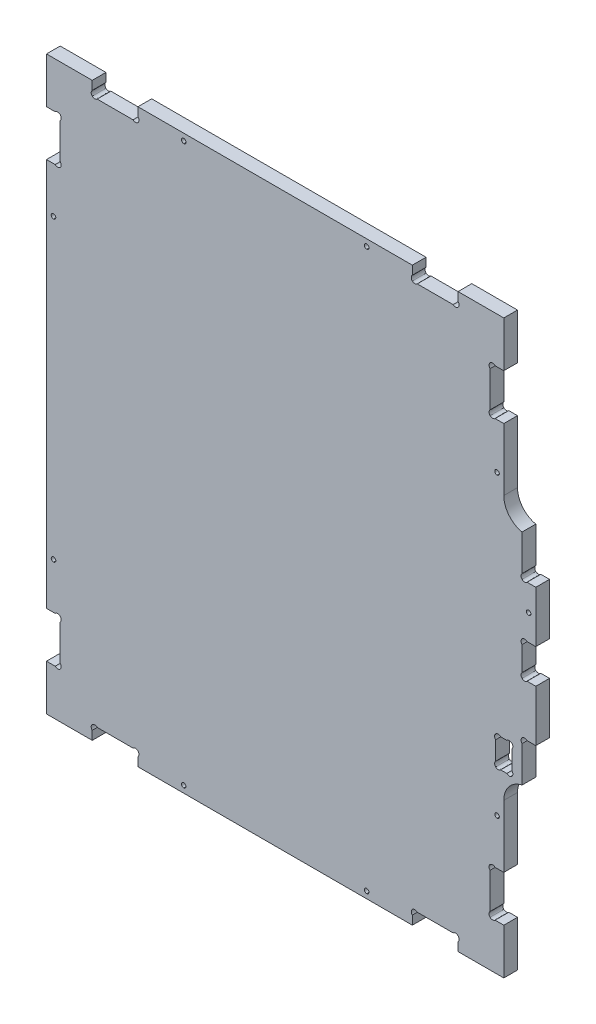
ISO-10303-21;
HEADER;
FILE_DESCRIPTION(('STEP AP214'),'2;1');
FILE_NAME('part.step','',(''),(''),'','','');
FILE_SCHEMA(('AUTOMOTIVE_DESIGN { 1 0 10303 214 1 1 1 1 }'));
ENDSEC;
DATA;
#1=APPLICATION_CONTEXT('core data for automotive mechanical design processes');
#2=APPLICATION_PROTOCOL_DEFINITION('international standard','automotive_design',2000,#1);
#3=PRODUCT_CONTEXT('',#1,'mechanical');
#4=PRODUCT('Part','Part','',(#3));
#5=PRODUCT_RELATED_PRODUCT_CATEGORY('part','',(#4));
#6=PRODUCT_DEFINITION_FORMATION('','',#4);
#7=PRODUCT_DEFINITION_CONTEXT('part definition',#1,'design');
#8=PRODUCT_DEFINITION('design','',#6,#7);
#9=PRODUCT_DEFINITION_SHAPE('','',#8);
#10=(LENGTH_UNIT() NAMED_UNIT(*) SI_UNIT(.MILLI.,.METRE.));
#11=(NAMED_UNIT(*) PLANE_ANGLE_UNIT() SI_UNIT($,.RADIAN.));
#12=(NAMED_UNIT(*) SI_UNIT($,.STERADIAN.) SOLID_ANGLE_UNIT());
#13=UNCERTAINTY_MEASURE_WITH_UNIT(LENGTH_MEASURE(1.E-05),#10,'distance_accuracy_value','');
#14=(GEOMETRIC_REPRESENTATION_CONTEXT(3) GLOBAL_UNCERTAINTY_ASSIGNED_CONTEXT((#13)) GLOBAL_UNIT_ASSIGNED_CONTEXT((#10,
#11,#12)) REPRESENTATION_CONTEXT('',''));
#15=CARTESIAN_POINT('',(0.,0.,0.));
#16=DIRECTION('',(0.,0.,1.));
#17=DIRECTION('',(1.,0.,0.));
#18=AXIS2_PLACEMENT_3D('',#15,#16,#17);
#19=CARTESIAN_POINT('',(2420.96296140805,481.331257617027,6.));
#20=CARTESIAN_POINT('',(2420.41067665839,481.331257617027,6.));
#21=CARTESIAN_POINT('',(2419.9629614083,481.778972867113,6.));
#22=CARTESIAN_POINT('',(2419.9629614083,482.88354236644,6.));
#23=CARTESIAN_POINT('',(2420.41067665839,483.331257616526,6.));
#24=CARTESIAN_POINT('',(2420.96296140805,483.331257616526,6.));
#25=B_SPLINE_CURVE_WITH_KNOTS('',3,(#19,#20,#21,#22,#23,#24),.UNSPECIFIED.,.F.,.F.,(4,2,4),(2.,
3.,4.),.UNSPECIFIED.);
#26=DIRECTION('',(0.,0.,-1.));
#27=VECTOR('',#26,1.);
#28=SURFACE_OF_LINEAR_EXTRUSION('',#25,#27);
#29=CARTESIAN_POINT('',(2420.96296140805,481.331257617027,0.));
#30=CARTESIAN_POINT('',(2420.41067665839,481.331257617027,0.));
#31=CARTESIAN_POINT('',(2419.9629614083,481.778972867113,0.));
#32=CARTESIAN_POINT('',(2419.9629614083,482.88354236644,0.));
#33=CARTESIAN_POINT('',(2420.41067665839,483.331257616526,0.));
#34=CARTESIAN_POINT('',(2420.96296140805,483.331257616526,0.));
#35=B_SPLINE_CURVE_WITH_KNOTS('',3,(#29,#30,#31,#32,#33,#34),.UNSPECIFIED.,.F.,.F.,(4,2,4),(2.,
3.,4.),.UNSPECIFIED.);
#36=CARTESIAN_POINT('',(2420.96296140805,481.331257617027,0.));
#37=VERTEX_POINT('',#36);
#38=CARTESIAN_POINT('',(2420.96296140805,483.331257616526,0.));
#39=VERTEX_POINT('',#38);
#40=EDGE_CURVE('E1879',#37,#39,#35,.T.);
#41=ORIENTED_EDGE('',*,*,#40,.T.);
#42=DIRECTION('',(0.,0.,-1.));
#43=VECTOR('',#42,1.);
#44=CARTESIAN_POINT('',(2420.96296140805,483.331257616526,6.));
#45=LINE('',#44,#43);
#46=CARTESIAN_POINT('',(2420.96296140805,483.331257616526,6.));
#47=VERTEX_POINT('',#46);
#48=EDGE_CURVE('E11',#47,#39,#45,.T.);
#49=ORIENTED_EDGE('',*,*,#48,.F.);
#50=CARTESIAN_POINT('',(2420.96296140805,481.331257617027,6.));
#51=VERTEX_POINT('',#50);
#52=EDGE_CURVE('E756',#51,#47,#25,.T.);
#53=ORIENTED_EDGE('',*,*,#52,.F.);
#54=DIRECTION('',(0.,0.,-1.));
#55=VECTOR('',#54,1.);
#56=CARTESIAN_POINT('',(2420.96296140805,481.331257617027,6.));
#57=LINE('',#56,#55);
#58=EDGE_CURVE('E48',#51,#37,#57,.T.);
#59=ORIENTED_EDGE('',*,*,#58,.T.);
#60=EDGE_LOOP('',(#41,#49,#53,#59));
#61=FACE_BOUND('',#60,.T.);
#62=ADVANCED_FACE('F37',(#61),#28,.F.);
#63=CARTESIAN_POINT('',(2340.95296142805,481.331257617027,6.));
#64=CARTESIAN_POINT('',(2340.40067667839,481.331257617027,6.));
#65=CARTESIAN_POINT('',(2339.9529614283,481.778972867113,6.));
#66=CARTESIAN_POINT('',(2339.9529614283,482.88354236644,6.));
#67=CARTESIAN_POINT('',(2340.40067667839,483.331257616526,6.));
#68=CARTESIAN_POINT('',(2340.95296142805,483.331257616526,6.));
#69=B_SPLINE_CURVE_WITH_KNOTS('',3,(#63,#64,#65,#66,#67,#68),.UNSPECIFIED.,.F.,.F.,(4,2,4),(2.,
3.,4.),.UNSPECIFIED.);
#70=DIRECTION('',(0.,0.,-1.));
#71=VECTOR('',#70,1.);
#72=SURFACE_OF_LINEAR_EXTRUSION('',#69,#71);
#73=CARTESIAN_POINT('',(2340.95296142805,481.331257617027,0.));
#74=CARTESIAN_POINT('',(2340.40067667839,481.331257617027,0.));
#75=CARTESIAN_POINT('',(2339.9529614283,481.778972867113,0.));
#76=CARTESIAN_POINT('',(2339.9529614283,482.88354236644,0.));
#77=CARTESIAN_POINT('',(2340.40067667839,483.331257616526,0.));
#78=CARTESIAN_POINT('',(2340.95296142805,483.331257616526,0.));
#79=B_SPLINE_CURVE_WITH_KNOTS('',3,(#73,#74,#75,#76,#77,#78),.UNSPECIFIED.,.F.,.F.,(4,2,4),(2.,
3.,4.),.UNSPECIFIED.);
#80=CARTESIAN_POINT('',(2340.95296142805,481.331257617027,0.));
#81=VERTEX_POINT('',#80);
#82=CARTESIAN_POINT('',(2340.95296142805,483.331257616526,0.));
#83=VERTEX_POINT('',#82);
#84=EDGE_CURVE('E1866',#81,#83,#79,.T.);
#85=ORIENTED_EDGE('',*,*,#84,.T.);
#86=DIRECTION('',(0.,0.,-1.));
#87=VECTOR('',#86,1.);
#88=CARTESIAN_POINT('',(2340.95296142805,483.331257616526,6.));
#89=LINE('',#88,#87);
#90=CARTESIAN_POINT('',(2340.95296142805,483.331257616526,6.));
#91=VERTEX_POINT('',#90);
#92=EDGE_CURVE('E765',#91,#83,#89,.T.);
#93=ORIENTED_EDGE('',*,*,#92,.F.);
#94=CARTESIAN_POINT('',(2340.95296142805,481.331257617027,6.));
#95=VERTEX_POINT('',#94);
#96=EDGE_CURVE('E752',#95,#91,#69,.T.);
#97=ORIENTED_EDGE('',*,*,#96,.F.);
#98=DIRECTION('',(0.,0.,-1.));
#99=VECTOR('',#98,1.);
#100=CARTESIAN_POINT('',(2340.95296142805,481.331257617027,6.));
#101=LINE('',#100,#99);
#102=EDGE_CURVE('E759',#95,#81,#101,.T.);
#103=ORIENTED_EDGE('',*,*,#102,.T.);
#104=EDGE_LOOP('',(#85,#93,#97,#103));
#105=FACE_BOUND('',#104,.T.);
#106=ADVANCED_FACE('F768',(#105),#72,.F.);
#107=CARTESIAN_POINT('',(2284.00874253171,424.302899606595,6.));
#108=CARTESIAN_POINT('',(2283.45645778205,424.302899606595,6.));
#109=CARTESIAN_POINT('',(2283.00874253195,424.750614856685,6.));
#110=CARTESIAN_POINT('',(2283.00874253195,425.855184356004,6.));
#111=CARTESIAN_POINT('',(2283.45645778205,426.302899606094,6.));
#112=CARTESIAN_POINT('',(2284.00874253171,426.302899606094,6.));
#113=B_SPLINE_CURVE_WITH_KNOTS('',3,(#107,#108,#109,#110,#111,#112),.UNSPECIFIED.,.F.,.F.,(4,2,
4),(2.,3.,4.),.UNSPECIFIED.);
#114=DIRECTION('',(0.,0.,-1.));
#115=VECTOR('',#114,1.);
#116=SURFACE_OF_LINEAR_EXTRUSION('',#113,#115);
#117=CARTESIAN_POINT('',(2284.00874253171,424.302899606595,0.));
#118=CARTESIAN_POINT('',(2283.45645778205,424.302899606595,0.));
#119=CARTESIAN_POINT('',(2283.00874253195,424.750614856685,0.));
#120=CARTESIAN_POINT('',(2283.00874253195,425.855184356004,0.));
#121=CARTESIAN_POINT('',(2283.45645778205,426.302899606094,0.));
#122=CARTESIAN_POINT('',(2284.00874253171,426.302899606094,0.));
#123=B_SPLINE_CURVE_WITH_KNOTS('',3,(#117,#118,#119,#120,#121,#122),.UNSPECIFIED.,.F.,.F.,(4,2,
4),(2.,3.,4.),.UNSPECIFIED.);
#124=CARTESIAN_POINT('',(2284.00874253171,424.302899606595,0.));
#125=VERTEX_POINT('',#124);
#126=CARTESIAN_POINT('',(2284.00874253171,426.302899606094,0.));
#127=VERTEX_POINT('',#126);
#128=EDGE_CURVE('E1851',#125,#127,#123,.T.);
#129=ORIENTED_EDGE('',*,*,#128,.T.);
#130=DIRECTION('',(0.,0.,-1.));
#131=VECTOR('',#130,1.);
#132=CARTESIAN_POINT('',(2284.00874253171,426.302899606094,6.));
#133=LINE('',#132,#131);
#134=CARTESIAN_POINT('',(2284.00874253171,426.302899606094,6.));
#135=VERTEX_POINT('',#134);
#136=EDGE_CURVE('E766',#135,#127,#133,.T.);
#137=ORIENTED_EDGE('',*,*,#136,.F.);
#138=CARTESIAN_POINT('',(2284.00874253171,424.302899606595,6.));
#139=VERTEX_POINT('',#138);
#140=EDGE_CURVE('E771',#139,#135,#113,.T.);
#141=ORIENTED_EDGE('',*,*,#140,.F.);
#142=DIRECTION('',(0.,0.,-1.));
#143=VECTOR('',#142,1.);
#144=CARTESIAN_POINT('',(2284.00874253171,424.302899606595,6.));
#145=LINE('',#144,#143);
#146=EDGE_CURVE('E1899',#139,#125,#145,.T.);
#147=ORIENTED_EDGE('',*,*,#146,.T.);
#148=EDGE_LOOP('',(#129,#137,#141,#147));
#149=FACE_BOUND('',#148,.T.);
#150=ADVANCED_FACE('F791',(#149),#116,.F.);
#151=CARTESIAN_POINT('',(2284.00874253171,294.334899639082,6.));
#152=CARTESIAN_POINT('',(2283.45645778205,294.334899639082,6.));
#153=CARTESIAN_POINT('',(2283.00874253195,294.782614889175,6.));
#154=CARTESIAN_POINT('',(2283.00874253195,295.887184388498,6.));
#155=CARTESIAN_POINT('',(2283.45645778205,296.334899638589,6.));
#156=CARTESIAN_POINT('',(2284.00874253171,296.334899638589,6.));
#157=B_SPLINE_CURVE_WITH_KNOTS('',3,(#151,#152,#153,#154,#155,#156),.UNSPECIFIED.,.F.,.F.,(4,2,
4),(2.,3.,4.),.UNSPECIFIED.);
#158=DIRECTION('',(0.,0.,-1.));
#159=VECTOR('',#158,1.);
#160=SURFACE_OF_LINEAR_EXTRUSION('',#157,#159);
#161=CARTESIAN_POINT('',(2284.00874253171,294.334899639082,0.));
#162=CARTESIAN_POINT('',(2283.45645778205,294.334899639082,0.));
#163=CARTESIAN_POINT('',(2283.00874253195,294.782614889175,0.));
#164=CARTESIAN_POINT('',(2283.00874253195,295.887184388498,0.));
#165=CARTESIAN_POINT('',(2283.45645778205,296.334899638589,0.));
#166=CARTESIAN_POINT('',(2284.00874253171,296.334899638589,0.));
#167=B_SPLINE_CURVE_WITH_KNOTS('',3,(#161,#162,#163,#164,#165,#166),.UNSPECIFIED.,.F.,.F.,(4,2,
4),(2.,3.,4.),.UNSPECIFIED.);
#168=CARTESIAN_POINT('',(2284.00874253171,294.334899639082,0.));
#169=VERTEX_POINT('',#168);
#170=CARTESIAN_POINT('',(2284.00874253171,296.334899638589,0.));
#171=VERTEX_POINT('',#170);
#172=EDGE_CURVE('E1836',#169,#171,#167,.T.);
#173=ORIENTED_EDGE('',*,*,#172,.T.);
#174=DIRECTION('',(0.,0.,-1.));
#175=VECTOR('',#174,1.);
#176=CARTESIAN_POINT('',(2284.00874253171,296.334899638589,6.));
#177=LINE('',#176,#175);
#178=CARTESIAN_POINT('',(2284.00874253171,296.334899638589,6.));
#179=VERTEX_POINT('',#178);
#180=EDGE_CURVE('E1902',#179,#171,#177,.T.);
#181=ORIENTED_EDGE('',*,*,#180,.F.);
#182=CARTESIAN_POINT('',(2284.00874253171,294.334899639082,6.));
#183=VERTEX_POINT('',#182);
#184=EDGE_CURVE('E816',#183,#179,#157,.T.);
#185=ORIENTED_EDGE('',*,*,#184,.F.);
#186=DIRECTION('',(0.,0.,-1.));
#187=VECTOR('',#186,1.);
#188=CARTESIAN_POINT('',(2284.00874253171,294.334899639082,6.));
#189=LINE('',#188,#187);
#190=EDGE_CURVE('E1905',#183,#169,#189,.T.);
#191=ORIENTED_EDGE('',*,*,#190,.T.);
#192=EDGE_LOOP('',(#173,#181,#185,#191));
#193=FACE_BOUND('',#192,.T.);
#194=ADVANCED_FACE('F800',(#193),#160,.F.);
#195=CARTESIAN_POINT('',(2420.96296140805,237.255228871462,6.));
#196=CARTESIAN_POINT('',(2420.41067665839,237.255228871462,6.));
#197=CARTESIAN_POINT('',(2419.9629614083,237.702944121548,6.));
#198=CARTESIAN_POINT('',(2419.9629614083,238.807513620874,6.));
#199=CARTESIAN_POINT('',(2420.41067665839,239.255228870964,6.));
#200=CARTESIAN_POINT('',(2420.96296140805,239.255228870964,6.));
#201=B_SPLINE_CURVE_WITH_KNOTS('',3,(#195,#196,#197,#198,#199,#200),.UNSPECIFIED.,.F.,.F.,(4,2,
4),(2.,3.,4.),.UNSPECIFIED.);
#202=DIRECTION('',(0.,0.,-1.));
#203=VECTOR('',#202,1.);
#204=SURFACE_OF_LINEAR_EXTRUSION('',#201,#203);
#205=CARTESIAN_POINT('',(2420.96296140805,237.255228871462,0.));
#206=CARTESIAN_POINT('',(2420.41067665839,237.255228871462,0.));
#207=CARTESIAN_POINT('',(2419.9629614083,237.702944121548,0.));
#208=CARTESIAN_POINT('',(2419.9629614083,238.807513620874,0.));
#209=CARTESIAN_POINT('',(2420.41067665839,239.255228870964,0.));
#210=CARTESIAN_POINT('',(2420.96296140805,239.255228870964,0.));
#211=B_SPLINE_CURVE_WITH_KNOTS('',3,(#205,#206,#207,#208,#209,#210),.UNSPECIFIED.,.F.,.F.,(4,2,
4),(2.,3.,4.),.UNSPECIFIED.);
#212=CARTESIAN_POINT('',(2420.96296140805,237.255228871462,0.));
#213=VERTEX_POINT('',#212);
#214=CARTESIAN_POINT('',(2420.96296140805,239.255228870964,0.));
#215=VERTEX_POINT('',#214);
#216=EDGE_CURVE('E1821',#213,#215,#211,.T.);
#217=ORIENTED_EDGE('',*,*,#216,.T.);
#218=DIRECTION('',(0.,0.,-1.));
#219=VECTOR('',#218,1.);
#220=CARTESIAN_POINT('',(2420.96296140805,239.255228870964,6.));
#221=LINE('',#220,#219);
#222=CARTESIAN_POINT('',(2420.96296140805,239.255228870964,6.));
#223=VERTEX_POINT('',#222);
#224=EDGE_CURVE('E1908',#223,#215,#221,.T.);
#225=ORIENTED_EDGE('',*,*,#224,.F.);
#226=CARTESIAN_POINT('',(2420.96296140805,237.255228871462,6.));
#227=VERTEX_POINT('',#226);
#228=EDGE_CURVE('E848',#227,#223,#201,.T.);
#229=ORIENTED_EDGE('',*,*,#228,.F.);
#230=DIRECTION('',(0.,0.,-1.));
#231=VECTOR('',#230,1.);
#232=CARTESIAN_POINT('',(2420.96296140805,237.255228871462,6.));
#233=LINE('',#232,#231);
#234=EDGE_CURVE('E1911',#227,#213,#233,.T.);
#235=ORIENTED_EDGE('',*,*,#234,.T.);
#236=EDGE_LOOP('',(#217,#225,#229,#235));
#237=FACE_BOUND('',#236,.T.);
#238=ADVANCED_FACE('F835',(#237),#204,.F.);
#239=CARTESIAN_POINT('',(2340.95296142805,237.255228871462,6.));
#240=CARTESIAN_POINT('',(2340.40067667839,237.255228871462,6.));
#241=CARTESIAN_POINT('',(2339.9529614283,237.702944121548,6.));
#242=CARTESIAN_POINT('',(2339.9529614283,238.807513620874,6.));
#243=CARTESIAN_POINT('',(2340.40067667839,239.255228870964,6.));
#244=CARTESIAN_POINT('',(2340.95296142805,239.255228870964,6.));
#245=B_SPLINE_CURVE_WITH_KNOTS('',3,(#239,#240,#241,#242,#243,#244),.UNSPECIFIED.,.F.,.F.,(4,2,
4),(2.,3.,4.),.UNSPECIFIED.);
#246=DIRECTION('',(0.,0.,-1.));
#247=VECTOR('',#246,1.);
#248=SURFACE_OF_LINEAR_EXTRUSION('',#245,#247);
#249=CARTESIAN_POINT('',(2340.95296142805,237.255228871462,0.));
#250=CARTESIAN_POINT('',(2340.40067667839,237.255228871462,0.));
#251=CARTESIAN_POINT('',(2339.9529614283,237.702944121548,0.));
#252=CARTESIAN_POINT('',(2339.9529614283,238.807513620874,0.));
#253=CARTESIAN_POINT('',(2340.40067667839,239.255228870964,0.));
#254=CARTESIAN_POINT('',(2340.95296142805,239.255228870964,0.));
#255=B_SPLINE_CURVE_WITH_KNOTS('',3,(#249,#250,#251,#252,#253,#254),.UNSPECIFIED.,.F.,.F.,(4,2,
4),(2.,3.,4.),.UNSPECIFIED.);
#256=CARTESIAN_POINT('',(2340.95296142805,237.255228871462,0.));
#257=VERTEX_POINT('',#256);
#258=CARTESIAN_POINT('',(2340.95296142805,239.255228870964,0.));
#259=VERTEX_POINT('',#258);
#260=EDGE_CURVE('E1806',#257,#259,#255,.T.);
#261=ORIENTED_EDGE('',*,*,#260,.T.);
#262=DIRECTION('',(0.,0.,-1.));
#263=VECTOR('',#262,1.);
#264=CARTESIAN_POINT('',(2340.95296142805,239.255228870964,6.));
#265=LINE('',#264,#263);
#266=CARTESIAN_POINT('',(2340.95296142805,239.255228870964,6.));
#267=VERTEX_POINT('',#266);
#268=EDGE_CURVE('E1914',#267,#259,#265,.T.);
#269=ORIENTED_EDGE('',*,*,#268,.F.);
#270=CARTESIAN_POINT('',(2340.95296142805,237.255228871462,6.));
#271=VERTEX_POINT('',#270);
#272=EDGE_CURVE('E861',#271,#267,#245,.T.);
#273=ORIENTED_EDGE('',*,*,#272,.F.);
#274=DIRECTION('',(0.,0.,-1.));
#275=VECTOR('',#274,1.);
#276=CARTESIAN_POINT('',(2340.95296142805,237.255228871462,6.));
#277=LINE('',#276,#275);
#278=EDGE_CURVE('E1917',#271,#257,#277,.T.);
#279=ORIENTED_EDGE('',*,*,#278,.T.);
#280=EDGE_LOOP('',(#261,#269,#273,#279));
#281=FACE_BOUND('',#280,.T.);
#282=ADVANCED_FACE('F844',(#281),#248,.F.);
#283=CARTESIAN_POINT('',(2491.79400714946,378.036939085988,6.));
#284=CARTESIAN_POINT('',(2491.2417223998,378.036939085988,6.));
#285=CARTESIAN_POINT('',(2490.79400714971,378.484654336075,6.));
#286=CARTESIAN_POINT('',(2490.79400714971,379.589223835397,6.));
#287=CARTESIAN_POINT('',(2491.2417223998,380.036939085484,6.));
#288=CARTESIAN_POINT('',(2491.79400714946,380.036939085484,6.));
#289=B_SPLINE_CURVE_WITH_KNOTS('',3,(#283,#284,#285,#286,#287,#288),.UNSPECIFIED.,.F.,.F.,(4,2,
4),(2.,3.,4.),.UNSPECIFIED.);
#290=DIRECTION('',(0.,0.,-1.));
#291=VECTOR('',#290,1.);
#292=SURFACE_OF_LINEAR_EXTRUSION('',#289,#291);
#293=CARTESIAN_POINT('',(2491.79400714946,378.036939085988,0.));
#294=CARTESIAN_POINT('',(2491.2417223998,378.036939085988,0.));
#295=CARTESIAN_POINT('',(2490.79400714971,378.484654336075,0.));
#296=CARTESIAN_POINT('',(2490.79400714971,379.589223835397,0.));
#297=CARTESIAN_POINT('',(2491.2417223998,380.036939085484,0.));
#298=CARTESIAN_POINT('',(2491.79400714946,380.036939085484,0.));
#299=B_SPLINE_CURVE_WITH_KNOTS('',3,(#293,#294,#295,#296,#297,#298),.UNSPECIFIED.,.F.,.F.,(4,2,
4),(2.,3.,4.),.UNSPECIFIED.);
#300=CARTESIAN_POINT('',(2491.79400714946,378.036939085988,0.));
#301=VERTEX_POINT('',#300);
#302=CARTESIAN_POINT('',(2491.79400714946,380.036939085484,0.));
#303=VERTEX_POINT('',#302);
#304=EDGE_CURVE('E1791',#301,#303,#299,.T.);
#305=ORIENTED_EDGE('',*,*,#304,.T.);
#306=DIRECTION('',(0.,0.,-1.));
#307=VECTOR('',#306,1.);
#308=CARTESIAN_POINT('',(2491.79400714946,380.036939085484,6.));
#309=LINE('',#308,#307);
#310=CARTESIAN_POINT('',(2491.79400714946,380.036939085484,6.));
#311=VERTEX_POINT('',#310);
#312=EDGE_CURVE('E1920',#311,#303,#309,.T.);
#313=ORIENTED_EDGE('',*,*,#312,.F.);
#314=CARTESIAN_POINT('',(2491.79400714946,378.036939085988,6.));
#315=VERTEX_POINT('',#314);
#316=EDGE_CURVE('E893',#315,#311,#289,.T.);
#317=ORIENTED_EDGE('',*,*,#316,.F.);
#318=DIRECTION('',(0.,0.,-1.));
#319=VECTOR('',#318,1.);
#320=CARTESIAN_POINT('',(2491.79400714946,378.036939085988,6.));
#321=LINE('',#320,#319);
#322=EDGE_CURVE('E1923',#315,#301,#321,.T.);
#323=ORIENTED_EDGE('',*,*,#322,.T.);
#324=EDGE_LOOP('',(#305,#313,#317,#323));
#325=FACE_BOUND('',#324,.T.);
#326=ADVANCED_FACE('F880',(#325),#292,.F.);
#327=CARTESIAN_POINT('',(2477.99179502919,424.302899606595,6.));
#328=CARTESIAN_POINT('',(2477.43951027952,424.302899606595,6.));
#329=CARTESIAN_POINT('',(2476.99179502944,424.750614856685,6.));
#330=CARTESIAN_POINT('',(2476.99179502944,425.855184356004,6.));
#331=CARTESIAN_POINT('',(2477.43951027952,426.302899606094,6.));
#332=CARTESIAN_POINT('',(2477.99179502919,426.302899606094,6.));
#333=B_SPLINE_CURVE_WITH_KNOTS('',3,(#327,#328,#329,#330,#331,#332),.UNSPECIFIED.,.F.,.F.,(4,2,
4),(2.,3.,4.),.UNSPECIFIED.);
#334=DIRECTION('',(0.,0.,-1.));
#335=VECTOR('',#334,1.);
#336=SURFACE_OF_LINEAR_EXTRUSION('',#333,#335);
#337=CARTESIAN_POINT('',(2477.99179502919,424.302899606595,0.));
#338=CARTESIAN_POINT('',(2477.43951027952,424.302899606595,0.));
#339=CARTESIAN_POINT('',(2476.99179502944,424.750614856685,0.));
#340=CARTESIAN_POINT('',(2476.99179502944,425.855184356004,0.));
#341=CARTESIAN_POINT('',(2477.43951027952,426.302899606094,0.));
#342=CARTESIAN_POINT('',(2477.99179502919,426.302899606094,0.));
#343=B_SPLINE_CURVE_WITH_KNOTS('',3,(#337,#338,#339,#340,#341,#342),.UNSPECIFIED.,.F.,.F.,(4,2,
4),(2.,3.,4.),.UNSPECIFIED.);
#344=CARTESIAN_POINT('',(2477.99179502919,424.302899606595,0.));
#345=VERTEX_POINT('',#344);
#346=CARTESIAN_POINT('',(2477.99179502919,426.302899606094,0.));
#347=VERTEX_POINT('',#346);
#348=EDGE_CURVE('E1776',#345,#347,#343,.T.);
#349=ORIENTED_EDGE('',*,*,#348,.T.);
#350=DIRECTION('',(0.,0.,-1.));
#351=VECTOR('',#350,1.);
#352=CARTESIAN_POINT('',(2477.99179502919,426.302899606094,6.));
#353=LINE('',#352,#351);
#354=CARTESIAN_POINT('',(2477.99179502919,426.302899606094,6.));
#355=VERTEX_POINT('',#354);
#356=EDGE_CURVE('E1926',#355,#347,#353,.T.);
#357=ORIENTED_EDGE('',*,*,#356,.F.);
#358=CARTESIAN_POINT('',(2477.99179502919,424.302899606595,6.));
#359=VERTEX_POINT('',#358);
#360=EDGE_CURVE('E906',#359,#355,#333,.T.);
#361=ORIENTED_EDGE('',*,*,#360,.F.);
#362=DIRECTION('',(0.,0.,-1.));
#363=VECTOR('',#362,1.);
#364=CARTESIAN_POINT('',(2477.99179502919,424.302899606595,6.));
#365=LINE('',#364,#363);
#366=EDGE_CURVE('E1929',#359,#345,#365,.T.);
#367=ORIENTED_EDGE('',*,*,#366,.T.);
#368=EDGE_LOOP('',(#349,#357,#361,#367));
#369=FACE_BOUND('',#368,.T.);
#370=ADVANCED_FACE('F889',(#369),#336,.F.);
#371=CARTESIAN_POINT('',(2477.99179502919,294.334899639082,6.));
#372=CARTESIAN_POINT('',(2477.43951027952,294.334899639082,6.));
#373=CARTESIAN_POINT('',(2476.99179502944,294.782614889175,6.));
#374=CARTESIAN_POINT('',(2476.99179502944,295.887184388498,6.));
#375=CARTESIAN_POINT('',(2477.43951027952,296.334899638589,6.));
#376=CARTESIAN_POINT('',(2477.99179502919,296.334899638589,6.));
#377=B_SPLINE_CURVE_WITH_KNOTS('',3,(#371,#372,#373,#374,#375,#376),.UNSPECIFIED.,.F.,.F.,(4,2,
4),(2.,3.,4.),.UNSPECIFIED.);
#378=DIRECTION('',(0.,0.,-1.));
#379=VECTOR('',#378,1.);
#380=SURFACE_OF_LINEAR_EXTRUSION('',#377,#379);
#381=CARTESIAN_POINT('',(2477.99179502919,294.334899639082,0.));
#382=CARTESIAN_POINT('',(2477.43951027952,294.334899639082,0.));
#383=CARTESIAN_POINT('',(2476.99179502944,294.782614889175,0.));
#384=CARTESIAN_POINT('',(2476.99179502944,295.887184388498,0.));
#385=CARTESIAN_POINT('',(2477.43951027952,296.334899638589,0.));
#386=CARTESIAN_POINT('',(2477.99179502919,296.334899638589,0.));
#387=B_SPLINE_CURVE_WITH_KNOTS('',3,(#381,#382,#383,#384,#385,#386),.UNSPECIFIED.,.F.,.F.,(4,2,
4),(2.,3.,4.),.UNSPECIFIED.);
#388=CARTESIAN_POINT('',(2477.99179502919,294.334899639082,0.));
#389=VERTEX_POINT('',#388);
#390=CARTESIAN_POINT('',(2477.99179502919,296.334899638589,0.));
#391=VERTEX_POINT('',#390);
#392=EDGE_CURVE('E1764',#389,#391,#387,.T.);
#393=ORIENTED_EDGE('',*,*,#392,.T.);
#394=DIRECTION('',(0.,0.,-1.));
#395=VECTOR('',#394,1.);
#396=CARTESIAN_POINT('',(2477.99179502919,296.334899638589,6.));
#397=LINE('',#396,#395);
#398=CARTESIAN_POINT('',(2477.99179502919,296.334899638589,6.));
#399=VERTEX_POINT('',#398);
#400=EDGE_CURVE('E1932',#399,#391,#397,.T.);
#401=ORIENTED_EDGE('',*,*,#400,.F.);
#402=CARTESIAN_POINT('',(2477.99179502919,294.334899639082,6.));
#403=VERTEX_POINT('',#402);
#404=EDGE_CURVE('E937',#403,#399,#377,.T.);
#405=ORIENTED_EDGE('',*,*,#404,.F.);
#406=DIRECTION('',(0.,0.,-1.));
#407=VECTOR('',#406,1.);
#408=CARTESIAN_POINT('',(2477.99179502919,294.334899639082,6.));
#409=LINE('',#408,#407);
#410=EDGE_CURVE('E1041',#403,#389,#409,.T.);
#411=ORIENTED_EDGE('',*,*,#410,.T.);
#412=EDGE_LOOP('',(#393,#401,#405,#411));
#413=FACE_BOUND('',#412,.T.);
#414=ADVANCED_FACE('F925',(#413),#380,.F.);
#415=CARTESIAN_POINT('',(2477.38744618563,325.960972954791,6.));
#416=CARTESIAN_POINT('',(2476.78213353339,325.355660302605,6.));
#417=CARTESIAN_POINT('',(2476.78213353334,324.374254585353,6.));
#418=CARTESIAN_POINT('',(2477.38744618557,323.768941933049,6.));
#419=B_SPLINE_CURVE_WITH_KNOTS('',3,(#415,#416,#417,#418),.UNSPECIFIED.,.F.,.F.,(4,4),(11.,12.),.UNSPECIFIED.);
#420=DIRECTION('',(0.,0.,-1.));
#421=VECTOR('',#420,1.);
#422=SURFACE_OF_LINEAR_EXTRUSION('',#419,#421);
#423=CARTESIAN_POINT('',(2477.38744618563,325.960972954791,0.));
#424=CARTESIAN_POINT('',(2476.78213353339,325.355660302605,0.));
#425=CARTESIAN_POINT('',(2476.78213353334,324.374254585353,0.));
#426=CARTESIAN_POINT('',(2477.38744618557,323.768941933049,0.));
#427=B_SPLINE_CURVE_WITH_KNOTS('',3,(#423,#424,#425,#426),.UNSPECIFIED.,.F.,.F.,(4,4),(11.,12.),.UNSPECIFIED.);
#428=CARTESIAN_POINT('',(2477.38744618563,325.960972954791,0.));
#429=VERTEX_POINT('',#428);
#430=CARTESIAN_POINT('',(2477.38744618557,323.768941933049,0.));
#431=VERTEX_POINT('',#430);
#432=EDGE_CURVE('E1688',#429,#431,#427,.T.);
#433=ORIENTED_EDGE('',*,*,#432,.F.);
#434=DIRECTION('',(0.,0.,-1.));
#435=VECTOR('',#434,1.);
#436=CARTESIAN_POINT('',(2477.38744618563,325.960972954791,6.));
#437=LINE('',#436,#435);
#438=CARTESIAN_POINT('',(2477.38744618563,325.960972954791,6.));
#439=VERTEX_POINT('',#438);
#440=EDGE_CURVE('E1039',#439,#429,#437,.T.);
#441=ORIENTED_EDGE('',*,*,#440,.F.);
#442=CARTESIAN_POINT('',(2477.38744618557,323.768941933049,6.));
#443=VERTEX_POINT('',#442);
#444=EDGE_CURVE('E3378',#439,#443,#419,.T.);
#445=ORIENTED_EDGE('',*,*,#444,.T.);
#446=DIRECTION('',(0.,0.,-1.));
#447=VECTOR('',#446,1.);
#448=CARTESIAN_POINT('',(2477.38744618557,323.768941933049,6.));
#449=LINE('',#448,#447);
#450=EDGE_CURVE('E1018',#443,#431,#449,.T.);
#451=ORIENTED_EDGE('',*,*,#450,.T.);
#452=EDGE_LOOP('',(#433,#441,#445,#451));
#453=FACE_BOUND('',#452,.T.);
#454=ADVANCED_FACE('F934',(#453),#422,.T.);
#455=CARTESIAN_POINT('',(2479.5794772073,325.960972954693,6.));
#456=CARTESIAN_POINT('',(2478.97416455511,326.566285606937,6.));
#457=CARTESIAN_POINT('',(2477.99275883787,326.566285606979,6.));
#458=CARTESIAN_POINT('',(2477.38744618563,325.960972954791,6.));
#459=B_SPLINE_CURVE_WITH_KNOTS('',3,(#455,#456,#457,#458),.UNSPECIFIED.,.F.,.F.,(4,4),(10.,11.),.UNSPECIFIED.);
#460=DIRECTION('',(0.,0.,-1.));
#461=VECTOR('',#460,1.);
#462=SURFACE_OF_LINEAR_EXTRUSION('',#459,#461);
#463=CARTESIAN_POINT('',(2479.5794772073,325.960972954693,0.));
#464=CARTESIAN_POINT('',(2478.97416455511,326.566285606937,0.));
#465=CARTESIAN_POINT('',(2477.99275883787,326.566285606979,0.));
#466=CARTESIAN_POINT('',(2477.38744618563,325.960972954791,0.));
#467=B_SPLINE_CURVE_WITH_KNOTS('',3,(#463,#464,#465,#466),.UNSPECIFIED.,.F.,.F.,(4,4),(10.,11.),.UNSPECIFIED.);
#468=CARTESIAN_POINT('',(2479.5794772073,325.960972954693,0.));
#469=VERTEX_POINT('',#468);
#470=EDGE_CURVE('E1696',#469,#429,#467,.T.);
#471=ORIENTED_EDGE('',*,*,#470,.F.);
#472=DIRECTION('',(0.,0.,-1.));
#473=VECTOR('',#472,1.);
#474=CARTESIAN_POINT('',(2479.5794772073,325.960972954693,6.));
#475=LINE('',#474,#473);
#476=CARTESIAN_POINT('',(2479.5794772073,325.960972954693,6.));
#477=VERTEX_POINT('',#476);
#478=EDGE_CURVE('E1037',#477,#469,#475,.T.);
#479=ORIENTED_EDGE('',*,*,#478,.F.);
#480=EDGE_CURVE('E3386',#477,#439,#459,.T.);
#481=ORIENTED_EDGE('',*,*,#480,.T.);
#482=ORIENTED_EDGE('',*,*,#440,.T.);
#483=EDGE_LOOP('',(#471,#479,#481,#482));
#484=FACE_BOUND('',#483,.T.);
#485=ADVANCED_FACE('F2110',(#484),#462,.T.);
#486=CARTESIAN_POINT('',(0.,325.960972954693,6.));
#487=DIRECTION('',(0.,-1.,0.));
#488=DIRECTION('',(0.,0.,-1.));
#489=AXIS2_PLACEMENT_3D('',#486,#487,#488);
#490=PLANE('',#489);
#491=DIRECTION('',(-1.,0.,0.));
#492=VECTOR('',#491,1.);
#493=CARTESIAN_POINT('',(0.,325.960972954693,0.));
#494=LINE('',#493,#492);
#495=CARTESIAN_POINT('',(2482.25374849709,325.960972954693,0.));
#496=VERTEX_POINT('',#495);
#497=EDGE_CURVE('E1704',#496,#469,#494,.T.);
#498=ORIENTED_EDGE('',*,*,#497,.F.);
#499=DIRECTION('',(0.,0.,-1.));
#500=VECTOR('',#499,1.);
#501=CARTESIAN_POINT('',(2482.25374849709,325.960972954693,6.));
#502=LINE('',#501,#500);
#503=CARTESIAN_POINT('',(2482.25374849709,325.960972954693,6.));
#504=VERTEX_POINT('',#503);
#505=EDGE_CURVE('E1035',#504,#496,#502,.T.);
#506=ORIENTED_EDGE('',*,*,#505,.F.);
#507=DIRECTION('',(-1.,0.,0.));
#508=VECTOR('',#507,1.);
#509=CARTESIAN_POINT('',(0.,325.960972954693,6.));
#510=LINE('',#509,#508);
#511=EDGE_CURVE('E3392',#504,#477,#510,.T.);
#512=ORIENTED_EDGE('',*,*,#511,.T.);
#513=ORIENTED_EDGE('',*,*,#478,.T.);
#514=EDGE_LOOP('',(#498,#506,#512,#513));
#515=FACE_BOUND('',#514,.T.);
#516=ADVANCED_FACE('F2101',(#515),#490,.T.);
#517=CARTESIAN_POINT('',(2484.44577951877,325.960972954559,6.));
#518=CARTESIAN_POINT('',(2483.8404668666,326.566285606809,6.));
#519=CARTESIAN_POINT('',(2482.85906114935,326.566285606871,6.));
#520=CARTESIAN_POINT('',(2482.25374849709,325.960972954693,6.));
#521=B_SPLINE_CURVE_WITH_KNOTS('',3,(#517,#518,#519,#520),.UNSPECIFIED.,.F.,.F.,(4,4),(8.,9.),.UNSPECIFIED.);
#522=DIRECTION('',(0.,0.,-1.));
#523=VECTOR('',#522,1.);
#524=SURFACE_OF_LINEAR_EXTRUSION('',#521,#523);
#525=CARTESIAN_POINT('',(2484.44577951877,325.960972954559,0.));
#526=CARTESIAN_POINT('',(2483.8404668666,326.566285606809,0.));
#527=CARTESIAN_POINT('',(2482.85906114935,326.566285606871,0.));
#528=CARTESIAN_POINT('',(2482.25374849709,325.960972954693,0.));
#529=B_SPLINE_CURVE_WITH_KNOTS('',3,(#525,#526,#527,#528),.UNSPECIFIED.,.F.,.F.,(4,4),(8.,9.),.UNSPECIFIED.);
#530=CARTESIAN_POINT('',(2484.44577951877,325.960972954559,0.));
#531=VERTEX_POINT('',#530);
#532=EDGE_CURVE('E1710',#531,#496,#529,.T.);
#533=ORIENTED_EDGE('',*,*,#532,.F.);
#534=DIRECTION('',(0.,0.,-1.));
#535=VECTOR('',#534,1.);
#536=CARTESIAN_POINT('',(2484.44577951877,325.960972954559,6.));
#537=LINE('',#536,#535);
#538=CARTESIAN_POINT('',(2484.44577951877,325.960972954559,6.));
#539=VERTEX_POINT('',#538);
#540=EDGE_CURVE('E1033',#539,#531,#537,.T.);
#541=ORIENTED_EDGE('',*,*,#540,.F.);
#542=EDGE_CURVE('E3398',#539,#504,#521,.T.);
#543=ORIENTED_EDGE('',*,*,#542,.T.);
#544=ORIENTED_EDGE('',*,*,#505,.T.);
#545=EDGE_LOOP('',(#533,#541,#543,#544));
#546=FACE_BOUND('',#545,.T.);
#547=ADVANCED_FACE('F2092',(#546),#524,.T.);
#548=CARTESIAN_POINT('',(2484.44577951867,323.768941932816,6.));
#549=CARTESIAN_POINT('',(2485.05109217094,324.374254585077,6.));
#550=CARTESIAN_POINT('',(2485.05109217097,325.355660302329,6.));
#551=CARTESIAN_POINT('',(2484.44577951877,325.960972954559,6.));
#552=B_SPLINE_CURVE_WITH_KNOTS('',3,(#548,#549,#550,#551),.UNSPECIFIED.,.F.,.F.,(4,4),(7.,8.),.UNSPECIFIED.);
#553=DIRECTION('',(0.,0.,-1.));
#554=VECTOR('',#553,1.);
#555=SURFACE_OF_LINEAR_EXTRUSION('',#552,#554);
#556=CARTESIAN_POINT('',(2484.44577951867,323.768941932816,0.));
#557=CARTESIAN_POINT('',(2485.05109217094,324.374254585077,0.));
#558=CARTESIAN_POINT('',(2485.05109217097,325.355660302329,0.));
#559=CARTESIAN_POINT('',(2484.44577951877,325.960972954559,0.));
#560=B_SPLINE_CURVE_WITH_KNOTS('',3,(#556,#557,#558,#559),.UNSPECIFIED.,.F.,.F.,(4,4),(7.,8.),.UNSPECIFIED.);
#561=CARTESIAN_POINT('',(2484.44577951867,323.768941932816,0.));
#562=VERTEX_POINT('',#561);
#563=EDGE_CURVE('E1715',#562,#531,#560,.T.);
#564=ORIENTED_EDGE('',*,*,#563,.F.);
#565=DIRECTION('',(0.,0.,-1.));
#566=VECTOR('',#565,1.);
#567=CARTESIAN_POINT('',(2484.44577951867,323.768941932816,6.));
#568=LINE('',#567,#566);
#569=CARTESIAN_POINT('',(2484.44577951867,323.768941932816,6.));
#570=VERTEX_POINT('',#569);
#571=EDGE_CURVE('E1031',#570,#562,#568,.T.);
#572=ORIENTED_EDGE('',*,*,#571,.F.);
#573=EDGE_CURVE('E3404',#570,#539,#552,.T.);
#574=ORIENTED_EDGE('',*,*,#573,.T.);
#575=ORIENTED_EDGE('',*,*,#540,.T.);
#576=EDGE_LOOP('',(#564,#572,#574,#575));
#577=FACE_BOUND('',#576,.T.);
#578=ADVANCED_FACE('F2084',(#577),#555,.T.);
#579=CARTESIAN_POINT('',(2484.44577951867,0.,6.));
#580=DIRECTION('',(-1.,0.,0.));
#581=DIRECTION('',(0.,0.,1.));
#582=AXIS2_PLACEMENT_3D('',#579,#580,#581);
#583=PLANE('',#582);
#584=DIRECTION('',(0.,1.,0.));
#585=VECTOR('',#584,1.);
#586=CARTESIAN_POINT('',(2484.44577951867,0.,0.));
#587=LINE('',#586,#585);
#588=CARTESIAN_POINT('',(2484.44577951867,315.625226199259,0.));
#589=VERTEX_POINT('',#588);
#590=EDGE_CURVE('E1723',#589,#562,#587,.T.);
#591=ORIENTED_EDGE('',*,*,#590,.F.);
#592=DIRECTION('',(0.,0.,-1.));
#593=VECTOR('',#592,1.);
#594=CARTESIAN_POINT('',(2484.44577951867,315.625226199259,6.));
#595=LINE('',#594,#593);
#596=CARTESIAN_POINT('',(2484.44577951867,315.625226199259,6.));
#597=VERTEX_POINT('',#596);
#598=EDGE_CURVE('E1029',#597,#589,#595,.T.);
#599=ORIENTED_EDGE('',*,*,#598,.F.);
#600=DIRECTION('',(0.,1.,0.));
#601=VECTOR('',#600,1.);
#602=CARTESIAN_POINT('',(2484.44577951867,0.,6.));
#603=LINE('',#602,#601);
#604=EDGE_CURVE('E3412',#597,#570,#603,.T.);
#605=ORIENTED_EDGE('',*,*,#604,.T.);
#606=ORIENTED_EDGE('',*,*,#571,.T.);
#607=EDGE_LOOP('',(#591,#599,#605,#606));
#608=FACE_BOUND('',#607,.T.);
#609=ADVANCED_FACE('F2076',(#608),#583,.T.);
#610=CARTESIAN_POINT('',(2484.44577951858,313.433195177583,6.));
#611=CARTESIAN_POINT('',(2485.05109217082,314.038507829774,6.));
#612=CARTESIAN_POINT('',(2485.05109217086,315.019913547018,6.));
#613=CARTESIAN_POINT('',(2484.44577951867,315.625226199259,6.));
#614=B_SPLINE_CURVE_WITH_KNOTS('',3,(#610,#611,#612,#613),.UNSPECIFIED.,.F.,.F.,(4,4),(5.,6.),.UNSPECIFIED.);
#615=DIRECTION('',(0.,0.,-1.));
#616=VECTOR('',#615,1.);
#617=SURFACE_OF_LINEAR_EXTRUSION('',#614,#616);
#618=CARTESIAN_POINT('',(2484.44577951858,313.433195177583,0.));
#619=CARTESIAN_POINT('',(2485.05109217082,314.038507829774,0.));
#620=CARTESIAN_POINT('',(2485.05109217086,315.019913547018,0.));
#621=CARTESIAN_POINT('',(2484.44577951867,315.625226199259,0.));
#622=B_SPLINE_CURVE_WITH_KNOTS('',3,(#618,#619,#620,#621),.UNSPECIFIED.,.F.,.F.,(4,4),(5.,6.),.UNSPECIFIED.);
#623=CARTESIAN_POINT('',(2484.44577951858,313.433195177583,0.));
#624=VERTEX_POINT('',#623);
#625=EDGE_CURVE('E1729',#624,#589,#622,.T.);
#626=ORIENTED_EDGE('',*,*,#625,.F.);
#627=DIRECTION('',(0.,0.,-1.));
#628=VECTOR('',#627,1.);
#629=CARTESIAN_POINT('',(2484.44577951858,313.433195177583,6.));
#630=LINE('',#629,#628);
#631=CARTESIAN_POINT('',(2484.44577951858,313.433195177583,6.));
#632=VERTEX_POINT('',#631);
#633=EDGE_CURVE('E1027',#632,#624,#630,.T.);
#634=ORIENTED_EDGE('',*,*,#633,.F.);
#635=EDGE_CURVE('E989',#632,#597,#614,.T.);
#636=ORIENTED_EDGE('',*,*,#635,.T.);
#637=ORIENTED_EDGE('',*,*,#598,.T.);
#638=EDGE_LOOP('',(#626,#634,#636,#637));
#639=FACE_BOUND('',#638,.T.);
#640=ADVANCED_FACE('F979',(#639),#617,.T.);
#641=CARTESIAN_POINT('',(2482.25374849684,313.43319517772,6.));
#642=CARTESIAN_POINT('',(2482.85906114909,312.827882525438,6.));
#643=CARTESIAN_POINT('',(2483.84046686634,312.827882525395,6.));
#644=CARTESIAN_POINT('',(2484.44577951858,313.433195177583,6.));
#645=B_SPLINE_CURVE_WITH_KNOTS('',3,(#641,#642,#643,#644),.UNSPECIFIED.,.F.,.F.,(4,4),(4.,5.),.UNSPECIFIED.);
#646=DIRECTION('',(0.,0.,-1.));
#647=VECTOR('',#646,1.);
#648=SURFACE_OF_LINEAR_EXTRUSION('',#645,#647);
#649=CARTESIAN_POINT('',(2482.25374849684,313.43319517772,0.));
#650=CARTESIAN_POINT('',(2482.85906114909,312.827882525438,0.));
#651=CARTESIAN_POINT('',(2483.84046686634,312.827882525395,0.));
#652=CARTESIAN_POINT('',(2484.44577951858,313.433195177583,0.));
#653=B_SPLINE_CURVE_WITH_KNOTS('',3,(#649,#650,#651,#652),.UNSPECIFIED.,.F.,.F.,(4,4),(4.,5.),.UNSPECIFIED.);
#654=CARTESIAN_POINT('',(2482.25374849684,313.43319517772,0.));
#655=VERTEX_POINT('',#654);
#656=EDGE_CURVE('E1734',#655,#624,#653,.T.);
#657=ORIENTED_EDGE('',*,*,#656,.F.);
#658=DIRECTION('',(0.,0.,-1.));
#659=VECTOR('',#658,1.);
#660=CARTESIAN_POINT('',(2482.25374849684,313.43319517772,6.));
#661=LINE('',#660,#659);
#662=CARTESIAN_POINT('',(2482.25374849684,313.43319517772,6.));
#663=VERTEX_POINT('',#662);
#664=EDGE_CURVE('E1025',#663,#655,#661,.T.);
#665=ORIENTED_EDGE('',*,*,#664,.F.);
#666=EDGE_CURVE('E983',#663,#632,#645,.T.);
#667=ORIENTED_EDGE('',*,*,#666,.T.);
#668=ORIENTED_EDGE('',*,*,#633,.T.);
#669=EDGE_LOOP('',(#657,#665,#667,#668));
#670=FACE_BOUND('',#669,.T.);
#671=ADVANCED_FACE('F974',(#670),#648,.T.);
#672=CARTESIAN_POINT('',(0.,313.43319517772,6.));
#673=DIRECTION('',(0.,1.,0.));
#674=DIRECTION('',(0.,0.,1.));
#675=AXIS2_PLACEMENT_3D('',#672,#673,#674);
#676=PLANE('',#675);
#677=DIRECTION('',(1.,0.,0.));
#678=VECTOR('',#677,1.);
#679=CARTESIAN_POINT('',(0.,313.43319517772,0.));
#680=LINE('',#679,#678);
#681=CARTESIAN_POINT('',(2479.57947720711,313.43319517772,0.));
#682=VERTEX_POINT('',#681);
#683=EDGE_CURVE('E1742',#682,#655,#680,.T.);
#684=ORIENTED_EDGE('',*,*,#683,.F.);
#685=DIRECTION('',(0.,0.,-1.));
#686=VECTOR('',#685,1.);
#687=CARTESIAN_POINT('',(2479.57947720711,313.43319517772,6.));
#688=LINE('',#687,#686);
#689=CARTESIAN_POINT('',(2479.57947720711,313.43319517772,6.));
#690=VERTEX_POINT('',#689);
#691=EDGE_CURVE('E1002',#690,#682,#688,.T.);
#692=ORIENTED_EDGE('',*,*,#691,.F.);
#693=DIRECTION('',(1.,0.,0.));
#694=VECTOR('',#693,1.);
#695=CARTESIAN_POINT('',(0.,313.43319517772,6.));
#696=LINE('',#695,#694);
#697=EDGE_CURVE('E988',#690,#663,#696,.T.);
#698=ORIENTED_EDGE('',*,*,#697,.T.);
#699=ORIENTED_EDGE('',*,*,#664,.T.);
#700=EDGE_LOOP('',(#684,#692,#698,#699));
#701=FACE_BOUND('',#700,.T.);
#702=ADVANCED_FACE('F970',(#701),#676,.T.);
#703=CARTESIAN_POINT('',(2477.38744618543,313.433195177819,6.));
#704=CARTESIAN_POINT('',(2477.99275883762,312.827882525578,6.));
#705=CARTESIAN_POINT('',(2478.97416455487,312.827882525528,6.));
#706=CARTESIAN_POINT('',(2479.57947720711,313.43319517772,6.));
#707=B_SPLINE_CURVE_WITH_KNOTS('',3,(#703,#704,#705,#706),.UNSPECIFIED.,.F.,.F.,(4,4),(2.,3.),.UNSPECIFIED.);
#708=DIRECTION('',(0.,0.,-1.));
#709=VECTOR('',#708,1.);
#710=SURFACE_OF_LINEAR_EXTRUSION('',#707,#709);
#711=CARTESIAN_POINT('',(2477.38744618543,313.433195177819,0.));
#712=CARTESIAN_POINT('',(2477.99275883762,312.827882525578,0.));
#713=CARTESIAN_POINT('',(2478.97416455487,312.827882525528,0.));
#714=CARTESIAN_POINT('',(2479.57947720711,313.43319517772,0.));
#715=B_SPLINE_CURVE_WITH_KNOTS('',3,(#711,#712,#713,#714),.UNSPECIFIED.,.F.,.F.,(4,4),(2.,3.),.UNSPECIFIED.);
#716=CARTESIAN_POINT('',(2477.38744618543,313.433195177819,0.));
#717=VERTEX_POINT('',#716);
#718=EDGE_CURVE('E1748',#717,#682,#715,.T.);
#719=ORIENTED_EDGE('',*,*,#718,.F.);
#720=DIRECTION('',(0.,0.,-1.));
#721=VECTOR('',#720,1.);
#722=CARTESIAN_POINT('',(2477.38744618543,313.433195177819,6.));
#723=LINE('',#722,#721);
#724=CARTESIAN_POINT('',(2477.38744618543,313.433195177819,6.));
#725=VERTEX_POINT('',#724);
#726=EDGE_CURVE('E1004',#725,#717,#723,.T.);
#727=ORIENTED_EDGE('',*,*,#726,.F.);
#728=EDGE_CURVE('E955',#725,#690,#707,.T.);
#729=ORIENTED_EDGE('',*,*,#728,.T.);
#730=ORIENTED_EDGE('',*,*,#691,.T.);
#731=EDGE_LOOP('',(#719,#727,#729,#730));
#732=FACE_BOUND('',#731,.T.);
#733=ADVANCED_FACE('F966',(#732),#710,.T.);
#734=CARTESIAN_POINT('',(2477.38744618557,315.625226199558,6.));
#735=CARTESIAN_POINT('',(2476.78213353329,315.019913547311,6.));
#736=CARTESIAN_POINT('',(2476.78213353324,314.038507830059,6.));
#737=CARTESIAN_POINT('',(2477.38744618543,313.433195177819,6.));
#738=B_SPLINE_CURVE_WITH_KNOTS('',3,(#734,#735,#736,#737),.UNSPECIFIED.,.F.,.F.,(4,4),(1.,2.),.UNSPECIFIED.);
#739=DIRECTION('',(0.,0.,-1.));
#740=VECTOR('',#739,1.);
#741=SURFACE_OF_LINEAR_EXTRUSION('',#738,#740);
#742=CARTESIAN_POINT('',(2477.38744618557,315.625226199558,0.));
#743=CARTESIAN_POINT('',(2476.78213353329,315.019913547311,0.));
#744=CARTESIAN_POINT('',(2476.78213353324,314.038507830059,0.));
#745=CARTESIAN_POINT('',(2477.38744618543,313.433195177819,0.));
#746=B_SPLINE_CURVE_WITH_KNOTS('',3,(#742,#743,#744,#745),.UNSPECIFIED.,.F.,.F.,(4,4),(1.,2.),.UNSPECIFIED.);
#747=CARTESIAN_POINT('',(2477.38744618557,315.625226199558,0.));
#748=VERTEX_POINT('',#747);
#749=EDGE_CURVE('E1014',#748,#717,#746,.T.);
#750=ORIENTED_EDGE('',*,*,#749,.F.);
#751=DIRECTION('',(0.,0.,-1.));
#752=VECTOR('',#751,1.);
#753=CARTESIAN_POINT('',(2477.38744618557,315.625226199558,6.));
#754=LINE('',#753,#752);
#755=CARTESIAN_POINT('',(2477.38744618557,315.625226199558,6.));
#756=VERTEX_POINT('',#755);
#757=EDGE_CURVE('E1012',#756,#748,#754,.T.);
#758=ORIENTED_EDGE('',*,*,#757,.F.);
#759=EDGE_CURVE('E949',#756,#725,#738,.T.);
#760=ORIENTED_EDGE('',*,*,#759,.T.);
#761=ORIENTED_EDGE('',*,*,#726,.T.);
#762=EDGE_LOOP('',(#750,#758,#760,#761));
#763=FACE_BOUND('',#762,.T.);
#764=ADVANCED_FACE('F963',(#763),#741,.T.);
#765=CARTESIAN_POINT('',(2474.93655289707,447.470129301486,6.));
#766=CARTESIAN_POINT('',(2474.33124024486,446.864816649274,6.));
#767=CARTESIAN_POINT('',(2474.33124024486,445.883410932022,6.));
#768=CARTESIAN_POINT('',(2474.93655289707,445.27809827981,6.));
#769=B_SPLINE_CURVE_WITH_KNOTS('',3,(#765,#766,#767,#768),.UNSPECIFIED.,.F.,.F.,(4,4),(102.,
103.),.UNSPECIFIED.);
#770=DIRECTION('',(0.,0.,-1.));
#771=VECTOR('',#770,1.);
#772=SURFACE_OF_LINEAR_EXTRUSION('',#769,#771);
#773=CARTESIAN_POINT('',(2474.93655289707,447.470129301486,0.));
#774=CARTESIAN_POINT('',(2474.33124024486,446.864816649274,0.));
#775=CARTESIAN_POINT('',(2474.33124024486,445.883410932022,0.));
#776=CARTESIAN_POINT('',(2474.93655289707,445.27809827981,0.));
#777=B_SPLINE_CURVE_WITH_KNOTS('',3,(#773,#774,#775,#776),.UNSPECIFIED.,.F.,.F.,(4,4),(102.,
103.),.UNSPECIFIED.);
#778=CARTESIAN_POINT('',(2474.93655289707,447.470129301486,0.));
#779=VERTEX_POINT('',#778);
#780=CARTESIAN_POINT('',(2474.9365528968,445.27809827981,0.));
#781=VERTEX_POINT('',#780);
#782=EDGE_CURVE('E1223',#779,#781,#777,.T.);
#783=ORIENTED_EDGE('',*,*,#782,.F.);
#784=DIRECTION('',(0.,0.,-1.));
#785=VECTOR('',#784,1.);
#786=CARTESIAN_POINT('',(2474.93655289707,447.470129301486,6.));
#787=LINE('',#786,#785);
#788=CARTESIAN_POINT('',(2474.93655289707,447.470129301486,6.));
#789=VERTEX_POINT('',#788);
#790=EDGE_CURVE('E42',#789,#779,#787,.T.);
#791=ORIENTED_EDGE('',*,*,#790,.F.);
#792=CARTESIAN_POINT('',(2474.9365528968,445.27809827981,6.));
#793=VERTEX_POINT('',#792);
#794=EDGE_CURVE('E1893',#789,#793,#769,.T.);
#795=ORIENTED_EDGE('',*,*,#794,.T.);
#796=DIRECTION('',(0.,0.,-1.));
#797=VECTOR('',#796,1.);
#798=CARTESIAN_POINT('',(2474.9365528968,445.27809827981,6.));
#799=LINE('',#798,#797);
#800=EDGE_CURVE('E1042',#793,#781,#799,.T.);
#801=ORIENTED_EDGE('',*,*,#800,.T.);
#802=EDGE_LOOP('',(#783,#791,#795,#801));
#803=FACE_BOUND('',#802,.T.);
#804=ADVANCED_FACE('F39',(#803),#772,.T.);
#805=CARTESIAN_POINT('',(2474.93655289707,0.,6.));
#806=DIRECTION('',(1.,0.,0.));
#807=DIRECTION('',(0.,0.,-1.));
#808=AXIS2_PLACEMENT_3D('',#805,#806,#807);
#809=PLANE('',#808);
#810=DIRECTION('',(0.,-1.,0.));
#811=VECTOR('',#810,1.);
#812=CARTESIAN_POINT('',(2474.93655289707,0.,0.));
#813=LINE('',#812,#811);
#814=CARTESIAN_POINT('',(2474.93655289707,463.086067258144,0.));
#815=VERTEX_POINT('',#814);
#816=EDGE_CURVE('E1218',#815,#779,#813,.T.);
#817=ORIENTED_EDGE('',*,*,#816,.F.);
#818=DIRECTION('',(0.,0.,-1.));
#819=VECTOR('',#818,1.);
#820=CARTESIAN_POINT('',(2474.93655289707,463.086067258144,6.));
#821=LINE('',#820,#819);
#822=CARTESIAN_POINT('',(2474.93655289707,463.086067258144,6.));
#823=VERTEX_POINT('',#822);
#824=EDGE_CURVE('E1209',#823,#815,#821,.T.);
#825=ORIENTED_EDGE('',*,*,#824,.F.);
#826=DIRECTION('',(0.,-1.,0.));
#827=VECTOR('',#826,1.);
#828=CARTESIAN_POINT('',(2474.93655289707,0.,6.));
#829=LINE('',#828,#827);
#830=EDGE_CURVE('E1221',#823,#789,#829,.T.);
#831=ORIENTED_EDGE('',*,*,#830,.T.);
#832=ORIENTED_EDGE('',*,*,#790,.T.);
#833=EDGE_LOOP('',(#817,#825,#831,#832));
#834=FACE_BOUND('',#833,.T.);
#835=ADVANCED_FACE('F1216',(#834),#809,.T.);
#836=CARTESIAN_POINT('',(2474.93655289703,465.278098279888,6.));
#837=CARTESIAN_POINT('',(2474.33124024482,464.672785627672,6.));
#838=CARTESIAN_POINT('',(2474.33124024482,463.69137991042,6.));
#839=CARTESIAN_POINT('',(2474.93655289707,463.086067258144,6.));
#840=B_SPLINE_CURVE_WITH_KNOTS('',3,(#836,#837,#838,#839),.UNSPECIFIED.,.F.,.F.,(4,4),(100.,
101.),.UNSPECIFIED.);
#841=DIRECTION('',(0.,0.,-1.));
#842=VECTOR('',#841,1.);
#843=SURFACE_OF_LINEAR_EXTRUSION('',#840,#842);
#844=CARTESIAN_POINT('',(2474.93655289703,465.278098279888,0.));
#845=CARTESIAN_POINT('',(2474.33124024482,464.672785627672,0.));
#846=CARTESIAN_POINT('',(2474.33124024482,463.69137991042,0.));
#847=CARTESIAN_POINT('',(2474.93655289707,463.086067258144,0.));
#848=B_SPLINE_CURVE_WITH_KNOTS('',3,(#844,#845,#846,#847),.UNSPECIFIED.,.F.,.F.,(4,4),(100.,
101.),.UNSPECIFIED.);
#849=CARTESIAN_POINT('',(2474.9365528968,465.278098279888,0.));
#850=VERTEX_POINT('',#849);
#851=EDGE_CURVE('E1233',#850,#815,#848,.T.);
#852=ORIENTED_EDGE('',*,*,#851,.F.);
#853=DIRECTION('',(0.,0.,-1.));
#854=VECTOR('',#853,1.);
#855=CARTESIAN_POINT('',(2474.9365528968,465.278098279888,6.));
#856=LINE('',#855,#854);
#857=CARTESIAN_POINT('',(2474.9365528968,465.278098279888,6.));
#858=VERTEX_POINT('',#857);
#859=EDGE_CURVE('E1208',#858,#850,#856,.T.);
#860=ORIENTED_EDGE('',*,*,#859,.F.);
#861=EDGE_CURVE('E2023',#858,#823,#840,.T.);
#862=ORIENTED_EDGE('',*,*,#861,.T.);
#863=ORIENTED_EDGE('',*,*,#824,.T.);
#864=EDGE_LOOP('',(#852,#860,#862,#863));
#865=FACE_BOUND('',#864,.T.);
#866=ADVANCED_FACE('F2037',(#865),#843,.T.);
#867=CARTESIAN_POINT('',(2477.12858391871,465.278098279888,6.));
#868=CARTESIAN_POINT('',(2476.52327126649,465.883410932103,6.));
#869=CARTESIAN_POINT('',(2475.54186554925,465.883410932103,6.));
#870=CARTESIAN_POINT('',(2474.93655289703,465.278098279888,6.));
#871=B_SPLINE_CURVE_WITH_KNOTS('',3,(#867,#868,#869,#870),.UNSPECIFIED.,.F.,.F.,(4,4),(99.,
100.),.UNSPECIFIED.);
#872=DIRECTION('',(0.,0.,-1.));
#873=VECTOR('',#872,1.);
#874=SURFACE_OF_LINEAR_EXTRUSION('',#871,#873);
#875=CARTESIAN_POINT('',(2477.12858391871,465.278098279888,0.));
#876=CARTESIAN_POINT('',(2476.52327126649,465.883410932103,0.));
#877=CARTESIAN_POINT('',(2475.54186554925,465.883410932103,0.));
#878=CARTESIAN_POINT('',(2474.93655289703,465.278098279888,0.));
#879=B_SPLINE_CURVE_WITH_KNOTS('',3,(#875,#876,#877,#878),.UNSPECIFIED.,.F.,.F.,(4,4),(99.,
100.),.UNSPECIFIED.);
#880=CARTESIAN_POINT('',(2477.12858391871,465.278098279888,0.));
#881=VERTEX_POINT('',#880);
#882=EDGE_CURVE('E1235',#881,#850,#879,.T.);
#883=ORIENTED_EDGE('',*,*,#882,.F.);
#884=DIRECTION('',(0.,0.,-1.));
#885=VECTOR('',#884,1.);
#886=CARTESIAN_POINT('',(2477.12858391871,465.278098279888,6.));
#887=LINE('',#886,#885);
#888=CARTESIAN_POINT('',(2477.12858391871,465.278098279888,6.));
#889=VERTEX_POINT('',#888);
#890=EDGE_CURVE('E1206',#889,#881,#887,.T.);
#891=ORIENTED_EDGE('',*,*,#890,.F.);
#892=EDGE_CURVE('E2028',#889,#858,#871,.T.);
#893=ORIENTED_EDGE('',*,*,#892,.T.);
#894=ORIENTED_EDGE('',*,*,#859,.T.);
#895=EDGE_LOOP('',(#883,#891,#893,#894));
#896=FACE_BOUND('',#895,.T.);
#897=ADVANCED_FACE('F2040',(#896),#874,.T.);
#898=CARTESIAN_POINT('',(0.,465.278098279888,6.));
#899=DIRECTION('',(0.,-1.,0.));
#900=DIRECTION('',(0.,0.,-1.));
#901=AXIS2_PLACEMENT_3D('',#898,#899,#900);
#902=PLANE('',#901);
#903=DIRECTION('',(-1.,0.,0.));
#904=VECTOR('',#903,1.);
#905=CARTESIAN_POINT('',(0.,465.278098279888,0.));
#906=LINE('',#905,#904);
#907=CARTESIAN_POINT('',(2480.93655289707,465.278098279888,0.));
#908=VERTEX_POINT('',#907);
#909=EDGE_CURVE('E1249',#908,#881,#906,.T.);
#910=ORIENTED_EDGE('',*,*,#909,.F.);
#911=DIRECTION('',(0.,0.,-1.));
#912=VECTOR('',#911,1.);
#913=CARTESIAN_POINT('',(2480.93655289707,465.278098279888,6.));
#914=LINE('',#913,#912);
#915=CARTESIAN_POINT('',(2480.93655289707,465.278098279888,6.));
#916=VERTEX_POINT('',#915);
#917=EDGE_CURVE('E1203',#916,#908,#914,.T.);
#918=ORIENTED_EDGE('',*,*,#917,.F.);
#919=DIRECTION('',(-1.,0.,0.));
#920=VECTOR('',#919,1.);
#921=CARTESIAN_POINT('',(0.,465.278098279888,6.));
#922=LINE('',#921,#920);
#923=EDGE_CURVE('E3599',#916,#889,#922,.T.);
#924=ORIENTED_EDGE('',*,*,#923,.T.);
#925=ORIENTED_EDGE('',*,*,#890,.T.);
#926=EDGE_LOOP('',(#910,#918,#924,#925));
#927=FACE_BOUND('',#926,.T.);
#928=ADVANCED_FACE('F2207',(#927),#902,.T.);
#929=CARTESIAN_POINT('',(2480.93655289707,0.,6.));
#930=DIRECTION('',(1.,0.,0.));
#931=DIRECTION('',(0.,0.,-1.));
#932=AXIS2_PLACEMENT_3D('',#929,#930,#931);
#933=PLANE('',#932);
#934=ORIENTED_EDGE('',*,*,#917,.T.);
#935=DIRECTION('',(0.,-1.,0.));
#936=VECTOR('',#935,1.);
#937=CARTESIAN_POINT('',(2480.93655289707,0.,0.));
#938=LINE('',#937,#936);
#939=CARTESIAN_POINT('',(2480.93655289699,485.278098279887,0.));
#940=VERTEX_POINT('',#939);
#941=EDGE_CURVE('E1255',#940,#908,#938,.T.);
#942=ORIENTED_EDGE('',*,*,#941,.F.);
#943=DIRECTION('',(0.,0.,1.));
#944=VECTOR('',#943,1.);
#945=CARTESIAN_POINT('',(2480.93655289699,485.278098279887,-21.9203102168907));
#946=LINE('',#945,#944);
#947=CARTESIAN_POINT('',(2480.93655289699,485.278098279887,6.));
#948=VERTEX_POINT('',#947);
#949=EDGE_CURVE('E2009',#940,#948,#946,.T.);
#950=ORIENTED_EDGE('',*,*,#949,.T.);
#951=DIRECTION('',(0.,-1.,0.));
#952=VECTOR('',#951,1.);
#953=CARTESIAN_POINT('',(2480.93655289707,0.,6.));
#954=LINE('',#953,#952);
#955=EDGE_CURVE('E3592',#948,#916,#954,.T.);
#956=ORIENTED_EDGE('',*,*,#955,.T.);
#957=EDGE_LOOP('',(#934,#942,#950,#956));
#958=FACE_BOUND('',#957,.T.);
#959=ADVANCED_FACE('F2215',(#958),#933,.T.);
#960=CARTESIAN_POINT('',(0.,485.278098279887,6.));
#961=DIRECTION('',(0.,1.,0.));
#962=DIRECTION('',(0.,0.,1.));
#963=AXIS2_PLACEMENT_3D('',#960,#961,#962);
#964=PLANE('',#963);
#965=DIRECTION('',(1.,0.,0.));
#966=VECTOR('',#965,1.);
#967=CARTESIAN_POINT('',(0.,485.278098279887,6.));
#968=LINE('',#967,#966);
#969=CARTESIAN_POINT('',(2460.93655289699,485.278098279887,6.));
#970=VERTEX_POINT('',#969);
#971=EDGE_CURVE('E3600',#970,#948,#968,.T.);
#972=ORIENTED_EDGE('',*,*,#971,.T.);
#973=ORIENTED_EDGE('',*,*,#949,.F.);
#974=DIRECTION('',(1.,0.,0.));
#975=VECTOR('',#974,1.);
#976=CARTESIAN_POINT('',(0.,485.278098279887,0.));
#977=LINE('',#976,#975);
#978=CARTESIAN_POINT('',(2460.93655289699,485.278098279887,0.));
#979=VERTEX_POINT('',#978);
#980=EDGE_CURVE('E1257',#979,#940,#977,.T.);
#981=ORIENTED_EDGE('',*,*,#980,.F.);
#982=DIRECTION('',(0.,0.,-1.));
#983=VECTOR('',#982,1.);
#984=CARTESIAN_POINT('',(2460.93655289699,485.278098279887,6.));
#985=LINE('',#984,#983);
#986=EDGE_CURVE('E1201',#970,#979,#985,.T.);
#987=ORIENTED_EDGE('',*,*,#986,.F.);
#988=EDGE_LOOP('',(#972,#973,#981,#987));
#989=FACE_BOUND('',#988,.T.);
#990=ADVANCED_FACE('F2226',(#989),#964,.T.);
#991=CARTESIAN_POINT('',(2460.93655289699,0.,6.));
#992=DIRECTION('',(-1.,0.,0.));
#993=DIRECTION('',(0.,0.,1.));
#994=AXIS2_PLACEMENT_3D('',#991,#992,#993);
#995=PLANE('',#994);
#996=DIRECTION('',(0.,1.,0.));
#997=VECTOR('',#996,1.);
#998=CARTESIAN_POINT('',(2460.93655289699,0.,0.));
#999=LINE('',#998,#997);
#1000=CARTESIAN_POINT('',(2460.93655289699,481.470129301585,0.));
#1001=VERTEX_POINT('',#1000);
#1002=EDGE_CURVE('E1266',#1001,#979,#999,.T.);
#1003=ORIENTED_EDGE('',*,*,#1002,.F.);
#1004=DIRECTION('',(0.,0.,-1.));
#1005=VECTOR('',#1004,1.);
#1006=CARTESIAN_POINT('',(2460.93655289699,481.470129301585,6.));
#1007=LINE('',#1006,#1005);
#1008=CARTESIAN_POINT('',(2460.93655289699,481.470129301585,6.));
#1009=VERTEX_POINT('',#1008);
#1010=EDGE_CURVE('E1199',#1009,#1001,#1007,.T.);
#1011=ORIENTED_EDGE('',*,*,#1010,.F.);
#1012=DIRECTION('',(0.,1.,0.));
#1013=VECTOR('',#1012,1.);
#1014=CARTESIAN_POINT('',(2460.93655289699,0.,6.));
#1015=LINE('',#1014,#1013);
#1016=EDGE_CURVE('E3585',#1009,#970,#1015,.T.);
#1017=ORIENTED_EDGE('',*,*,#1016,.T.);
#1018=ORIENTED_EDGE('',*,*,#986,.T.);
#1019=EDGE_LOOP('',(#1003,#1011,#1017,#1018));
#1020=FACE_BOUND('',#1019,.T.);
#1021=ADVANCED_FACE('F2220',(#1020),#995,.T.);
#1022=CARTESIAN_POINT('',(2460.93655289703,479.278098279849,6.));
#1023=CARTESIAN_POINT('',(2461.54186554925,479.883410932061,6.));
#1024=CARTESIAN_POINT('',(2461.54186554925,480.864816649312,6.));
#1025=CARTESIAN_POINT('',(2460.93655289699,481.470129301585,6.));
#1026=B_SPLINE_CURVE_WITH_KNOTS('',3,(#1022,#1023,#1024,#1025),.UNSPECIFIED.,.F.,.F.,(4,4),(86.,
87.),.UNSPECIFIED.);
#1027=DIRECTION('',(0.,0.,-1.));
#1028=VECTOR('',#1027,1.);
#1029=SURFACE_OF_LINEAR_EXTRUSION('',#1026,#1028);
#1030=CARTESIAN_POINT('',(2460.93655289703,479.278098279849,0.));
#1031=CARTESIAN_POINT('',(2461.54186554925,479.883410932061,0.));
#1032=CARTESIAN_POINT('',(2461.54186554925,480.864816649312,0.));
#1033=CARTESIAN_POINT('',(2460.93655289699,481.470129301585,0.));
#1034=B_SPLINE_CURVE_WITH_KNOTS('',3,(#1030,#1031,#1032,#1033),.UNSPECIFIED.,.F.,.F.,(4,4),(86.,
87.),.UNSPECIFIED.);
#1035=CARTESIAN_POINT('',(2460.93655289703,479.278098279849,0.));
#1036=VERTEX_POINT('',#1035);
#1037=EDGE_CURVE('E1269',#1036,#1001,#1034,.T.);
#1038=ORIENTED_EDGE('',*,*,#1037,.F.);
#1039=DIRECTION('',(0.,0.,-1.));
#1040=VECTOR('',#1039,1.);
#1041=CARTESIAN_POINT('',(2460.93655289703,479.278098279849,6.));
#1042=LINE('',#1041,#1040);
#1043=CARTESIAN_POINT('',(2460.93655289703,479.278098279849,6.));
#1044=VERTEX_POINT('',#1043);
#1045=EDGE_CURVE('E1197',#1044,#1036,#1042,.T.);
#1046=ORIENTED_EDGE('',*,*,#1045,.F.);
#1047=EDGE_CURVE('E3581',#1044,#1009,#1026,.T.);
#1048=ORIENTED_EDGE('',*,*,#1047,.T.);
#1049=ORIENTED_EDGE('',*,*,#1010,.T.);
#1050=EDGE_LOOP('',(#1038,#1046,#1048,#1049));
#1051=FACE_BOUND('',#1050,.T.);
#1052=ADVANCED_FACE('F2225',(#1051),#1029,.T.);
#1053=CARTESIAN_POINT('',(2458.74452187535,479.278098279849,6.));
#1054=CARTESIAN_POINT('',(2459.34983452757,478.672785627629,6.));
#1055=CARTESIAN_POINT('',(2460.33124024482,478.672785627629,6.));
#1056=CARTESIAN_POINT('',(2460.93655289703,479.278098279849,6.));
#1057=B_SPLINE_CURVE_WITH_KNOTS('',3,(#1053,#1054,#1055,#1056),.UNSPECIFIED.,.F.,.F.,(4,4),(85.,
86.),.UNSPECIFIED.);
#1058=DIRECTION('',(0.,0.,-1.));
#1059=VECTOR('',#1058,1.);
#1060=SURFACE_OF_LINEAR_EXTRUSION('',#1057,#1059);
#1061=CARTESIAN_POINT('',(2458.74452187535,479.278098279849,0.));
#1062=CARTESIAN_POINT('',(2459.34983452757,478.672785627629,0.));
#1063=CARTESIAN_POINT('',(2460.33124024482,478.672785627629,0.));
#1064=CARTESIAN_POINT('',(2460.93655289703,479.278098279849,0.));
#1065=B_SPLINE_CURVE_WITH_KNOTS('',3,(#1061,#1062,#1063,#1064),.UNSPECIFIED.,.F.,.F.,(4,4),(85.,
86.),.UNSPECIFIED.);
#1066=CARTESIAN_POINT('',(2458.77074000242,479.252480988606,0.));
#1067=VERTEX_POINT('',#1066);
#1068=EDGE_CURVE('E1274',#1067,#1036,#1065,.T.);
#1069=ORIENTED_EDGE('',*,*,#1068,.F.);
#1070=DIRECTION('',(0.,0.,-1.));
#1071=VECTOR('',#1070,1.);
#1072=CARTESIAN_POINT('',(2458.77074000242,479.252480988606,6.));
#1073=LINE('',#1072,#1071);
#1074=CARTESIAN_POINT('',(2458.77074000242,479.252480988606,6.));
#1075=VERTEX_POINT('',#1074);
#1076=EDGE_CURVE('E1195',#1075,#1067,#1073,.T.);
#1077=ORIENTED_EDGE('',*,*,#1076,.F.);
#1078=EDGE_CURVE('E3611',#1075,#1044,#1057,.T.);
#1079=ORIENTED_EDGE('',*,*,#1078,.T.);
#1080=ORIENTED_EDGE('',*,*,#1045,.T.);
#1081=EDGE_LOOP('',(#1069,#1077,#1079,#1080));
#1082=FACE_BOUND('',#1081,.T.);
#1083=ADVANCED_FACE('F2236',(#1082),#1060,.T.);
#1084=CARTESIAN_POINT('',(0.,479.252480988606,6.));
#1085=DIRECTION('',(0.,1.,0.));
#1086=DIRECTION('',(0.,0.,1.));
#1087=AXIS2_PLACEMENT_3D('',#1084,#1085,#1086);
#1088=PLANE('',#1087);
#1089=DIRECTION('',(1.,0.,0.));
#1090=VECTOR('',#1089,1.);
#1091=CARTESIAN_POINT('',(0.,479.252480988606,0.));
#1092=LINE('',#1091,#1090);
#1093=CARTESIAN_POINT('',(2443.10236579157,479.252480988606,0.));
#1094=VERTEX_POINT('',#1093);
#1095=EDGE_CURVE('E1263',#1094,#1067,#1092,.T.);
#1096=ORIENTED_EDGE('',*,*,#1095,.F.);
#1097=DIRECTION('',(0.,0.,-1.));
#1098=VECTOR('',#1097,1.);
#1099=CARTESIAN_POINT('',(2443.10236579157,479.252480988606,6.));
#1100=LINE('',#1099,#1098);
#1101=CARTESIAN_POINT('',(2443.10236579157,479.252480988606,6.));
#1102=VERTEX_POINT('',#1101);
#1103=EDGE_CURVE('E1193',#1102,#1094,#1100,.T.);
#1104=ORIENTED_EDGE('',*,*,#1103,.F.);
#1105=DIRECTION('',(1.,0.,0.));
#1106=VECTOR('',#1105,1.);
#1107=CARTESIAN_POINT('',(0.,479.252480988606,6.));
#1108=LINE('',#1107,#1106);
#1109=EDGE_CURVE('E3574',#1102,#1075,#1108,.T.);
#1110=ORIENTED_EDGE('',*,*,#1109,.T.);
#1111=ORIENTED_EDGE('',*,*,#1076,.T.);
#1112=EDGE_LOOP('',(#1096,#1104,#1110,#1111));
#1113=FACE_BOUND('',#1112,.T.);
#1114=ADVANCED_FACE('F2245',(#1113),#1088,.T.);
#1115=CARTESIAN_POINT('',(2440.93655289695,479.278098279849,6.));
#1116=CARTESIAN_POINT('',(2441.54186554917,478.672785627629,6.));
#1117=CARTESIAN_POINT('',(2442.52327126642,478.672785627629,6.));
#1118=CARTESIAN_POINT('',(2443.12858391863,479.278098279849,6.));
#1119=B_SPLINE_CURVE_WITH_KNOTS('',3,(#1115,#1116,#1117,#1118),.UNSPECIFIED.,.F.,.F.,(4,4),(83.,
84.),.UNSPECIFIED.);
#1120=DIRECTION('',(0.,0.,-1.));
#1121=VECTOR('',#1120,1.);
#1122=SURFACE_OF_LINEAR_EXTRUSION('',#1119,#1121);
#1123=CARTESIAN_POINT('',(2440.93655289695,479.278098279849,0.));
#1124=CARTESIAN_POINT('',(2441.54186554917,478.672785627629,0.));
#1125=CARTESIAN_POINT('',(2442.52327126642,478.672785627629,0.));
#1126=CARTESIAN_POINT('',(2443.12858391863,479.278098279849,0.));
#1127=B_SPLINE_CURVE_WITH_KNOTS('',3,(#1123,#1124,#1125,#1126),.UNSPECIFIED.,.F.,.F.,(4,4),(83.,
84.),.UNSPECIFIED.);
#1128=CARTESIAN_POINT('',(2440.93655289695,479.278098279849,0.));
#1129=VERTEX_POINT('',#1128);
#1130=EDGE_CURVE('E1282',#1129,#1094,#1127,.T.);
#1131=ORIENTED_EDGE('',*,*,#1130,.F.);
#1132=DIRECTION('',(0.,0.,-1.));
#1133=VECTOR('',#1132,1.);
#1134=CARTESIAN_POINT('',(2440.93655289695,479.278098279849,6.));
#1135=LINE('',#1134,#1133);
#1136=CARTESIAN_POINT('',(2440.93655289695,479.278098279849,6.));
#1137=VERTEX_POINT('',#1136);
#1138=EDGE_CURVE('E1191',#1137,#1129,#1135,.T.);
#1139=ORIENTED_EDGE('',*,*,#1138,.F.);
#1140=EDGE_CURVE('E3570',#1137,#1102,#1119,.T.);
#1141=ORIENTED_EDGE('',*,*,#1140,.T.);
#1142=ORIENTED_EDGE('',*,*,#1103,.T.);
#1143=EDGE_LOOP('',(#1131,#1139,#1141,#1142));
#1144=FACE_BOUND('',#1143,.T.);
#1145=ADVANCED_FACE('F2254',(#1144),#1122,.T.);
#1146=CARTESIAN_POINT('',(2440.93655289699,481.470129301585,6.));
#1147=CARTESIAN_POINT('',(2440.33124024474,480.864816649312,6.));
#1148=CARTESIAN_POINT('',(2440.33124024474,479.883410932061,6.));
#1149=CARTESIAN_POINT('',(2440.93655289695,479.278098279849,6.));
#1150=B_SPLINE_CURVE_WITH_KNOTS('',3,(#1146,#1147,#1148,#1149),.UNSPECIFIED.,.F.,.F.,(4,4),(82.,
83.),.UNSPECIFIED.);
#1151=DIRECTION('',(0.,0.,-1.));
#1152=VECTOR('',#1151,1.);
#1153=SURFACE_OF_LINEAR_EXTRUSION('',#1150,#1152);
#1154=CARTESIAN_POINT('',(2440.93655289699,481.470129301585,0.));
#1155=CARTESIAN_POINT('',(2440.33124024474,480.864816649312,0.));
#1156=CARTESIAN_POINT('',(2440.33124024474,479.883410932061,0.));
#1157=CARTESIAN_POINT('',(2440.93655289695,479.278098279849,0.));
#1158=B_SPLINE_CURVE_WITH_KNOTS('',3,(#1154,#1155,#1156,#1157),.UNSPECIFIED.,.F.,.F.,(4,4),(82.,
83.),.UNSPECIFIED.);
#1159=CARTESIAN_POINT('',(2440.93655289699,481.470129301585,0.));
#1160=VERTEX_POINT('',#1159);
#1161=EDGE_CURVE('E1290',#1160,#1129,#1158,.T.);
#1162=ORIENTED_EDGE('',*,*,#1161,.F.);
#1163=DIRECTION('',(0.,0.,-1.));
#1164=VECTOR('',#1163,1.);
#1165=CARTESIAN_POINT('',(2440.93655289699,481.470129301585,6.));
#1166=LINE('',#1165,#1164);
#1167=CARTESIAN_POINT('',(2440.93655289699,481.470129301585,6.));
#1168=VERTEX_POINT('',#1167);
#1169=EDGE_CURVE('E1189',#1168,#1160,#1166,.T.);
#1170=ORIENTED_EDGE('',*,*,#1169,.F.);
#1171=EDGE_CURVE('E3623',#1168,#1137,#1150,.T.);
#1172=ORIENTED_EDGE('',*,*,#1171,.T.);
#1173=ORIENTED_EDGE('',*,*,#1138,.T.);
#1174=EDGE_LOOP('',(#1162,#1170,#1172,#1173));
#1175=FACE_BOUND('',#1174,.T.);
#1176=ADVANCED_FACE('F2264',(#1175),#1153,.T.);
#1177=CARTESIAN_POINT('',(2440.93655289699,0.,6.));
#1178=DIRECTION('',(1.,0.,0.));
#1179=DIRECTION('',(0.,0.,-1.));
#1180=AXIS2_PLACEMENT_3D('',#1177,#1178,#1179);
#1181=PLANE('',#1180);
#1182=DIRECTION('',(0.,-1.,0.));
#1183=VECTOR('',#1182,1.);
#1184=CARTESIAN_POINT('',(2440.93655289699,0.,0.));
#1185=LINE('',#1184,#1183);
#1186=CARTESIAN_POINT('',(2440.93655289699,485.278098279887,0.));
#1187=VERTEX_POINT('',#1186);
#1188=EDGE_CURVE('E1298',#1187,#1160,#1185,.T.);
#1189=ORIENTED_EDGE('',*,*,#1188,.F.);
#1190=DIRECTION('',(0.,0.,-1.));
#1191=VECTOR('',#1190,1.);
#1192=CARTESIAN_POINT('',(2440.93655289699,485.278098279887,6.));
#1193=LINE('',#1192,#1191);
#1194=CARTESIAN_POINT('',(2440.93655289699,485.278098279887,6.));
#1195=VERTEX_POINT('',#1194);
#1196=EDGE_CURVE('E1187',#1195,#1187,#1193,.T.);
#1197=ORIENTED_EDGE('',*,*,#1196,.F.);
#1198=DIRECTION('',(0.,-1.,0.));
#1199=VECTOR('',#1198,1.);
#1200=CARTESIAN_POINT('',(2440.93655289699,0.,6.));
#1201=LINE('',#1200,#1199);
#1202=EDGE_CURVE('E3562',#1195,#1168,#1201,.T.);
#1203=ORIENTED_EDGE('',*,*,#1202,.T.);
#1204=ORIENTED_EDGE('',*,*,#1169,.T.);
#1205=EDGE_LOOP('',(#1189,#1197,#1203,#1204));
#1206=FACE_BOUND('',#1205,.T.);
#1207=ADVANCED_FACE('F2273',(#1206),#1181,.T.);
#1208=CARTESIAN_POINT('',(0.,485.278098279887,6.));
#1209=DIRECTION('',(0.,1.,0.));
#1210=DIRECTION('',(0.,0.,1.));
#1211=AXIS2_PLACEMENT_3D('',#1208,#1209,#1210);
#1212=PLANE('',#1211);
#1213=DIRECTION('',(1.,0.,0.));
#1214=VECTOR('',#1213,1.);
#1215=CARTESIAN_POINT('',(0.,485.278098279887,0.));
#1216=LINE('',#1215,#1214);
#1217=CARTESIAN_POINT('',(2320.93655289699,485.278098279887,0.));
#1218=VERTEX_POINT('',#1217);
#1219=EDGE_CURVE('E1304',#1218,#1187,#1216,.T.);
#1220=ORIENTED_EDGE('',*,*,#1219,.F.);
#1221=DIRECTION('',(0.,0.,-1.));
#1222=VECTOR('',#1221,1.);
#1223=CARTESIAN_POINT('',(2320.93655289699,485.278098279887,6.));
#1224=LINE('',#1223,#1222);
#1225=CARTESIAN_POINT('',(2320.93655289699,485.278098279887,6.));
#1226=VERTEX_POINT('',#1225);
#1227=EDGE_CURVE('E1185',#1226,#1218,#1224,.T.);
#1228=ORIENTED_EDGE('',*,*,#1227,.F.);
#1229=DIRECTION('',(1.,0.,0.));
#1230=VECTOR('',#1229,1.);
#1231=CARTESIAN_POINT('',(0.,485.278098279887,6.));
#1232=LINE('',#1231,#1230);
#1233=EDGE_CURVE('E3558',#1226,#1195,#1232,.T.);
#1234=ORIENTED_EDGE('',*,*,#1233,.T.);
#1235=ORIENTED_EDGE('',*,*,#1196,.T.);
#1236=EDGE_LOOP('',(#1220,#1228,#1234,#1235));
#1237=FACE_BOUND('',#1236,.T.);
#1238=ADVANCED_FACE('F2282',(#1237),#1212,.T.);
#1239=CARTESIAN_POINT('',(2320.93655289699,0.,6.));
#1240=DIRECTION('',(-1.,0.,0.));
#1241=DIRECTION('',(0.,0.,1.));
#1242=AXIS2_PLACEMENT_3D('',#1239,#1240,#1241);
#1243=PLANE('',#1242);
#1244=DIRECTION('',(0.,1.,0.));
#1245=VECTOR('',#1244,1.);
#1246=CARTESIAN_POINT('',(2320.93655289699,0.,0.));
#1247=LINE('',#1246,#1245);
#1248=CARTESIAN_POINT('',(2320.93655289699,481.470129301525,0.));
#1249=VERTEX_POINT('',#1248);
#1250=EDGE_CURVE('E1307',#1249,#1218,#1247,.T.);
#1251=ORIENTED_EDGE('',*,*,#1250,.F.);
#1252=DIRECTION('',(0.,0.,-1.));
#1253=VECTOR('',#1252,1.);
#1254=CARTESIAN_POINT('',(2320.93655289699,481.470129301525,6.));
#1255=LINE('',#1254,#1253);
#1256=CARTESIAN_POINT('',(2320.93655289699,481.470129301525,6.));
#1257=VERTEX_POINT('',#1256);
#1258=EDGE_CURVE('E1183',#1257,#1249,#1255,.T.);
#1259=ORIENTED_EDGE('',*,*,#1258,.F.);
#1260=DIRECTION('',(0.,1.,0.));
#1261=VECTOR('',#1260,1.);
#1262=CARTESIAN_POINT('',(2320.93655289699,0.,6.));
#1263=LINE('',#1262,#1261);
#1264=EDGE_CURVE('E3636',#1257,#1226,#1263,.T.);
#1265=ORIENTED_EDGE('',*,*,#1264,.T.);
#1266=ORIENTED_EDGE('',*,*,#1227,.T.);
#1267=EDGE_LOOP('',(#1251,#1259,#1265,#1266));
#1268=FACE_BOUND('',#1267,.T.);
#1269=ADVANCED_FACE('F2291',(#1268),#1243,.T.);
#1270=CARTESIAN_POINT('',(2320.93655289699,479.278098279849,6.));
#1271=CARTESIAN_POINT('',(2321.54186554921,479.883410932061,6.));
#1272=CARTESIAN_POINT('',(2321.54186554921,480.864816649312,6.));
#1273=CARTESIAN_POINT('',(2320.93655289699,481.470129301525,6.));
#1274=B_SPLINE_CURVE_WITH_KNOTS('',3,(#1270,#1271,#1272,#1273),.UNSPECIFIED.,.F.,.F.,(4,4),(78.,
79.),.UNSPECIFIED.);
#1275=DIRECTION('',(0.,0.,-1.));
#1276=VECTOR('',#1275,1.);
#1277=SURFACE_OF_LINEAR_EXTRUSION('',#1274,#1276);
#1278=CARTESIAN_POINT('',(2320.93655289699,479.278098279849,0.));
#1279=CARTESIAN_POINT('',(2321.54186554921,479.883410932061,0.));
#1280=CARTESIAN_POINT('',(2321.54186554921,480.864816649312,0.));
#1281=CARTESIAN_POINT('',(2320.93655289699,481.470129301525,0.));
#1282=B_SPLINE_CURVE_WITH_KNOTS('',3,(#1278,#1279,#1280,#1281),.UNSPECIFIED.,.F.,.F.,(4,4),(78.,
79.),.UNSPECIFIED.);
#1283=CARTESIAN_POINT('',(2320.93655289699,479.278098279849,0.));
#1284=VERTEX_POINT('',#1283);
#1285=EDGE_CURVE('E1310',#1284,#1249,#1282,.T.);
#1286=ORIENTED_EDGE('',*,*,#1285,.F.);
#1287=DIRECTION('',(0.,0.,-1.));
#1288=VECTOR('',#1287,1.);
#1289=CARTESIAN_POINT('',(2320.93655289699,479.278098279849,6.));
#1290=LINE('',#1289,#1288);
#1291=CARTESIAN_POINT('',(2320.93655289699,479.278098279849,6.));
#1292=VERTEX_POINT('',#1291);
#1293=EDGE_CURVE('E1181',#1292,#1284,#1290,.T.);
#1294=ORIENTED_EDGE('',*,*,#1293,.F.);
#1295=EDGE_CURVE('E3551',#1292,#1257,#1274,.T.);
#1296=ORIENTED_EDGE('',*,*,#1295,.T.);
#1297=ORIENTED_EDGE('',*,*,#1258,.T.);
#1298=EDGE_LOOP('',(#1286,#1294,#1296,#1297));
#1299=FACE_BOUND('',#1298,.T.);
#1300=ADVANCED_FACE('F2300',(#1299),#1277,.T.);
#1301=CARTESIAN_POINT('',(2318.74452187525,479.278098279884,6.));
#1302=CARTESIAN_POINT('',(2319.34983452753,478.672785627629,6.));
#1303=CARTESIAN_POINT('',(2320.33124024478,478.672785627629,6.));
#1304=CARTESIAN_POINT('',(2320.93655289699,479.278098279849,6.));
#1305=B_SPLINE_CURVE_WITH_KNOTS('',3,(#1301,#1302,#1303,#1304),.UNSPECIFIED.,.F.,.F.,(4,4),(77.,
78.),.UNSPECIFIED.);
#1306=DIRECTION('',(0.,0.,-1.));
#1307=VECTOR('',#1306,1.);
#1308=SURFACE_OF_LINEAR_EXTRUSION('',#1305,#1307);
#1309=CARTESIAN_POINT('',(2318.74452187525,479.278098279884,0.));
#1310=CARTESIAN_POINT('',(2319.34983452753,478.672785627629,0.));
#1311=CARTESIAN_POINT('',(2320.33124024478,478.672785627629,0.));
#1312=CARTESIAN_POINT('',(2320.93655289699,479.278098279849,0.));
#1313=B_SPLINE_CURVE_WITH_KNOTS('',3,(#1309,#1310,#1311,#1312),.UNSPECIFIED.,.F.,.F.,(4,4),(77.,
78.),.UNSPECIFIED.);
#1314=CARTESIAN_POINT('',(2318.77074000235,479.252480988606,0.));
#1315=VERTEX_POINT('',#1314);
#1316=EDGE_CURVE('E1262',#1315,#1284,#1313,.T.);
#1317=ORIENTED_EDGE('',*,*,#1316,.F.);
#1318=DIRECTION('',(0.,0.,-1.));
#1319=VECTOR('',#1318,1.);
#1320=CARTESIAN_POINT('',(2318.77074000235,479.252480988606,6.));
#1321=LINE('',#1320,#1319);
#1322=CARTESIAN_POINT('',(2318.77074000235,479.252480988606,6.));
#1323=VERTEX_POINT('',#1322);
#1324=EDGE_CURVE('E1179',#1323,#1315,#1321,.T.);
#1325=ORIENTED_EDGE('',*,*,#1324,.F.);
#1326=EDGE_CURVE('E3547',#1323,#1292,#1305,.T.);
#1327=ORIENTED_EDGE('',*,*,#1326,.T.);
#1328=ORIENTED_EDGE('',*,*,#1293,.T.);
#1329=EDGE_LOOP('',(#1317,#1325,#1327,#1328));
#1330=FACE_BOUND('',#1329,.T.);
#1331=ADVANCED_FACE('F2309',(#1330),#1308,.T.);
#1332=CARTESIAN_POINT('',(2303.10236579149,479.252480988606,0.));
#1333=VERTEX_POINT('',#1332);
#1334=EDGE_CURVE('E1258',#1333,#1315,#1092,.T.);
#1335=ORIENTED_EDGE('',*,*,#1334,.F.);
#1336=DIRECTION('',(0.,0.,-1.));
#1337=VECTOR('',#1336,1.);
#1338=CARTESIAN_POINT('',(2303.10236579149,479.252480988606,6.));
#1339=LINE('',#1338,#1337);
#1340=CARTESIAN_POINT('',(2303.10236579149,479.252480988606,6.));
#1341=VERTEX_POINT('',#1340);
#1342=EDGE_CURVE('E1177',#1341,#1333,#1339,.T.);
#1343=ORIENTED_EDGE('',*,*,#1342,.F.);
#1344=EDGE_CURVE('E3603',#1341,#1323,#1108,.T.);
#1345=ORIENTED_EDGE('',*,*,#1344,.T.);
#1346=ORIENTED_EDGE('',*,*,#1324,.T.);
#1347=EDGE_LOOP('',(#1335,#1343,#1345,#1346));
#1348=FACE_BOUND('',#1347,.T.);
#1349=ADVANCED_FACE('F2257',(#1348),#1088,.T.);
#1350=CARTESIAN_POINT('',(2300.93655289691,479.278098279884,6.));
#1351=CARTESIAN_POINT('',(2301.54186554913,478.672785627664,6.));
#1352=CARTESIAN_POINT('',(2302.52327126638,478.672785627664,6.));
#1353=CARTESIAN_POINT('',(2303.12858391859,479.278098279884,6.));
#1354=B_SPLINE_CURVE_WITH_KNOTS('',3,(#1350,#1351,#1352,#1353),.UNSPECIFIED.,.F.,.F.,(4,4),(75.,
76.),.UNSPECIFIED.);
#1355=DIRECTION('',(0.,0.,-1.));
#1356=VECTOR('',#1355,1.);
#1357=SURFACE_OF_LINEAR_EXTRUSION('',#1354,#1356);
#1358=CARTESIAN_POINT('',(2300.93655289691,479.278098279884,0.));
#1359=CARTESIAN_POINT('',(2301.54186554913,478.672785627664,0.));
#1360=CARTESIAN_POINT('',(2302.52327126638,478.672785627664,0.));
#1361=CARTESIAN_POINT('',(2303.12858391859,479.278098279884,0.));
#1362=B_SPLINE_CURVE_WITH_KNOTS('',3,(#1358,#1359,#1360,#1361),.UNSPECIFIED.,.F.,.F.,(4,4),(75.,
76.),.UNSPECIFIED.);
#1363=CARTESIAN_POINT('',(2300.93655289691,479.278098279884,0.));
#1364=VERTEX_POINT('',#1363);
#1365=EDGE_CURVE('E1261',#1364,#1333,#1362,.T.);
#1366=ORIENTED_EDGE('',*,*,#1365,.F.);
#1367=DIRECTION('',(0.,0.,-1.));
#1368=VECTOR('',#1367,1.);
#1369=CARTESIAN_POINT('',(2300.93655289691,479.278098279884,6.));
#1370=LINE('',#1369,#1368);
#1371=CARTESIAN_POINT('',(2300.93655289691,479.278098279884,6.));
#1372=VERTEX_POINT('',#1371);
#1373=EDGE_CURVE('E1175',#1372,#1364,#1370,.T.);
#1374=ORIENTED_EDGE('',*,*,#1373,.F.);
#1375=EDGE_CURVE('E3540',#1372,#1341,#1354,.T.);
#1376=ORIENTED_EDGE('',*,*,#1375,.T.);
#1377=ORIENTED_EDGE('',*,*,#1342,.T.);
#1378=EDGE_LOOP('',(#1366,#1374,#1376,#1377));
#1379=FACE_BOUND('',#1378,.T.);
#1380=ADVANCED_FACE('F2326',(#1379),#1357,.T.);
#1381=CARTESIAN_POINT('',(2300.93655289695,481.47012930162,6.));
#1382=CARTESIAN_POINT('',(2300.3312402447,480.864816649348,6.));
#1383=CARTESIAN_POINT('',(2300.3312402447,479.883410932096,6.));
#1384=CARTESIAN_POINT('',(2300.93655289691,479.278098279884,6.));
#1385=B_SPLINE_CURVE_WITH_KNOTS('',3,(#1381,#1382,#1383,#1384),.UNSPECIFIED.,.F.,.F.,(4,4),(74.,
75.),.UNSPECIFIED.);
#1386=DIRECTION('',(0.,0.,-1.));
#1387=VECTOR('',#1386,1.);
#1388=SURFACE_OF_LINEAR_EXTRUSION('',#1385,#1387);
#1389=CARTESIAN_POINT('',(2300.93655289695,481.47012930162,0.));
#1390=CARTESIAN_POINT('',(2300.3312402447,480.864816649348,0.));
#1391=CARTESIAN_POINT('',(2300.3312402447,479.883410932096,0.));
#1392=CARTESIAN_POINT('',(2300.93655289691,479.278098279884,0.));
#1393=B_SPLINE_CURVE_WITH_KNOTS('',3,(#1389,#1390,#1391,#1392),.UNSPECIFIED.,.F.,.F.,(4,4),(74.,
75.),.UNSPECIFIED.);
#1394=CARTESIAN_POINT('',(2300.93655289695,481.47012930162,0.));
#1395=VERTEX_POINT('',#1394);
#1396=EDGE_CURVE('E1329',#1395,#1364,#1393,.T.);
#1397=ORIENTED_EDGE('',*,*,#1396,.F.);
#1398=DIRECTION('',(0.,0.,-1.));
#1399=VECTOR('',#1398,1.);
#1400=CARTESIAN_POINT('',(2300.93655289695,481.47012930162,6.));
#1401=LINE('',#1400,#1399);
#1402=CARTESIAN_POINT('',(2300.93655289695,481.47012930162,6.));
#1403=VERTEX_POINT('',#1402);
#1404=EDGE_CURVE('E1173',#1403,#1395,#1401,.T.);
#1405=ORIENTED_EDGE('',*,*,#1404,.F.);
#1406=EDGE_CURVE('E3536',#1403,#1372,#1385,.T.);
#1407=ORIENTED_EDGE('',*,*,#1406,.T.);
#1408=ORIENTED_EDGE('',*,*,#1373,.T.);
#1409=EDGE_LOOP('',(#1397,#1405,#1407,#1408));
#1410=FACE_BOUND('',#1409,.T.);
#1411=ADVANCED_FACE('F2334',(#1410),#1388,.T.);
#1412=CARTESIAN_POINT('',(2300.93655289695,0.,6.));
#1413=DIRECTION('',(1.,0.,0.));
#1414=DIRECTION('',(0.,0.,-1.));
#1415=AXIS2_PLACEMENT_3D('',#1412,#1413,#1414);
#1416=PLANE('',#1415);
#1417=DIRECTION('',(0.,-1.,0.));
#1418=VECTOR('',#1417,1.);
#1419=CARTESIAN_POINT('',(2300.93655289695,0.,0.));
#1420=LINE('',#1419,#1418);
#1421=CARTESIAN_POINT('',(2300.93655289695,485.278098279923,0.));
#1422=VERTEX_POINT('',#1421);
#1423=EDGE_CURVE('E1337',#1422,#1395,#1420,.T.);
#1424=ORIENTED_EDGE('',*,*,#1423,.F.);
#1425=DIRECTION('',(0.,0.,-1.));
#1426=VECTOR('',#1425,1.);
#1427=CARTESIAN_POINT('',(2300.93655289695,485.278098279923,6.));
#1428=LINE('',#1427,#1426);
#1429=CARTESIAN_POINT('',(2300.93655289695,485.278098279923,6.));
#1430=VERTEX_POINT('',#1429);
#1431=EDGE_CURVE('E1170',#1430,#1422,#1428,.T.);
#1432=ORIENTED_EDGE('',*,*,#1431,.F.);
#1433=DIRECTION('',(0.,-1.,0.));
#1434=VECTOR('',#1433,1.);
#1435=CARTESIAN_POINT('',(2300.93655289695,0.,6.));
#1436=LINE('',#1435,#1434);
#1437=EDGE_CURVE('E3660',#1430,#1403,#1436,.T.);
#1438=ORIENTED_EDGE('',*,*,#1437,.T.);
#1439=ORIENTED_EDGE('',*,*,#1404,.T.);
#1440=EDGE_LOOP('',(#1424,#1432,#1438,#1439));
#1441=FACE_BOUND('',#1440,.T.);
#1442=ADVANCED_FACE('F2343',(#1441),#1416,.T.);
#1443=CARTESIAN_POINT('',(0.,485.278098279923,6.));
#1444=DIRECTION('',(0.,1.,0.));
#1445=DIRECTION('',(0.,0.,1.));
#1446=AXIS2_PLACEMENT_3D('',#1443,#1444,#1445);
#1447=PLANE('',#1446);
#1448=ORIENTED_EDGE('',*,*,#1431,.T.);
#1449=DIRECTION('',(1.,0.,0.));
#1450=VECTOR('',#1449,1.);
#1451=CARTESIAN_POINT('',(0.,485.278098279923,0.));
#1452=LINE('',#1451,#1450);
#1453=CARTESIAN_POINT('',(2280.93655289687,485.278098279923,0.));
#1454=VERTEX_POINT('',#1453);
#1455=EDGE_CURVE('E1343',#1454,#1422,#1452,.T.);
#1456=ORIENTED_EDGE('',*,*,#1455,.F.);
#1457=DIRECTION('',(0.,0.,1.));
#1458=VECTOR('',#1457,1.);
#1459=CARTESIAN_POINT('',(2280.93655289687,485.278098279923,-21.9203102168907));
#1460=LINE('',#1459,#1458);
#1461=CARTESIAN_POINT('',(2280.93655289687,485.278098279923,6.));
#1462=VERTEX_POINT('',#1461);
#1463=EDGE_CURVE('E1227',#1454,#1462,#1460,.T.);
#1464=ORIENTED_EDGE('',*,*,#1463,.T.);
#1465=DIRECTION('',(1.,0.,0.));
#1466=VECTOR('',#1465,1.);
#1467=CARTESIAN_POINT('',(0.,485.278098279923,6.));
#1468=LINE('',#1467,#1466);
#1469=EDGE_CURVE('E3529',#1462,#1430,#1468,.T.);
#1470=ORIENTED_EDGE('',*,*,#1469,.T.);
#1471=EDGE_LOOP('',(#1448,#1456,#1464,#1470));
#1472=FACE_BOUND('',#1471,.T.);
#1473=ADVANCED_FACE('F2352',(#1472),#1447,.T.);
#1474=CARTESIAN_POINT('',(2280.93655289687,0.,6.));
#1475=DIRECTION('',(-1.,0.,0.));
#1476=DIRECTION('',(0.,0.,1.));
#1477=AXIS2_PLACEMENT_3D('',#1474,#1475,#1476);
#1478=PLANE('',#1477);
#1479=DIRECTION('',(0.,1.,0.));
#1480=VECTOR('',#1479,1.);
#1481=CARTESIAN_POINT('',(2280.93655289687,0.,6.));
#1482=LINE('',#1481,#1480);
#1483=CARTESIAN_POINT('',(2280.93655289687,465.278098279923,6.));
#1484=VERTEX_POINT('',#1483);
#1485=EDGE_CURVE('E3522',#1484,#1462,#1482,.T.);
#1486=ORIENTED_EDGE('',*,*,#1485,.T.);
#1487=ORIENTED_EDGE('',*,*,#1463,.F.);
#1488=DIRECTION('',(0.,1.,0.));
#1489=VECTOR('',#1488,1.);
#1490=CARTESIAN_POINT('',(2280.93655289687,0.,0.));
#1491=LINE('',#1490,#1489);
#1492=CARTESIAN_POINT('',(2280.93655289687,465.278098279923,0.));
#1493=VERTEX_POINT('',#1492);
#1494=EDGE_CURVE('E1345',#1493,#1454,#1491,.T.);
#1495=ORIENTED_EDGE('',*,*,#1494,.F.);
#1496=DIRECTION('',(0.,0.,-1.));
#1497=VECTOR('',#1496,1.);
#1498=CARTESIAN_POINT('',(2280.93655289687,465.278098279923,6.));
#1499=LINE('',#1498,#1497);
#1500=EDGE_CURVE('E1168',#1484,#1493,#1499,.T.);
#1501=ORIENTED_EDGE('',*,*,#1500,.F.);
#1502=EDGE_LOOP('',(#1486,#1487,#1495,#1501));
#1503=FACE_BOUND('',#1502,.T.);
#1504=ADVANCED_FACE('F2364',(#1503),#1478,.T.);
#1505=CARTESIAN_POINT('',(0.,465.278098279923,6.));
#1506=DIRECTION('',(0.,-1.,0.));
#1507=DIRECTION('',(0.,0.,-1.));
#1508=AXIS2_PLACEMENT_3D('',#1505,#1506,#1507);
#1509=PLANE('',#1508);
#1510=DIRECTION('',(-1.,0.,0.));
#1511=VECTOR('',#1510,1.);
#1512=CARTESIAN_POINT('',(0.,465.278098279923,0.));
#1513=LINE('',#1512,#1511);
#1514=CARTESIAN_POINT('',(2284.74452187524,465.278098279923,0.));
#1515=VERTEX_POINT('',#1514);
#1516=EDGE_CURVE('E1348',#1515,#1493,#1513,.T.);
#1517=ORIENTED_EDGE('',*,*,#1516,.F.);
#1518=DIRECTION('',(0.,0.,-1.));
#1519=VECTOR('',#1518,1.);
#1520=CARTESIAN_POINT('',(2284.74452187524,465.278098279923,6.));
#1521=LINE('',#1520,#1519);
#1522=CARTESIAN_POINT('',(2284.74452187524,465.278098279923,6.));
#1523=VERTEX_POINT('',#1522);
#1524=EDGE_CURVE('E1166',#1523,#1515,#1521,.T.);
#1525=ORIENTED_EDGE('',*,*,#1524,.F.);
#1526=DIRECTION('',(-1.,0.,0.));
#1527=VECTOR('',#1526,1.);
#1528=CARTESIAN_POINT('',(0.,465.278098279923,6.));
#1529=LINE('',#1528,#1527);
#1530=EDGE_CURVE('E3667',#1523,#1484,#1529,.T.);
#1531=ORIENTED_EDGE('',*,*,#1530,.T.);
#1532=ORIENTED_EDGE('',*,*,#1500,.T.);
#1533=EDGE_LOOP('',(#1517,#1525,#1531,#1532));
#1534=FACE_BOUND('',#1533,.T.);
#1535=ADVANCED_FACE('F2358',(#1534),#1509,.T.);
#1536=CARTESIAN_POINT('',(2286.93655289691,465.278098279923,6.));
#1537=CARTESIAN_POINT('',(2286.3312402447,465.883410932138,6.));
#1538=CARTESIAN_POINT('',(2285.34983452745,465.883410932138,6.));
#1539=CARTESIAN_POINT('',(2284.74452187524,465.278098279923,6.));
#1540=B_SPLINE_CURVE_WITH_KNOTS('',3,(#1536,#1537,#1538,#1539),.UNSPECIFIED.,.F.,.F.,(4,4),(61.,
62.),.UNSPECIFIED.);
#1541=DIRECTION('',(0.,0.,-1.));
#1542=VECTOR('',#1541,1.);
#1543=SURFACE_OF_LINEAR_EXTRUSION('',#1540,#1542);
#1544=CARTESIAN_POINT('',(2286.93655289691,465.278098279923,0.));
#1545=CARTESIAN_POINT('',(2286.3312402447,465.883410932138,0.));
#1546=CARTESIAN_POINT('',(2285.34983452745,465.883410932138,0.));
#1547=CARTESIAN_POINT('',(2284.74452187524,465.278098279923,0.));
#1548=B_SPLINE_CURVE_WITH_KNOTS('',3,(#1544,#1545,#1546,#1547),.UNSPECIFIED.,.F.,.F.,(4,4),(61.,
62.),.UNSPECIFIED.);
#1549=CARTESIAN_POINT('',(2286.9365528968,465.278098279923,0.));
#1550=VERTEX_POINT('',#1549);
#1551=EDGE_CURVE('E1351',#1550,#1515,#1548,.T.);
#1552=ORIENTED_EDGE('',*,*,#1551,.F.);
#1553=DIRECTION('',(0.,0.,-1.));
#1554=VECTOR('',#1553,1.);
#1555=CARTESIAN_POINT('',(2286.9365528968,465.278098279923,6.));
#1556=LINE('',#1555,#1554);
#1557=CARTESIAN_POINT('',(2286.9365528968,465.278098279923,6.));
#1558=VERTEX_POINT('',#1557);
#1559=EDGE_CURVE('E1164',#1558,#1550,#1556,.T.);
#1560=ORIENTED_EDGE('',*,*,#1559,.F.);
#1561=EDGE_CURVE('E3670',#1558,#1523,#1540,.T.);
#1562=ORIENTED_EDGE('',*,*,#1561,.T.);
#1563=ORIENTED_EDGE('',*,*,#1524,.T.);
#1564=EDGE_LOOP('',(#1552,#1560,#1562,#1563));
#1565=FACE_BOUND('',#1564,.T.);
#1566=ADVANCED_FACE('F2363',(#1565),#1543,.T.);
#1567=CARTESIAN_POINT('',(2286.93655289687,463.086067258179,6.));
#1568=CARTESIAN_POINT('',(2287.54186554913,463.691379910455,6.));
#1569=CARTESIAN_POINT('',(2287.54186554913,464.672785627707,6.));
#1570=CARTESIAN_POINT('',(2286.93655289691,465.278098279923,6.));
#1571=B_SPLINE_CURVE_WITH_KNOTS('',3,(#1567,#1568,#1569,#1570),.UNSPECIFIED.,.F.,.F.,(4,4),(60.,
61.),.UNSPECIFIED.);
#1572=DIRECTION('',(0.,0.,-1.));
#1573=VECTOR('',#1572,1.);
#1574=SURFACE_OF_LINEAR_EXTRUSION('',#1571,#1573);
#1575=CARTESIAN_POINT('',(2286.93655289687,463.086067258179,0.));
#1576=CARTESIAN_POINT('',(2287.54186554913,463.691379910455,0.));
#1577=CARTESIAN_POINT('',(2287.54186554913,464.672785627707,0.));
#1578=CARTESIAN_POINT('',(2286.93655289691,465.278098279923,0.));
#1579=B_SPLINE_CURVE_WITH_KNOTS('',3,(#1575,#1576,#1577,#1578),.UNSPECIFIED.,.F.,.F.,(4,4),(60.,
61.),.UNSPECIFIED.);
#1580=CARTESIAN_POINT('',(2286.93655289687,463.086067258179,0.));
#1581=VERTEX_POINT('',#1580);
#1582=EDGE_CURVE('E1356',#1581,#1550,#1579,.T.);
#1583=ORIENTED_EDGE('',*,*,#1582,.F.);
#1584=DIRECTION('',(0.,0.,-1.));
#1585=VECTOR('',#1584,1.);
#1586=CARTESIAN_POINT('',(2286.93655289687,463.086067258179,6.));
#1587=LINE('',#1586,#1585);
#1588=CARTESIAN_POINT('',(2286.93655289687,463.086067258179,6.));
#1589=VERTEX_POINT('',#1588);
#1590=EDGE_CURVE('E1162',#1589,#1581,#1587,.T.);
#1591=ORIENTED_EDGE('',*,*,#1590,.F.);
#1592=EDGE_CURVE('E3676',#1589,#1558,#1571,.T.);
#1593=ORIENTED_EDGE('',*,*,#1592,.T.);
#1594=ORIENTED_EDGE('',*,*,#1559,.T.);
#1595=EDGE_LOOP('',(#1583,#1591,#1593,#1594));
#1596=FACE_BOUND('',#1595,.T.);
#1597=ADVANCED_FACE('F2374',(#1596),#1574,.T.);
#1598=CARTESIAN_POINT('',(2286.93655289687,0.,6.));
#1599=DIRECTION('',(-1.,0.,0.));
#1600=DIRECTION('',(0.,0.,1.));
#1601=AXIS2_PLACEMENT_3D('',#1598,#1599,#1600);
#1602=PLANE('',#1601);
#1603=DIRECTION('',(0.,1.,0.));
#1604=VECTOR('',#1603,1.);
#1605=CARTESIAN_POINT('',(2286.93655289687,0.,0.));
#1606=LINE('',#1605,#1604);
#1607=CARTESIAN_POINT('',(2286.93655289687,447.470129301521,0.));
#1608=VERTEX_POINT('',#1607);
#1609=EDGE_CURVE('E1364',#1608,#1581,#1606,.T.);
#1610=ORIENTED_EDGE('',*,*,#1609,.F.);
#1611=DIRECTION('',(0.,0.,-1.));
#1612=VECTOR('',#1611,1.);
#1613=CARTESIAN_POINT('',(2286.93655289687,447.470129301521,6.));
#1614=LINE('',#1613,#1612);
#1615=CARTESIAN_POINT('',(2286.93655289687,447.470129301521,6.));
#1616=VERTEX_POINT('',#1615);
#1617=EDGE_CURVE('E1160',#1616,#1608,#1614,.T.);
#1618=ORIENTED_EDGE('',*,*,#1617,.F.);
#1619=DIRECTION('',(0.,1.,0.));
#1620=VECTOR('',#1619,1.);
#1621=CARTESIAN_POINT('',(2286.93655289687,0.,6.));
#1622=LINE('',#1621,#1620);
#1623=EDGE_CURVE('E3692',#1616,#1589,#1622,.T.);
#1624=ORIENTED_EDGE('',*,*,#1623,.T.);
#1625=ORIENTED_EDGE('',*,*,#1590,.T.);
#1626=EDGE_LOOP('',(#1610,#1618,#1624,#1625));
#1627=FACE_BOUND('',#1626,.T.);
#1628=ADVANCED_FACE('F2383',(#1627),#1602,.T.);
#1629=CARTESIAN_POINT('',(2286.93655289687,445.278098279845,6.));
#1630=CARTESIAN_POINT('',(2287.54186554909,445.883410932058,6.));
#1631=CARTESIAN_POINT('',(2287.54186554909,446.864816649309,6.));
#1632=CARTESIAN_POINT('',(2286.93655289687,447.470129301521,6.));
#1633=B_SPLINE_CURVE_WITH_KNOTS('',3,(#1629,#1630,#1631,#1632),.UNSPECIFIED.,.F.,.F.,(4,4),(58.,
59.),.UNSPECIFIED.);
#1634=DIRECTION('',(0.,0.,-1.));
#1635=VECTOR('',#1634,1.);
#1636=SURFACE_OF_LINEAR_EXTRUSION('',#1633,#1635);
#1637=CARTESIAN_POINT('',(2286.93655289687,445.278098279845,0.));
#1638=CARTESIAN_POINT('',(2287.54186554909,445.883410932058,0.));
#1639=CARTESIAN_POINT('',(2287.54186554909,446.864816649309,0.));
#1640=CARTESIAN_POINT('',(2286.93655289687,447.470129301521,0.));
#1641=B_SPLINE_CURVE_WITH_KNOTS('',3,(#1637,#1638,#1639,#1640),.UNSPECIFIED.,.F.,.F.,(4,4),(58.,
59.),.UNSPECIFIED.);
#1642=CARTESIAN_POINT('',(2286.9365528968,445.278098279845,0.));
#1643=VERTEX_POINT('',#1642);
#1644=EDGE_CURVE('E1370',#1643,#1608,#1641,.T.);
#1645=ORIENTED_EDGE('',*,*,#1644,.F.);
#1646=DIRECTION('',(0.,0.,-1.));
#1647=VECTOR('',#1646,1.);
#1648=CARTESIAN_POINT('',(2286.9365528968,445.278098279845,6.));
#1649=LINE('',#1648,#1647);
#1650=CARTESIAN_POINT('',(2286.9365528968,445.278098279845,6.));
#1651=VERTEX_POINT('',#1650);
#1652=EDGE_CURVE('E1158',#1651,#1643,#1649,.T.);
#1653=ORIENTED_EDGE('',*,*,#1652,.F.);
#1654=EDGE_CURVE('E3686',#1651,#1616,#1633,.T.);
#1655=ORIENTED_EDGE('',*,*,#1654,.T.);
#1656=ORIENTED_EDGE('',*,*,#1617,.T.);
#1657=EDGE_LOOP('',(#1645,#1653,#1655,#1656));
#1658=FACE_BOUND('',#1657,.T.);
#1659=ADVANCED_FACE('F2392',(#1658),#1636,.T.);
#1660=CARTESIAN_POINT('',(2284.74452187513,445.278098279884,6.));
#1661=CARTESIAN_POINT('',(2285.34983452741,444.672785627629,6.));
#1662=CARTESIAN_POINT('',(2286.33124024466,444.672785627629,6.));
#1663=CARTESIAN_POINT('',(2286.93655289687,445.278098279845,6.));
#1664=B_SPLINE_CURVE_WITH_KNOTS('',3,(#1660,#1661,#1662,#1663),.UNSPECIFIED.,.F.,.F.,(4,4),(57.,
58.),.UNSPECIFIED.);
#1665=DIRECTION('',(0.,0.,-1.));
#1666=VECTOR('',#1665,1.);
#1667=SURFACE_OF_LINEAR_EXTRUSION('',#1664,#1666);
#1668=CARTESIAN_POINT('',(2284.74452187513,445.278098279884,0.));
#1669=CARTESIAN_POINT('',(2285.34983452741,444.672785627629,0.));
#1670=CARTESIAN_POINT('',(2286.33124024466,444.672785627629,0.));
#1671=CARTESIAN_POINT('',(2286.93655289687,445.278098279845,0.));
#1672=B_SPLINE_CURVE_WITH_KNOTS('',3,(#1668,#1669,#1670,#1671),.UNSPECIFIED.,.F.,.F.,(4,4),(57.,
58.),.UNSPECIFIED.);
#1673=CARTESIAN_POINT('',(2284.74452187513,445.278098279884,0.));
#1674=VERTEX_POINT('',#1673);
#1675=EDGE_CURVE('E1375',#1674,#1643,#1672,.T.);
#1676=ORIENTED_EDGE('',*,*,#1675,.F.);
#1677=DIRECTION('',(0.,0.,-1.));
#1678=VECTOR('',#1677,1.);
#1679=CARTESIAN_POINT('',(2284.74452187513,445.278098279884,6.));
#1680=LINE('',#1679,#1678);
#1681=CARTESIAN_POINT('',(2284.74452187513,445.278098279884,6.));
#1682=VERTEX_POINT('',#1681);
#1683=EDGE_CURVE('E1156',#1682,#1674,#1680,.T.);
#1684=ORIENTED_EDGE('',*,*,#1683,.F.);
#1685=EDGE_CURVE('E3691',#1682,#1651,#1664,.T.);
#1686=ORIENTED_EDGE('',*,*,#1685,.T.);
#1687=ORIENTED_EDGE('',*,*,#1652,.T.);
#1688=EDGE_LOOP('',(#1676,#1684,#1686,#1687));
#1689=FACE_BOUND('',#1688,.T.);
#1690=ADVANCED_FACE('F2402',(#1689),#1667,.T.);
#1691=CARTESIAN_POINT('',(0.,445.278098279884,6.));
#1692=DIRECTION('',(0.,1.,0.));
#1693=DIRECTION('',(0.,0.,1.));
#1694=AXIS2_PLACEMENT_3D('',#1691,#1692,#1693);
#1695=PLANE('',#1694);
#1696=DIRECTION('',(1.,0.,0.));
#1697=VECTOR('',#1696,1.);
#1698=CARTESIAN_POINT('',(0.,445.278098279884,0.));
#1699=LINE('',#1698,#1697);
#1700=CARTESIAN_POINT('',(2280.93655289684,445.278098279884,0.));
#1701=VERTEX_POINT('',#1700);
#1702=EDGE_CURVE('E1383',#1701,#1674,#1699,.T.);
#1703=ORIENTED_EDGE('',*,*,#1702,.F.);
#1704=DIRECTION('',(0.,0.,-1.));
#1705=VECTOR('',#1704,1.);
#1706=CARTESIAN_POINT('',(2280.93655289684,445.278098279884,6.));
#1707=LINE('',#1706,#1705);
#1708=CARTESIAN_POINT('',(2280.93655289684,445.278098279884,6.));
#1709=VERTEX_POINT('',#1708);
#1710=EDGE_CURVE('E1154',#1709,#1701,#1707,.T.);
#1711=ORIENTED_EDGE('',*,*,#1710,.F.);
#1712=DIRECTION('',(1.,0.,0.));
#1713=VECTOR('',#1712,1.);
#1714=CARTESIAN_POINT('',(0.,445.278098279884,6.));
#1715=LINE('',#1714,#1713);
#1716=EDGE_CURVE('E3701',#1709,#1682,#1715,.T.);
#1717=ORIENTED_EDGE('',*,*,#1716,.T.);
#1718=ORIENTED_EDGE('',*,*,#1683,.T.);
#1719=EDGE_LOOP('',(#1703,#1711,#1717,#1718));
#1720=FACE_BOUND('',#1719,.T.);
#1721=ADVANCED_FACE('F2411',(#1720),#1695,.T.);
#1722=CARTESIAN_POINT('',(2280.93655289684,0.,6.));
#1723=DIRECTION('',(-1.,0.,0.));
#1724=DIRECTION('',(0.,0.,1.));
#1725=AXIS2_PLACEMENT_3D('',#1722,#1723,#1724);
#1726=PLANE('',#1725);
#1727=DIRECTION('',(0.,1.,0.));
#1728=VECTOR('',#1727,1.);
#1729=CARTESIAN_POINT('',(2280.93655289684,0.,0.));
#1730=LINE('',#1729,#1728);
#1731=CARTESIAN_POINT('',(2280.93655289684,275.278098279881,0.));
#1732=VERTEX_POINT('',#1731);
#1733=EDGE_CURVE('E1389',#1732,#1701,#1730,.T.);
#1734=ORIENTED_EDGE('',*,*,#1733,.F.);
#1735=DIRECTION('',(0.,0.,-1.));
#1736=VECTOR('',#1735,1.);
#1737=CARTESIAN_POINT('',(2280.93655289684,275.278098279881,6.));
#1738=LINE('',#1737,#1736);
#1739=CARTESIAN_POINT('',(2280.93655289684,275.278098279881,6.));
#1740=VERTEX_POINT('',#1739);
#1741=EDGE_CURVE('E1152',#1740,#1732,#1738,.T.);
#1742=ORIENTED_EDGE('',*,*,#1741,.F.);
#1743=DIRECTION('',(0.,1.,0.));
#1744=VECTOR('',#1743,1.);
#1745=CARTESIAN_POINT('',(2280.93655289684,0.,6.));
#1746=LINE('',#1745,#1744);
#1747=EDGE_CURVE('E3707',#1740,#1709,#1746,.T.);
#1748=ORIENTED_EDGE('',*,*,#1747,.T.);
#1749=ORIENTED_EDGE('',*,*,#1710,.T.);
#1750=EDGE_LOOP('',(#1734,#1742,#1748,#1749));
#1751=FACE_BOUND('',#1750,.T.);
#1752=ADVANCED_FACE('F2420',(#1751),#1726,.T.);
#1753=CARTESIAN_POINT('',(0.,275.278098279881,6.));
#1754=DIRECTION('',(0.,-1.,0.));
#1755=DIRECTION('',(0.,0.,-1.));
#1756=AXIS2_PLACEMENT_3D('',#1753,#1754,#1755);
#1757=PLANE('',#1756);
#1758=DIRECTION('',(-1.,0.,0.));
#1759=VECTOR('',#1758,1.);
#1760=CARTESIAN_POINT('',(0.,275.278098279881,0.));
#1761=LINE('',#1760,#1759);
#1762=CARTESIAN_POINT('',(2284.7445218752,275.278098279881,0.));
#1763=VERTEX_POINT('',#1762);
#1764=EDGE_CURVE('E1392',#1763,#1732,#1761,.T.);
#1765=ORIENTED_EDGE('',*,*,#1764,.F.);
#1766=DIRECTION('',(0.,0.,-1.));
#1767=VECTOR('',#1766,1.);
#1768=CARTESIAN_POINT('',(2284.7445218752,275.278098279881,6.));
#1769=LINE('',#1768,#1767);
#1770=CARTESIAN_POINT('',(2284.7445218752,275.278098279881,6.));
#1771=VERTEX_POINT('',#1770);
#1772=EDGE_CURVE('E1150',#1771,#1763,#1769,.T.);
#1773=ORIENTED_EDGE('',*,*,#1772,.F.);
#1774=DIRECTION('',(-1.,0.,0.));
#1775=VECTOR('',#1774,1.);
#1776=CARTESIAN_POINT('',(0.,275.278098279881,6.));
#1777=LINE('',#1776,#1775);
#1778=EDGE_CURVE('E3710',#1771,#1740,#1777,.T.);
#1779=ORIENTED_EDGE('',*,*,#1778,.T.);
#1780=ORIENTED_EDGE('',*,*,#1741,.T.);
#1781=EDGE_LOOP('',(#1765,#1773,#1779,#1780));
#1782=FACE_BOUND('',#1781,.T.);
#1783=ADVANCED_FACE('F2429',(#1782),#1757,.T.);
#1784=CARTESIAN_POINT('',(2286.93655289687,275.278098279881,6.));
#1785=CARTESIAN_POINT('',(2286.33124024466,275.883410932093,6.));
#1786=CARTESIAN_POINT('',(2285.34983452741,275.883410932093,6.));
#1787=CARTESIAN_POINT('',(2284.7445218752,275.278098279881,6.));
#1788=B_SPLINE_CURVE_WITH_KNOTS('',3,(#1784,#1785,#1786,#1787),.UNSPECIFIED.,.F.,.F.,(4,4),(53.,
54.),.UNSPECIFIED.);
#1789=DIRECTION('',(0.,0.,-1.));
#1790=VECTOR('',#1789,1.);
#1791=SURFACE_OF_LINEAR_EXTRUSION('',#1788,#1790);
#1792=CARTESIAN_POINT('',(2286.93655289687,275.278098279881,0.));
#1793=CARTESIAN_POINT('',(2286.33124024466,275.883410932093,0.));
#1794=CARTESIAN_POINT('',(2285.34983452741,275.883410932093,0.));
#1795=CARTESIAN_POINT('',(2284.7445218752,275.278098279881,0.));
#1796=B_SPLINE_CURVE_WITH_KNOTS('',3,(#1792,#1793,#1794,#1795),.UNSPECIFIED.,.F.,.F.,(4,4),(53.,
54.),.UNSPECIFIED.);
#1797=CARTESIAN_POINT('',(2286.9365528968,275.278098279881,0.));
#1798=VERTEX_POINT('',#1797);
#1799=EDGE_CURVE('E1395',#1798,#1763,#1796,.T.);
#1800=ORIENTED_EDGE('',*,*,#1799,.F.);
#1801=DIRECTION('',(0.,0.,-1.));
#1802=VECTOR('',#1801,1.);
#1803=CARTESIAN_POINT('',(2286.9365528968,275.278098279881,6.));
#1804=LINE('',#1803,#1802);
#1805=CARTESIAN_POINT('',(2286.9365528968,275.278098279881,6.));
#1806=VERTEX_POINT('',#1805);
#1807=EDGE_CURVE('E1148',#1806,#1798,#1804,.T.);
#1808=ORIENTED_EDGE('',*,*,#1807,.F.);
#1809=EDGE_CURVE('E3713',#1806,#1771,#1788,.T.);
#1810=ORIENTED_EDGE('',*,*,#1809,.T.);
#1811=ORIENTED_EDGE('',*,*,#1772,.T.);
#1812=EDGE_LOOP('',(#1800,#1808,#1810,#1811));
#1813=FACE_BOUND('',#1812,.T.);
#1814=ADVANCED_FACE('F2438',(#1813),#1791,.T.);
#1815=CARTESIAN_POINT('',(2286.93655289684,273.08606725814,6.));
#1816=CARTESIAN_POINT('',(2287.54186554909,273.691379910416,6.));
#1817=CARTESIAN_POINT('',(2287.54186554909,274.672785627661,6.));
#1818=CARTESIAN_POINT('',(2286.93655289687,275.278098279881,6.));
#1819=B_SPLINE_CURVE_WITH_KNOTS('',3,(#1815,#1816,#1817,#1818),.UNSPECIFIED.,.F.,.F.,(4,4),(52.,
53.),.UNSPECIFIED.);
#1820=DIRECTION('',(0.,0.,-1.));
#1821=VECTOR('',#1820,1.);
#1822=SURFACE_OF_LINEAR_EXTRUSION('',#1819,#1821);
#1823=CARTESIAN_POINT('',(2286.93655289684,273.08606725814,0.));
#1824=CARTESIAN_POINT('',(2287.54186554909,273.691379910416,0.));
#1825=CARTESIAN_POINT('',(2287.54186554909,274.672785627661,0.));
#1826=CARTESIAN_POINT('',(2286.93655289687,275.278098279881,0.));
#1827=B_SPLINE_CURVE_WITH_KNOTS('',3,(#1823,#1824,#1825,#1826),.UNSPECIFIED.,.F.,.F.,(4,4),(52.,
53.),.UNSPECIFIED.);
#1828=CARTESIAN_POINT('',(2286.93655289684,273.08606725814,0.));
#1829=VERTEX_POINT('',#1828);
#1830=EDGE_CURVE('E1400',#1829,#1798,#1827,.T.);
#1831=ORIENTED_EDGE('',*,*,#1830,.F.);
#1832=DIRECTION('',(0.,0.,-1.));
#1833=VECTOR('',#1832,1.);
#1834=CARTESIAN_POINT('',(2286.93655289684,273.08606725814,6.));
#1835=LINE('',#1834,#1833);
#1836=CARTESIAN_POINT('',(2286.93655289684,273.08606725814,6.));
#1837=VERTEX_POINT('',#1836);
#1838=EDGE_CURVE('E1146',#1837,#1829,#1835,.T.);
#1839=ORIENTED_EDGE('',*,*,#1838,.F.);
#1840=EDGE_CURVE('E3719',#1837,#1806,#1819,.T.);
#1841=ORIENTED_EDGE('',*,*,#1840,.T.);
#1842=ORIENTED_EDGE('',*,*,#1807,.T.);
#1843=EDGE_LOOP('',(#1831,#1839,#1841,#1842));
#1844=FACE_BOUND('',#1843,.T.);
#1845=ADVANCED_FACE('F2447',(#1844),#1822,.T.);
#1846=CARTESIAN_POINT('',(2286.93655289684,0.,6.));
#1847=DIRECTION('',(-1.,0.,0.));
#1848=DIRECTION('',(0.,0.,1.));
#1849=AXIS2_PLACEMENT_3D('',#1846,#1847,#1848);
#1850=PLANE('',#1849);
#1851=DIRECTION('',(0.,1.,0.));
#1852=VECTOR('',#1851,1.);
#1853=CARTESIAN_POINT('',(2286.93655289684,0.,0.));
#1854=LINE('',#1853,#1852);
#1855=CARTESIAN_POINT('',(2286.93655289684,257.470129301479,0.));
#1856=VERTEX_POINT('',#1855);
#1857=EDGE_CURVE('E1408',#1856,#1829,#1854,.T.);
#1858=ORIENTED_EDGE('',*,*,#1857,.F.);
#1859=DIRECTION('',(0.,0.,-1.));
#1860=VECTOR('',#1859,1.);
#1861=CARTESIAN_POINT('',(2286.93655289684,257.470129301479,6.));
#1862=LINE('',#1861,#1860);
#1863=CARTESIAN_POINT('',(2286.93655289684,257.470129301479,6.));
#1864=VERTEX_POINT('',#1863);
#1865=EDGE_CURVE('E1144',#1864,#1856,#1862,.T.);
#1866=ORIENTED_EDGE('',*,*,#1865,.F.);
#1867=DIRECTION('',(0.,1.,0.));
#1868=VECTOR('',#1867,1.);
#1869=CARTESIAN_POINT('',(2286.93655289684,0.,6.));
#1870=LINE('',#1869,#1868);
#1871=EDGE_CURVE('E3735',#1864,#1837,#1870,.T.);
#1872=ORIENTED_EDGE('',*,*,#1871,.T.);
#1873=ORIENTED_EDGE('',*,*,#1838,.T.);
#1874=EDGE_LOOP('',(#1858,#1866,#1872,#1873));
#1875=FACE_BOUND('',#1874,.T.);
#1876=ADVANCED_FACE('F2456',(#1875),#1850,.T.);
#1877=CARTESIAN_POINT('',(2286.93655289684,255.278098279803,6.));
#1878=CARTESIAN_POINT('',(2287.54186554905,255.883410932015,6.));
#1879=CARTESIAN_POINT('',(2287.54186554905,256.864816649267,6.));
#1880=CARTESIAN_POINT('',(2286.93655289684,257.470129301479,6.));
#1881=B_SPLINE_CURVE_WITH_KNOTS('',3,(#1877,#1878,#1879,#1880),.UNSPECIFIED.,.F.,.F.,(4,4),(50.,
51.),.UNSPECIFIED.);
#1882=DIRECTION('',(0.,0.,-1.));
#1883=VECTOR('',#1882,1.);
#1884=SURFACE_OF_LINEAR_EXTRUSION('',#1881,#1883);
#1885=CARTESIAN_POINT('',(2286.93655289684,255.278098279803,0.));
#1886=CARTESIAN_POINT('',(2287.54186554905,255.883410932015,0.));
#1887=CARTESIAN_POINT('',(2287.54186554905,256.864816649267,0.));
#1888=CARTESIAN_POINT('',(2286.93655289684,257.470129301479,0.));
#1889=B_SPLINE_CURVE_WITH_KNOTS('',3,(#1885,#1886,#1887,#1888),.UNSPECIFIED.,.F.,.F.,(4,4),(50.,
51.),.UNSPECIFIED.);
#1890=CARTESIAN_POINT('',(2286.9365528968,255.278098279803,0.));
#1891=VERTEX_POINT('',#1890);
#1892=EDGE_CURVE('E1414',#1891,#1856,#1889,.T.);
#1893=ORIENTED_EDGE('',*,*,#1892,.F.);
#1894=DIRECTION('',(0.,0.,-1.));
#1895=VECTOR('',#1894,1.);
#1896=CARTESIAN_POINT('',(2286.9365528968,255.278098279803,6.));
#1897=LINE('',#1896,#1895);
#1898=CARTESIAN_POINT('',(2286.9365528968,255.278098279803,6.));
#1899=VERTEX_POINT('',#1898);
#1900=EDGE_CURVE('E1142',#1899,#1891,#1897,.T.);
#1901=ORIENTED_EDGE('',*,*,#1900,.F.);
#1902=EDGE_CURVE('E3729',#1899,#1864,#1881,.T.);
#1903=ORIENTED_EDGE('',*,*,#1902,.T.);
#1904=ORIENTED_EDGE('',*,*,#1865,.T.);
#1905=EDGE_LOOP('',(#1893,#1901,#1903,#1904));
#1906=FACE_BOUND('',#1905,.T.);
#1907=ADVANCED_FACE('F2465',(#1906),#1884,.T.);
#1908=CARTESIAN_POINT('',(2284.7445218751,255.278098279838,6.));
#1909=CARTESIAN_POINT('',(2285.34983452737,254.672785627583,6.));
#1910=CARTESIAN_POINT('',(2286.33124024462,254.672785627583,6.));
#1911=CARTESIAN_POINT('',(2286.93655289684,255.278098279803,6.));
#1912=B_SPLINE_CURVE_WITH_KNOTS('',3,(#1908,#1909,#1910,#1911),.UNSPECIFIED.,.F.,.F.,(4,4),(49.,
50.),.UNSPECIFIED.);
#1913=DIRECTION('',(0.,0.,-1.));
#1914=VECTOR('',#1913,1.);
#1915=SURFACE_OF_LINEAR_EXTRUSION('',#1912,#1914);
#1916=CARTESIAN_POINT('',(2284.7445218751,255.278098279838,0.));
#1917=CARTESIAN_POINT('',(2285.34983452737,254.672785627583,0.));
#1918=CARTESIAN_POINT('',(2286.33124024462,254.672785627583,0.));
#1919=CARTESIAN_POINT('',(2286.93655289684,255.278098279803,0.));
#1920=B_SPLINE_CURVE_WITH_KNOTS('',3,(#1916,#1917,#1918,#1919),.UNSPECIFIED.,.F.,.F.,(4,4),(49.,
50.),.UNSPECIFIED.);
#1921=CARTESIAN_POINT('',(2284.7445218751,255.278098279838,0.));
#1922=VERTEX_POINT('',#1921);
#1923=EDGE_CURVE('E1419',#1922,#1891,#1920,.T.);
#1924=ORIENTED_EDGE('',*,*,#1923,.F.);
#1925=DIRECTION('',(0.,0.,-1.));
#1926=VECTOR('',#1925,1.);
#1927=CARTESIAN_POINT('',(2284.7445218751,255.278098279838,6.));
#1928=LINE('',#1927,#1926);
#1929=CARTESIAN_POINT('',(2284.7445218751,255.278098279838,6.));
#1930=VERTEX_POINT('',#1929);
#1931=EDGE_CURVE('E1140',#1930,#1922,#1928,.T.);
#1932=ORIENTED_EDGE('',*,*,#1931,.F.);
#1933=EDGE_CURVE('E3734',#1930,#1899,#1912,.T.);
#1934=ORIENTED_EDGE('',*,*,#1933,.T.);
#1935=ORIENTED_EDGE('',*,*,#1900,.T.);
#1936=EDGE_LOOP('',(#1924,#1932,#1934,#1935));
#1937=FACE_BOUND('',#1936,.T.);
#1938=ADVANCED_FACE('F2475',(#1937),#1915,.T.);
#1939=CARTESIAN_POINT('',(0.,255.278098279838,6.));
#1940=DIRECTION('',(0.,1.,0.));
#1941=DIRECTION('',(0.,0.,1.));
#1942=AXIS2_PLACEMENT_3D('',#1939,#1940,#1941);
#1943=PLANE('',#1942);
#1944=DIRECTION('',(1.,0.,0.));
#1945=VECTOR('',#1944,1.);
#1946=CARTESIAN_POINT('',(0.,255.278098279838,0.));
#1947=LINE('',#1946,#1945);
#1948=CARTESIAN_POINT('',(2280.9365528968,255.278098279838,0.));
#1949=VERTEX_POINT('',#1948);
#1950=EDGE_CURVE('E1427',#1949,#1922,#1947,.T.);
#1951=ORIENTED_EDGE('',*,*,#1950,.F.);
#1952=DIRECTION('',(0.,0.,-1.));
#1953=VECTOR('',#1952,1.);
#1954=CARTESIAN_POINT('',(2280.9365528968,255.278098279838,6.));
#1955=LINE('',#1954,#1953);
#1956=CARTESIAN_POINT('',(2280.9365528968,255.278098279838,6.));
#1957=VERTEX_POINT('',#1956);
#1958=EDGE_CURVE('E1137',#1957,#1949,#1955,.T.);
#1959=ORIENTED_EDGE('',*,*,#1958,.F.);
#1960=DIRECTION('',(1.,0.,0.));
#1961=VECTOR('',#1960,1.);
#1962=CARTESIAN_POINT('',(0.,255.278098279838,6.));
#1963=LINE('',#1962,#1961);
#1964=EDGE_CURVE('E1990',#1957,#1930,#1963,.T.);
#1965=ORIENTED_EDGE('',*,*,#1964,.T.);
#1966=ORIENTED_EDGE('',*,*,#1931,.T.);
#1967=EDGE_LOOP('',(#1951,#1959,#1965,#1966));
#1968=FACE_BOUND('',#1967,.T.);
#1969=ADVANCED_FACE('F2484',(#1968),#1943,.T.);
#1970=CARTESIAN_POINT('',(2280.9365528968,0.,6.));
#1971=DIRECTION('',(-1.,0.,0.));
#1972=DIRECTION('',(0.,0.,1.));
#1973=AXIS2_PLACEMENT_3D('',#1970,#1971,#1972);
#1974=PLANE('',#1973);
#1975=ORIENTED_EDGE('',*,*,#1958,.T.);
#1976=DIRECTION('',(0.,1.,0.));
#1977=VECTOR('',#1976,1.);
#1978=CARTESIAN_POINT('',(2280.9365528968,0.,0.));
#1979=LINE('',#1978,#1977);
#1980=CARTESIAN_POINT('',(2280.9365528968,235.278098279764,0.));
#1981=VERTEX_POINT('',#1980);
#1982=EDGE_CURVE('E1433',#1981,#1949,#1979,.T.);
#1983=ORIENTED_EDGE('',*,*,#1982,.F.);
#1984=DIRECTION('',(0.,0.,1.));
#1985=VECTOR('',#1984,1.);
#1986=CARTESIAN_POINT('',(2280.9365528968,235.278098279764,-21.9203102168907));
#1987=LINE('',#1986,#1985);
#1988=CARTESIAN_POINT('',(2280.9365528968,235.278098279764,6.));
#1989=VERTEX_POINT('',#1988);
#1990=EDGE_CURVE('E2001',#1981,#1989,#1987,.T.);
#1991=ORIENTED_EDGE('',*,*,#1990,.T.);
#1992=DIRECTION('',(0.,1.,0.));
#1993=VECTOR('',#1992,1.);
#1994=CARTESIAN_POINT('',(2280.9365528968,0.,6.));
#1995=LINE('',#1994,#1993);
#1996=EDGE_CURVE('E1983',#1989,#1957,#1995,.T.);
#1997=ORIENTED_EDGE('',*,*,#1996,.T.);
#1998=EDGE_LOOP('',(#1975,#1983,#1991,#1997));
#1999=FACE_BOUND('',#1998,.T.);
#2000=ADVANCED_FACE('F2005',(#1999),#1974,.T.);
#2001=CARTESIAN_POINT('',(0.,235.278098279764,6.));
#2002=DIRECTION('',(0.,-1.,0.));
#2003=DIRECTION('',(0.,0.,-1.));
#2004=AXIS2_PLACEMENT_3D('',#2001,#2002,#2003);
#2005=PLANE('',#2004);
#2006=DIRECTION('',(-1.,0.,0.));
#2007=VECTOR('',#2006,1.);
#2008=CARTESIAN_POINT('',(0.,235.278098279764,6.));
#2009=LINE('',#2008,#2007);
#2010=CARTESIAN_POINT('',(2300.9365528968,235.278098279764,6.));
#2011=VERTEX_POINT('',#2010);
#2012=EDGE_CURVE('E1986',#2011,#1989,#2009,.T.);
#2013=ORIENTED_EDGE('',*,*,#2012,.T.);
#2014=ORIENTED_EDGE('',*,*,#1990,.F.);
#2015=DIRECTION('',(-1.,0.,0.));
#2016=VECTOR('',#2015,1.);
#2017=CARTESIAN_POINT('',(0.,235.278098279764,0.));
#2018=LINE('',#2017,#2016);
#2019=CARTESIAN_POINT('',(2300.9365528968,235.278098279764,0.));
#2020=VERTEX_POINT('',#2019);
#2021=EDGE_CURVE('E1435',#2020,#1981,#2018,.T.);
#2022=ORIENTED_EDGE('',*,*,#2021,.F.);
#2023=DIRECTION('',(0.,0.,-1.));
#2024=VECTOR('',#2023,1.);
#2025=CARTESIAN_POINT('',(2300.9365528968,235.278098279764,6.));
#2026=LINE('',#2025,#2024);
#2027=EDGE_CURVE('E1135',#2011,#2020,#2026,.T.);
#2028=ORIENTED_EDGE('',*,*,#2027,.F.);
#2029=EDGE_LOOP('',(#2013,#2014,#2022,#2028));
#2030=FACE_BOUND('',#2029,.T.);
#2031=ADVANCED_FACE('F1999',(#2030),#2005,.T.);
#2032=CARTESIAN_POINT('',(2300.9365528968,0.,6.));
#2033=DIRECTION('',(1.,0.,0.));
#2034=DIRECTION('',(0.,0.,-1.));
#2035=AXIS2_PLACEMENT_3D('',#2032,#2033,#2034);
#2036=PLANE('',#2035);
#2037=DIRECTION('',(0.,-1.,0.));
#2038=VECTOR('',#2037,1.);
#2039=CARTESIAN_POINT('',(2300.9365528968,0.,0.));
#2040=LINE('',#2039,#2038);
#2041=CARTESIAN_POINT('',(2300.9365528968,239.086067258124,0.));
#2042=VERTEX_POINT('',#2041);
#2043=EDGE_CURVE('E1437',#2042,#2020,#2040,.T.);
#2044=ORIENTED_EDGE('',*,*,#2043,.F.);
#2045=DIRECTION('',(0.,0.,-1.));
#2046=VECTOR('',#2045,1.);
#2047=CARTESIAN_POINT('',(2300.9365528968,239.086067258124,6.));
#2048=LINE('',#2047,#2046);
#2049=CARTESIAN_POINT('',(2300.9365528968,239.086067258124,6.));
#2050=VERTEX_POINT('',#2049);
#2051=EDGE_CURVE('E1133',#2050,#2042,#2048,.T.);
#2052=ORIENTED_EDGE('',*,*,#2051,.F.);
#2053=DIRECTION('',(0.,-1.,0.));
#2054=VECTOR('',#2053,1.);
#2055=CARTESIAN_POINT('',(2300.9365528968,0.,6.));
#2056=LINE('',#2055,#2054);
#2057=EDGE_CURVE('E2002',#2050,#2011,#2056,.T.);
#2058=ORIENTED_EDGE('',*,*,#2057,.T.);
#2059=ORIENTED_EDGE('',*,*,#2027,.T.);
#2060=EDGE_LOOP('',(#2044,#2052,#2058,#2059));
#2061=FACE_BOUND('',#2060,.T.);
#2062=ADVANCED_FACE('F2498',(#2061),#2036,.T.);
#2063=CARTESIAN_POINT('',(2300.9365528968,241.278098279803,6.));
#2064=CARTESIAN_POINT('',(2300.33124024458,240.672785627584,6.));
#2065=CARTESIAN_POINT('',(2300.33124024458,239.691379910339,6.));
#2066=CARTESIAN_POINT('',(2300.9365528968,239.086067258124,6.));
#2067=B_SPLINE_CURVE_WITH_KNOTS('',3,(#2063,#2064,#2065,#2066),.UNSPECIFIED.,.F.,.F.,(4,4),(36.,
37.),.UNSPECIFIED.);
#2068=DIRECTION('',(0.,0.,-1.));
#2069=VECTOR('',#2068,1.);
#2070=SURFACE_OF_LINEAR_EXTRUSION('',#2067,#2069);
#2071=CARTESIAN_POINT('',(2300.9365528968,241.278098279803,0.));
#2072=CARTESIAN_POINT('',(2300.33124024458,240.672785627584,0.));
#2073=CARTESIAN_POINT('',(2300.33124024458,239.691379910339,0.));
#2074=CARTESIAN_POINT('',(2300.9365528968,239.086067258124,0.));
#2075=B_SPLINE_CURVE_WITH_KNOTS('',3,(#2071,#2072,#2073,#2074),.UNSPECIFIED.,.F.,.F.,(4,4),(36.,
37.),.UNSPECIFIED.);
#2076=CARTESIAN_POINT('',(2300.9365528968,241.278098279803,0.));
#2077=VERTEX_POINT('',#2076);
#2078=EDGE_CURVE('E1440',#2077,#2042,#2075,.T.);
#2079=ORIENTED_EDGE('',*,*,#2078,.F.);
#2080=DIRECTION('',(0.,0.,-1.));
#2081=VECTOR('',#2080,1.);
#2082=CARTESIAN_POINT('',(2300.9365528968,241.278098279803,6.));
#2083=LINE('',#2082,#2081);
#2084=CARTESIAN_POINT('',(2300.9365528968,241.278098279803,6.));
#2085=VERTEX_POINT('',#2084);
#2086=EDGE_CURVE('E1131',#2085,#2077,#2083,.T.);
#2087=ORIENTED_EDGE('',*,*,#2086,.F.);
#2088=EDGE_CURVE('E3749',#2085,#2050,#2067,.T.);
#2089=ORIENTED_EDGE('',*,*,#2088,.T.);
#2090=ORIENTED_EDGE('',*,*,#2051,.T.);
#2091=EDGE_LOOP('',(#2079,#2087,#2089,#2090));
#2092=FACE_BOUND('',#2091,.T.);
#2093=ADVANCED_FACE('F2503',(#2092),#2070,.T.);
#2094=CARTESIAN_POINT('',(2303.12858391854,241.278098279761,6.));
#2095=CARTESIAN_POINT('',(2302.52327126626,241.883410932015,6.));
#2096=CARTESIAN_POINT('',(2301.54186554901,241.883410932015,6.));
#2097=CARTESIAN_POINT('',(2300.9365528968,241.278098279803,6.));
#2098=B_SPLINE_CURVE_WITH_KNOTS('',3,(#2094,#2095,#2096,#2097),.UNSPECIFIED.,.F.,.F.,(4,4),(35.,
36.),.UNSPECIFIED.);
#2099=DIRECTION('',(0.,0.,-1.));
#2100=VECTOR('',#2099,1.);
#2101=SURFACE_OF_LINEAR_EXTRUSION('',#2098,#2100);
#2102=CARTESIAN_POINT('',(2303.12858391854,241.278098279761,0.));
#2103=CARTESIAN_POINT('',(2302.52327126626,241.883410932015,0.));
#2104=CARTESIAN_POINT('',(2301.54186554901,241.883410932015,0.));
#2105=CARTESIAN_POINT('',(2300.9365528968,241.278098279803,0.));
#2106=B_SPLINE_CURVE_WITH_KNOTS('',3,(#2102,#2103,#2104,#2105),.UNSPECIFIED.,.F.,.F.,(4,4),(35.,
36.),.UNSPECIFIED.);
#2107=CARTESIAN_POINT('',(2303.12858391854,241.278098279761,0.));
#2108=VERTEX_POINT('',#2107);
#2109=EDGE_CURVE('E1445',#2108,#2077,#2106,.T.);
#2110=ORIENTED_EDGE('',*,*,#2109,.F.);
#2111=DIRECTION('',(0.,0.,-1.));
#2112=VECTOR('',#2111,1.);
#2113=CARTESIAN_POINT('',(2303.12858391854,241.278098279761,6.));
#2114=LINE('',#2113,#2112);
#2115=CARTESIAN_POINT('',(2303.12858391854,241.278098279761,6.));
#2116=VERTEX_POINT('',#2115);
#2117=EDGE_CURVE('E1129',#2116,#2108,#2114,.T.);
#2118=ORIENTED_EDGE('',*,*,#2117,.F.);
#2119=EDGE_CURVE('E3755',#2116,#2085,#2098,.T.);
#2120=ORIENTED_EDGE('',*,*,#2119,.T.);
#2121=ORIENTED_EDGE('',*,*,#2086,.T.);
#2122=EDGE_LOOP('',(#2110,#2118,#2120,#2121));
#2123=FACE_BOUND('',#2122,.T.);
#2124=ADVANCED_FACE('F2513',(#2123),#2101,.T.);
#2125=CARTESIAN_POINT('',(0.,241.278098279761,6.));
#2126=DIRECTION('',(0.,-1.,0.));
#2127=DIRECTION('',(0.,0.,-1.));
#2128=AXIS2_PLACEMENT_3D('',#2125,#2126,#2127);
#2129=PLANE('',#2128);
#2130=DIRECTION('',(-1.,0.,0.));
#2131=VECTOR('',#2130,1.);
#2132=CARTESIAN_POINT('',(0.,241.278098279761,0.));
#2133=LINE('',#2132,#2131);
#2134=CARTESIAN_POINT('',(2318.7445218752,241.278098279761,0.));
#2135=VERTEX_POINT('',#2134);
#2136=EDGE_CURVE('E1453',#2135,#2108,#2133,.T.);
#2137=ORIENTED_EDGE('',*,*,#2136,.F.);
#2138=DIRECTION('',(0.,0.,-1.));
#2139=VECTOR('',#2138,1.);
#2140=CARTESIAN_POINT('',(2318.7445218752,241.278098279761,6.));
#2141=LINE('',#2140,#2139);
#2142=CARTESIAN_POINT('',(2318.7445218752,241.278098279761,6.));
#2143=VERTEX_POINT('',#2142);
#2144=EDGE_CURVE('E1127',#2143,#2135,#2141,.T.);
#2145=ORIENTED_EDGE('',*,*,#2144,.F.);
#2146=DIRECTION('',(-1.,0.,0.));
#2147=VECTOR('',#2146,1.);
#2148=CARTESIAN_POINT('',(0.,241.278098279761,6.));
#2149=LINE('',#2148,#2147);
#2150=EDGE_CURVE('E3771',#2143,#2116,#2149,.T.);
#2151=ORIENTED_EDGE('',*,*,#2150,.T.);
#2152=ORIENTED_EDGE('',*,*,#2117,.T.);
#2153=EDGE_LOOP('',(#2137,#2145,#2151,#2152));
#2154=FACE_BOUND('',#2153,.T.);
#2155=ADVANCED_FACE('F2522',(#2154),#2129,.T.);
#2156=CARTESIAN_POINT('',(2320.93655289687,241.278098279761,6.));
#2157=CARTESIAN_POINT('',(2320.33124024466,241.883410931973,6.));
#2158=CARTESIAN_POINT('',(2319.34983452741,241.883410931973,6.));
#2159=CARTESIAN_POINT('',(2318.7445218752,241.278098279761,6.));
#2160=B_SPLINE_CURVE_WITH_KNOTS('',3,(#2156,#2157,#2158,#2159),.UNSPECIFIED.,.F.,.F.,(4,4),(33.,
34.),.UNSPECIFIED.);
#2161=DIRECTION('',(0.,0.,-1.));
#2162=VECTOR('',#2161,1.);
#2163=SURFACE_OF_LINEAR_EXTRUSION('',#2160,#2162);
#2164=CARTESIAN_POINT('',(2320.93655289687,241.278098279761,0.));
#2165=CARTESIAN_POINT('',(2320.33124024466,241.883410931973,0.));
#2166=CARTESIAN_POINT('',(2319.34983452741,241.883410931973,0.));
#2167=CARTESIAN_POINT('',(2318.7445218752,241.278098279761,0.));
#2168=B_SPLINE_CURVE_WITH_KNOTS('',3,(#2164,#2165,#2166,#2167),.UNSPECIFIED.,.F.,.F.,(4,4),(33.,
34.),.UNSPECIFIED.);
#2169=CARTESIAN_POINT('',(2320.93655289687,241.278098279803,0.));
#2170=VERTEX_POINT('',#2169);
#2171=EDGE_CURVE('E1459',#2170,#2135,#2168,.T.);
#2172=ORIENTED_EDGE('',*,*,#2171,.F.);
#2173=DIRECTION('',(0.,0.,-1.));
#2174=VECTOR('',#2173,1.);
#2175=CARTESIAN_POINT('',(2320.93655289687,241.278098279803,6.));
#2176=LINE('',#2175,#2174);
#2177=CARTESIAN_POINT('',(2320.93655289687,241.278098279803,6.));
#2178=VERTEX_POINT('',#2177);
#2179=EDGE_CURVE('E1125',#2178,#2170,#2176,.T.);
#2180=ORIENTED_EDGE('',*,*,#2179,.F.);
#2181=EDGE_CURVE('E3765',#2178,#2143,#2160,.T.);
#2182=ORIENTED_EDGE('',*,*,#2181,.T.);
#2183=ORIENTED_EDGE('',*,*,#2144,.T.);
#2184=EDGE_LOOP('',(#2172,#2180,#2182,#2183));
#2185=FACE_BOUND('',#2184,.T.);
#2186=ADVANCED_FACE('F2531',(#2185),#2163,.T.);
#2187=CARTESIAN_POINT('',(2320.93655289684,239.086067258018,6.));
#2188=CARTESIAN_POINT('',(2321.54186554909,239.691379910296,6.));
#2189=CARTESIAN_POINT('',(2321.54186554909,240.672785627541,6.));
#2190=CARTESIAN_POINT('',(2320.93655289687,241.278098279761,6.));
#2191=B_SPLINE_CURVE_WITH_KNOTS('',3,(#2187,#2188,#2189,#2190),.UNSPECIFIED.,.F.,.F.,(4,4),(32.,
33.),.UNSPECIFIED.);
#2192=DIRECTION('',(0.,0.,-1.));
#2193=VECTOR('',#2192,1.);
#2194=SURFACE_OF_LINEAR_EXTRUSION('',#2191,#2193);
#2195=CARTESIAN_POINT('',(2320.93655289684,239.086067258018,0.));
#2196=CARTESIAN_POINT('',(2321.54186554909,239.691379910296,0.));
#2197=CARTESIAN_POINT('',(2321.54186554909,240.672785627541,0.));
#2198=CARTESIAN_POINT('',(2320.93655289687,241.278098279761,0.));
#2199=B_SPLINE_CURVE_WITH_KNOTS('',3,(#2195,#2196,#2197,#2198),.UNSPECIFIED.,.F.,.F.,(4,4),(32.,
33.),.UNSPECIFIED.);
#2200=CARTESIAN_POINT('',(2320.93655289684,239.086067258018,0.));
#2201=VERTEX_POINT('',#2200);
#2202=EDGE_CURVE('E1464',#2201,#2170,#2199,.T.);
#2203=ORIENTED_EDGE('',*,*,#2202,.F.);
#2204=DIRECTION('',(0.,0.,-1.));
#2205=VECTOR('',#2204,1.);
#2206=CARTESIAN_POINT('',(2320.93655289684,239.086067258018,6.));
#2207=LINE('',#2206,#2205);
#2208=CARTESIAN_POINT('',(2320.93655289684,239.086067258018,6.));
#2209=VERTEX_POINT('',#2208);
#2210=EDGE_CURVE('E1123',#2209,#2201,#2207,.T.);
#2211=ORIENTED_EDGE('',*,*,#2210,.F.);
#2212=EDGE_CURVE('E3770',#2209,#2178,#2191,.T.);
#2213=ORIENTED_EDGE('',*,*,#2212,.T.);
#2214=ORIENTED_EDGE('',*,*,#2179,.T.);
#2215=EDGE_LOOP('',(#2203,#2211,#2213,#2214));
#2216=FACE_BOUND('',#2215,.T.);
#2217=ADVANCED_FACE('F2541',(#2216),#2194,.T.);
#2218=CARTESIAN_POINT('',(2320.93655289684,0.,6.));
#2219=DIRECTION('',(-1.,0.,0.));
#2220=DIRECTION('',(0.,0.,1.));
#2221=AXIS2_PLACEMENT_3D('',#2218,#2219,#2220);
#2222=PLANE('',#2221);
#2223=DIRECTION('',(0.,1.,0.));
#2224=VECTOR('',#2223,1.);
#2225=CARTESIAN_POINT('',(2320.93655289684,0.,0.));
#2226=LINE('',#2225,#2224);
#2227=CARTESIAN_POINT('',(2320.93655289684,235.278098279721,0.));
#2228=VERTEX_POINT('',#2227);
#2229=EDGE_CURVE('E1472',#2228,#2201,#2226,.T.);
#2230=ORIENTED_EDGE('',*,*,#2229,.F.);
#2231=DIRECTION('',(0.,0.,-1.));
#2232=VECTOR('',#2231,1.);
#2233=CARTESIAN_POINT('',(2320.93655289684,235.278098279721,6.));
#2234=LINE('',#2233,#2232);
#2235=CARTESIAN_POINT('',(2320.93655289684,235.278098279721,6.));
#2236=VERTEX_POINT('',#2235);
#2237=EDGE_CURVE('E1121',#2236,#2228,#2234,.T.);
#2238=ORIENTED_EDGE('',*,*,#2237,.F.);
#2239=DIRECTION('',(0.,1.,0.));
#2240=VECTOR('',#2239,1.);
#2241=CARTESIAN_POINT('',(2320.93655289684,0.,6.));
#2242=LINE('',#2241,#2240);
#2243=EDGE_CURVE('E3780',#2236,#2209,#2242,.T.);
#2244=ORIENTED_EDGE('',*,*,#2243,.T.);
#2245=ORIENTED_EDGE('',*,*,#2210,.T.);
#2246=EDGE_LOOP('',(#2230,#2238,#2244,#2245));
#2247=FACE_BOUND('',#2246,.T.);
#2248=ADVANCED_FACE('F2550',(#2247),#2222,.T.);
#2249=CARTESIAN_POINT('',(0.,235.278098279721,6.));
#2250=DIRECTION('',(0.,-1.,0.));
#2251=DIRECTION('',(0.,0.,-1.));
#2252=AXIS2_PLACEMENT_3D('',#2249,#2250,#2251);
#2253=PLANE('',#2252);
#2254=DIRECTION('',(-1.,0.,0.));
#2255=VECTOR('',#2254,1.);
#2256=CARTESIAN_POINT('',(0.,235.278098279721,0.));
#2257=LINE('',#2256,#2255);
#2258=CARTESIAN_POINT('',(2440.93655289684,235.278098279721,0.));
#2259=VERTEX_POINT('',#2258);
#2260=EDGE_CURVE('E1478',#2259,#2228,#2257,.T.);
#2261=ORIENTED_EDGE('',*,*,#2260,.F.);
#2262=DIRECTION('',(0.,0.,-1.));
#2263=VECTOR('',#2262,1.);
#2264=CARTESIAN_POINT('',(2440.93655289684,235.278098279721,6.));
#2265=LINE('',#2264,#2263);
#2266=CARTESIAN_POINT('',(2440.93655289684,235.278098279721,6.));
#2267=VERTEX_POINT('',#2266);
#2268=EDGE_CURVE('E1119',#2267,#2259,#2265,.T.);
#2269=ORIENTED_EDGE('',*,*,#2268,.F.);
#2270=DIRECTION('',(-1.,0.,0.));
#2271=VECTOR('',#2270,1.);
#2272=CARTESIAN_POINT('',(0.,235.278098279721,6.));
#2273=LINE('',#2272,#2271);
#2274=EDGE_CURVE('E3786',#2267,#2236,#2273,.T.);
#2275=ORIENTED_EDGE('',*,*,#2274,.T.);
#2276=ORIENTED_EDGE('',*,*,#2237,.T.);
#2277=EDGE_LOOP('',(#2261,#2269,#2275,#2276));
#2278=FACE_BOUND('',#2277,.T.);
#2279=ADVANCED_FACE('F2559',(#2278),#2253,.T.);
#2280=CARTESIAN_POINT('',(2440.93655289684,0.,6.));
#2281=DIRECTION('',(1.,0.,0.));
#2282=DIRECTION('',(0.,0.,-1.));
#2283=AXIS2_PLACEMENT_3D('',#2280,#2281,#2282);
#2284=PLANE('',#2283);
#2285=DIRECTION('',(0.,-1.,0.));
#2286=VECTOR('',#2285,1.);
#2287=CARTESIAN_POINT('',(2440.93655289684,0.,0.));
#2288=LINE('',#2287,#2286);
#2289=CARTESIAN_POINT('',(2440.93655289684,239.086067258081,0.));
#2290=VERTEX_POINT('',#2289);
#2291=EDGE_CURVE('E1481',#2290,#2259,#2288,.T.);
#2292=ORIENTED_EDGE('',*,*,#2291,.F.);
#2293=DIRECTION('',(0.,0.,-1.));
#2294=VECTOR('',#2293,1.);
#2295=CARTESIAN_POINT('',(2440.93655289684,239.086067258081,6.));
#2296=LINE('',#2295,#2294);
#2297=CARTESIAN_POINT('',(2440.93655289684,239.086067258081,6.));
#2298=VERTEX_POINT('',#2297);
#2299=EDGE_CURVE('E1117',#2298,#2290,#2296,.T.);
#2300=ORIENTED_EDGE('',*,*,#2299,.F.);
#2301=DIRECTION('',(0.,-1.,0.));
#2302=VECTOR('',#2301,1.);
#2303=CARTESIAN_POINT('',(2440.93655289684,0.,6.));
#2304=LINE('',#2303,#2302);
#2305=EDGE_CURVE('E3789',#2298,#2267,#2304,.T.);
#2306=ORIENTED_EDGE('',*,*,#2305,.T.);
#2307=ORIENTED_EDGE('',*,*,#2268,.T.);
#2308=EDGE_LOOP('',(#2292,#2300,#2306,#2307));
#2309=FACE_BOUND('',#2308,.T.);
#2310=ADVANCED_FACE('F2568',(#2309),#2284,.T.);
#2311=CARTESIAN_POINT('',(2440.93655289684,241.278098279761,6.));
#2312=CARTESIAN_POINT('',(2440.33124024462,240.672785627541,6.));
#2313=CARTESIAN_POINT('',(2440.33124024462,239.691379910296,6.));
#2314=CARTESIAN_POINT('',(2440.93655289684,239.086067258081,6.));
#2315=B_SPLINE_CURVE_WITH_KNOTS('',3,(#2311,#2312,#2313,#2314),.UNSPECIFIED.,.F.,.F.,(4,4),(28.,
29.),.UNSPECIFIED.);
#2316=DIRECTION('',(0.,0.,-1.));
#2317=VECTOR('',#2316,1.);
#2318=SURFACE_OF_LINEAR_EXTRUSION('',#2315,#2317);
#2319=CARTESIAN_POINT('',(2440.93655289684,241.278098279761,0.));
#2320=CARTESIAN_POINT('',(2440.33124024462,240.672785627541,0.));
#2321=CARTESIAN_POINT('',(2440.33124024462,239.691379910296,0.));
#2322=CARTESIAN_POINT('',(2440.93655289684,239.086067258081,0.));
#2323=B_SPLINE_CURVE_WITH_KNOTS('',3,(#2319,#2320,#2321,#2322),.UNSPECIFIED.,.F.,.F.,(4,4),(28.,
29.),.UNSPECIFIED.);
#2324=CARTESIAN_POINT('',(2440.93655289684,241.278098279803,0.));
#2325=VERTEX_POINT('',#2324);
#2326=EDGE_CURVE('E1484',#2325,#2290,#2323,.T.);
#2327=ORIENTED_EDGE('',*,*,#2326,.F.);
#2328=DIRECTION('',(0.,0.,-1.));
#2329=VECTOR('',#2328,1.);
#2330=CARTESIAN_POINT('',(2440.93655289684,241.278098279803,6.));
#2331=LINE('',#2330,#2329);
#2332=CARTESIAN_POINT('',(2440.93655289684,241.278098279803,6.));
#2333=VERTEX_POINT('',#2332);
#2334=EDGE_CURVE('E1115',#2333,#2325,#2331,.T.);
#2335=ORIENTED_EDGE('',*,*,#2334,.F.);
#2336=EDGE_CURVE('E3792',#2333,#2298,#2315,.T.);
#2337=ORIENTED_EDGE('',*,*,#2336,.T.);
#2338=ORIENTED_EDGE('',*,*,#2299,.T.);
#2339=EDGE_LOOP('',(#2327,#2335,#2337,#2338));
#2340=FACE_BOUND('',#2339,.T.);
#2341=ADVANCED_FACE('F2577',(#2340),#2318,.T.);
#2342=CARTESIAN_POINT('',(2443.12858391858,241.278098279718,6.));
#2343=CARTESIAN_POINT('',(2442.5232712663,241.883410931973,6.));
#2344=CARTESIAN_POINT('',(2441.54186554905,241.883410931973,6.));
#2345=CARTESIAN_POINT('',(2440.93655289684,241.278098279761,6.));
#2346=B_SPLINE_CURVE_WITH_KNOTS('',3,(#2342,#2343,#2344,#2345),.UNSPECIFIED.,.F.,.F.,(4,4),(27.,
28.),.UNSPECIFIED.);
#2347=DIRECTION('',(0.,0.,-1.));
#2348=VECTOR('',#2347,1.);
#2349=SURFACE_OF_LINEAR_EXTRUSION('',#2346,#2348);
#2350=CARTESIAN_POINT('',(2443.12858391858,241.278098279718,0.));
#2351=CARTESIAN_POINT('',(2442.5232712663,241.883410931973,0.));
#2352=CARTESIAN_POINT('',(2441.54186554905,241.883410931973,0.));
#2353=CARTESIAN_POINT('',(2440.93655289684,241.278098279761,0.));
#2354=B_SPLINE_CURVE_WITH_KNOTS('',3,(#2350,#2351,#2352,#2353),.UNSPECIFIED.,.F.,.F.,(4,4),(27.,
28.),.UNSPECIFIED.);
#2355=CARTESIAN_POINT('',(2443.12858391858,241.278098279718,0.));
#2356=VERTEX_POINT('',#2355);
#2357=EDGE_CURVE('E1489',#2356,#2325,#2354,.T.);
#2358=ORIENTED_EDGE('',*,*,#2357,.F.);
#2359=DIRECTION('',(0.,0.,-1.));
#2360=VECTOR('',#2359,1.);
#2361=CARTESIAN_POINT('',(2443.12858391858,241.278098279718,6.));
#2362=LINE('',#2361,#2360);
#2363=CARTESIAN_POINT('',(2443.12858391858,241.278098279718,6.));
#2364=VERTEX_POINT('',#2363);
#2365=EDGE_CURVE('E1113',#2364,#2356,#2362,.T.);
#2366=ORIENTED_EDGE('',*,*,#2365,.F.);
#2367=EDGE_CURVE('E3798',#2364,#2333,#2346,.T.);
#2368=ORIENTED_EDGE('',*,*,#2367,.T.);
#2369=ORIENTED_EDGE('',*,*,#2334,.T.);
#2370=EDGE_LOOP('',(#2358,#2366,#2368,#2369));
#2371=FACE_BOUND('',#2370,.T.);
#2372=ADVANCED_FACE('F2586',(#2371),#2349,.T.);
#2373=CARTESIAN_POINT('',(0.,241.278098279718,6.));
#2374=DIRECTION('',(0.,-1.,0.));
#2375=DIRECTION('',(0.,0.,-1.));
#2376=AXIS2_PLACEMENT_3D('',#2373,#2374,#2375);
#2377=PLANE('',#2376);
#2378=DIRECTION('',(-1.,0.,0.));
#2379=VECTOR('',#2378,1.);
#2380=CARTESIAN_POINT('',(0.,241.278098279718,0.));
#2381=LINE('',#2380,#2379);
#2382=CARTESIAN_POINT('',(2458.74452187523,241.278098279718,0.));
#2383=VERTEX_POINT('',#2382);
#2384=EDGE_CURVE('E1497',#2383,#2356,#2381,.T.);
#2385=ORIENTED_EDGE('',*,*,#2384,.F.);
#2386=DIRECTION('',(0.,0.,-1.));
#2387=VECTOR('',#2386,1.);
#2388=CARTESIAN_POINT('',(2458.74452187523,241.278098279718,6.));
#2389=LINE('',#2388,#2387);
#2390=CARTESIAN_POINT('',(2458.74452187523,241.278098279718,6.));
#2391=VERTEX_POINT('',#2390);
#2392=EDGE_CURVE('E1111',#2391,#2383,#2389,.T.);
#2393=ORIENTED_EDGE('',*,*,#2392,.F.);
#2394=DIRECTION('',(-1.,0.,0.));
#2395=VECTOR('',#2394,1.);
#2396=CARTESIAN_POINT('',(0.,241.278098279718,6.));
#2397=LINE('',#2396,#2395);
#2398=EDGE_CURVE('E3806',#2391,#2364,#2397,.T.);
#2399=ORIENTED_EDGE('',*,*,#2398,.T.);
#2400=ORIENTED_EDGE('',*,*,#2365,.T.);
#2401=EDGE_LOOP('',(#2385,#2393,#2399,#2400));
#2402=FACE_BOUND('',#2401,.T.);
#2403=ADVANCED_FACE('F2595',(#2402),#2377,.T.);
#2404=CARTESIAN_POINT('',(2460.93655289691,241.278098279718,6.));
#2405=CARTESIAN_POINT('',(2460.3312402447,241.883410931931,6.));
#2406=CARTESIAN_POINT('',(2459.34983452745,241.883410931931,6.));
#2407=CARTESIAN_POINT('',(2458.74452187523,241.278098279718,6.));
#2408=B_SPLINE_CURVE_WITH_KNOTS('',3,(#2404,#2405,#2406,#2407),.UNSPECIFIED.,.F.,.F.,(4,4),(25.,
26.),.UNSPECIFIED.);
#2409=DIRECTION('',(0.,0.,-1.));
#2410=VECTOR('',#2409,1.);
#2411=SURFACE_OF_LINEAR_EXTRUSION('',#2408,#2410);
#2412=CARTESIAN_POINT('',(2460.93655289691,241.278098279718,0.));
#2413=CARTESIAN_POINT('',(2460.3312402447,241.883410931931,0.));
#2414=CARTESIAN_POINT('',(2459.34983452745,241.883410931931,0.));
#2415=CARTESIAN_POINT('',(2458.74452187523,241.278098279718,0.));
#2416=B_SPLINE_CURVE_WITH_KNOTS('',3,(#2412,#2413,#2414,#2415),.UNSPECIFIED.,.F.,.F.,(4,4),(25.,
26.),.UNSPECIFIED.);
#2417=CARTESIAN_POINT('',(2460.93655289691,241.278098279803,0.));
#2418=VERTEX_POINT('',#2417);
#2419=EDGE_CURVE('E1503',#2418,#2383,#2416,.T.);
#2420=ORIENTED_EDGE('',*,*,#2419,.F.);
#2421=DIRECTION('',(0.,0.,-1.));
#2422=VECTOR('',#2421,1.);
#2423=CARTESIAN_POINT('',(2460.93655289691,241.278098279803,6.));
#2424=LINE('',#2423,#2422);
#2425=CARTESIAN_POINT('',(2460.93655289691,241.278098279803,6.));
#2426=VERTEX_POINT('',#2425);
#2427=EDGE_CURVE('E1109',#2426,#2418,#2424,.T.);
#2428=ORIENTED_EDGE('',*,*,#2427,.F.);
#2429=EDGE_CURVE('E3203',#2426,#2391,#2408,.T.);
#2430=ORIENTED_EDGE('',*,*,#2429,.T.);
#2431=ORIENTED_EDGE('',*,*,#2392,.T.);
#2432=EDGE_LOOP('',(#2420,#2428,#2430,#2431));
#2433=FACE_BOUND('',#2432,.T.);
#2434=ADVANCED_FACE('F2604',(#2433),#2411,.T.);
#2435=CARTESIAN_POINT('',(2460.93655289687,239.086067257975,6.));
#2436=CARTESIAN_POINT('',(2461.54186554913,239.691379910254,6.));
#2437=CARTESIAN_POINT('',(2461.54186554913,240.672785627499,6.));
#2438=CARTESIAN_POINT('',(2460.93655289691,241.278098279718,6.));
#2439=B_SPLINE_CURVE_WITH_KNOTS('',3,(#2435,#2436,#2437,#2438),.UNSPECIFIED.,.F.,.F.,(4,4),(24.,
25.),.UNSPECIFIED.);
#2440=DIRECTION('',(0.,0.,-1.));
#2441=VECTOR('',#2440,1.);
#2442=SURFACE_OF_LINEAR_EXTRUSION('',#2439,#2441);
#2443=CARTESIAN_POINT('',(2460.93655289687,239.086067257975,0.));
#2444=CARTESIAN_POINT('',(2461.54186554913,239.691379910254,0.));
#2445=CARTESIAN_POINT('',(2461.54186554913,240.672785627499,0.));
#2446=CARTESIAN_POINT('',(2460.93655289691,241.278098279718,0.));
#2447=B_SPLINE_CURVE_WITH_KNOTS('',3,(#2443,#2444,#2445,#2446),.UNSPECIFIED.,.F.,.F.,(4,4),(24.,
25.),.UNSPECIFIED.);
#2448=CARTESIAN_POINT('',(2460.93655289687,239.086067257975,0.));
#2449=VERTEX_POINT('',#2448);
#2450=EDGE_CURVE('E1508',#2449,#2418,#2447,.T.);
#2451=ORIENTED_EDGE('',*,*,#2450,.F.);
#2452=DIRECTION('',(0.,0.,-1.));
#2453=VECTOR('',#2452,1.);
#2454=CARTESIAN_POINT('',(2460.93655289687,239.086067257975,6.));
#2455=LINE('',#2454,#2453);
#2456=CARTESIAN_POINT('',(2460.93655289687,239.086067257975,6.));
#2457=VERTEX_POINT('',#2456);
#2458=EDGE_CURVE('E1107',#2457,#2449,#2455,.T.);
#2459=ORIENTED_EDGE('',*,*,#2458,.F.);
#2460=EDGE_CURVE('E3196',#2457,#2426,#2439,.T.);
#2461=ORIENTED_EDGE('',*,*,#2460,.T.);
#2462=ORIENTED_EDGE('',*,*,#2427,.T.);
#2463=EDGE_LOOP('',(#2451,#2459,#2461,#2462));
#2464=FACE_BOUND('',#2463,.T.);
#2465=ADVANCED_FACE('F2614',(#2464),#2442,.T.);
#2466=CARTESIAN_POINT('',(2460.93655289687,0.,6.));
#2467=DIRECTION('',(-1.,0.,0.));
#2468=DIRECTION('',(0.,0.,1.));
#2469=AXIS2_PLACEMENT_3D('',#2466,#2467,#2468);
#2470=PLANE('',#2469);
#2471=DIRECTION('',(0.,1.,0.));
#2472=VECTOR('',#2471,1.);
#2473=CARTESIAN_POINT('',(2460.93655289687,0.,0.));
#2474=LINE('',#2473,#2472);
#2475=CARTESIAN_POINT('',(2460.93655289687,235.278098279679,0.));
#2476=VERTEX_POINT('',#2475);
#2477=EDGE_CURVE('E1516',#2476,#2449,#2474,.T.);
#2478=ORIENTED_EDGE('',*,*,#2477,.F.);
#2479=DIRECTION('',(0.,0.,-1.));
#2480=VECTOR('',#2479,1.);
#2481=CARTESIAN_POINT('',(2460.93655289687,235.278098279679,6.));
#2482=LINE('',#2481,#2480);
#2483=CARTESIAN_POINT('',(2460.93655289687,235.278098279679,6.));
#2484=VERTEX_POINT('',#2483);
#2485=EDGE_CURVE('E1104',#2484,#2476,#2482,.T.);
#2486=ORIENTED_EDGE('',*,*,#2485,.F.);
#2487=DIRECTION('',(0.,1.,0.));
#2488=VECTOR('',#2487,1.);
#2489=CARTESIAN_POINT('',(2460.93655289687,0.,6.));
#2490=LINE('',#2489,#2488);
#2491=EDGE_CURVE('E3202',#2484,#2457,#2490,.T.);
#2492=ORIENTED_EDGE('',*,*,#2491,.T.);
#2493=ORIENTED_EDGE('',*,*,#2458,.T.);
#2494=EDGE_LOOP('',(#2478,#2486,#2492,#2493));
#2495=FACE_BOUND('',#2494,.T.);
#2496=ADVANCED_FACE('F2623',(#2495),#2470,.T.);
#2497=CARTESIAN_POINT('',(0.,235.278098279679,6.));
#2498=DIRECTION('',(0.,-1.,0.));
#2499=DIRECTION('',(0.,0.,-1.));
#2500=AXIS2_PLACEMENT_3D('',#2497,#2498,#2499);
#2501=PLANE('',#2500);
#2502=ORIENTED_EDGE('',*,*,#2485,.T.);
#2503=DIRECTION('',(-1.,0.,0.));
#2504=VECTOR('',#2503,1.);
#2505=CARTESIAN_POINT('',(0.,235.278098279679,0.));
#2506=LINE('',#2505,#2504);
#2507=CARTESIAN_POINT('',(2480.93655289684,235.278098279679,0.));
#2508=VERTEX_POINT('',#2507);
#2509=EDGE_CURVE('E1522',#2508,#2476,#2506,.T.);
#2510=ORIENTED_EDGE('',*,*,#2509,.F.);
#2511=DIRECTION('',(0.,0.,1.));
#2512=VECTOR('',#2511,1.);
#2513=CARTESIAN_POINT('',(2480.93655289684,235.278098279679,-21.9203102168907));
#2514=LINE('',#2513,#2512);
#2515=CARTESIAN_POINT('',(2480.93655289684,235.278098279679,6.));
#2516=VERTEX_POINT('',#2515);
#2517=EDGE_CURVE('E2006',#2508,#2516,#2514,.T.);
#2518=ORIENTED_EDGE('',*,*,#2517,.T.);
#2519=DIRECTION('',(-1.,0.,0.));
#2520=VECTOR('',#2519,1.);
#2521=CARTESIAN_POINT('',(0.,235.278098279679,6.));
#2522=LINE('',#2521,#2520);
#2523=EDGE_CURVE('E3213',#2516,#2484,#2522,.T.);
#2524=ORIENTED_EDGE('',*,*,#2523,.T.);
#2525=EDGE_LOOP('',(#2502,#2510,#2518,#2524));
#2526=FACE_BOUND('',#2525,.T.);
#2527=ADVANCED_FACE('F2632',(#2526),#2501,.T.);
#2528=CARTESIAN_POINT('',(2480.93655289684,0.,6.));
#2529=DIRECTION('',(1.,0.,0.));
#2530=DIRECTION('',(0.,0.,-1.));
#2531=AXIS2_PLACEMENT_3D('',#2528,#2529,#2530);
#2532=PLANE('',#2531);
#2533=DIRECTION('',(0.,-1.,0.));
#2534=VECTOR('',#2533,1.);
#2535=CARTESIAN_POINT('',(2480.93655289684,0.,6.));
#2536=LINE('',#2535,#2534);
#2537=CARTESIAN_POINT('',(2480.93655289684,255.278098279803,6.));
#2538=VERTEX_POINT('',#2537);
#2539=EDGE_CURVE('E3215',#2538,#2516,#2536,.T.);
#2540=ORIENTED_EDGE('',*,*,#2539,.T.);
#2541=ORIENTED_EDGE('',*,*,#2517,.F.);
#2542=DIRECTION('',(0.,-1.,0.));
#2543=VECTOR('',#2542,1.);
#2544=CARTESIAN_POINT('',(2480.93655289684,0.,0.));
#2545=LINE('',#2544,#2543);
#2546=CARTESIAN_POINT('',(2480.93655289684,255.278098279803,0.));
#2547=VERTEX_POINT('',#2546);
#2548=EDGE_CURVE('E1524',#2547,#2508,#2545,.T.);
#2549=ORIENTED_EDGE('',*,*,#2548,.F.);
#2550=DIRECTION('',(0.,0.,-1.));
#2551=VECTOR('',#2550,1.);
#2552=CARTESIAN_POINT('',(2480.93655289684,255.278098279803,6.));
#2553=LINE('',#2552,#2551);
#2554=EDGE_CURVE('E1102',#2538,#2547,#2553,.T.);
#2555=ORIENTED_EDGE('',*,*,#2554,.F.);
#2556=EDGE_LOOP('',(#2540,#2541,#2549,#2555));
#2557=FACE_BOUND('',#2556,.T.);
#2558=ADVANCED_FACE('F2644',(#2557),#2532,.T.);
#2559=CARTESIAN_POINT('',(0.,255.278098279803,6.));
#2560=DIRECTION('',(0.,1.,0.));
#2561=DIRECTION('',(0.,0.,1.));
#2562=AXIS2_PLACEMENT_3D('',#2559,#2560,#2561);
#2563=PLANE('',#2562);
#2564=DIRECTION('',(1.,0.,0.));
#2565=VECTOR('',#2564,1.);
#2566=CARTESIAN_POINT('',(0.,255.278098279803,0.));
#2567=LINE('',#2566,#2565);
#2568=CARTESIAN_POINT('',(2477.12858391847,255.278098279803,0.));
#2569=VERTEX_POINT('',#2568);
#2570=EDGE_CURVE('E1527',#2569,#2547,#2567,.T.);
#2571=ORIENTED_EDGE('',*,*,#2570,.F.);
#2572=DIRECTION('',(0.,0.,-1.));
#2573=VECTOR('',#2572,1.);
#2574=CARTESIAN_POINT('',(2477.12858391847,255.278098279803,6.));
#2575=LINE('',#2574,#2573);
#2576=CARTESIAN_POINT('',(2477.12858391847,255.278098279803,6.));
#2577=VERTEX_POINT('',#2576);
#2578=EDGE_CURVE('E1100',#2577,#2569,#2575,.T.);
#2579=ORIENTED_EDGE('',*,*,#2578,.F.);
#2580=DIRECTION('',(1.,0.,0.));
#2581=VECTOR('',#2580,1.);
#2582=CARTESIAN_POINT('',(0.,255.278098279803,6.));
#2583=LINE('',#2582,#2581);
#2584=EDGE_CURVE('E3217',#2577,#2538,#2583,.T.);
#2585=ORIENTED_EDGE('',*,*,#2584,.T.);
#2586=ORIENTED_EDGE('',*,*,#2554,.T.);
#2587=EDGE_LOOP('',(#2571,#2579,#2585,#2586));
#2588=FACE_BOUND('',#2587,.T.);
#2589=ADVANCED_FACE('F2638',(#2588),#2563,.T.);
#2590=CARTESIAN_POINT('',(2474.9365528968,255.278098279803,6.));
#2591=CARTESIAN_POINT('',(2475.54186554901,254.672785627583,6.));
#2592=CARTESIAN_POINT('',(2476.52327126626,254.672785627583,6.));
#2593=CARTESIAN_POINT('',(2477.12858391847,255.278098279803,6.));
#2594=B_SPLINE_CURVE_WITH_KNOTS('',3,(#2590,#2591,#2592,#2593),.UNSPECIFIED.,.F.,.F.,(4,4),(11.,
12.),.UNSPECIFIED.);
#2595=DIRECTION('',(0.,0.,-1.));
#2596=VECTOR('',#2595,1.);
#2597=SURFACE_OF_LINEAR_EXTRUSION('',#2594,#2596);
#2598=CARTESIAN_POINT('',(2474.9365528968,255.278098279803,0.));
#2599=CARTESIAN_POINT('',(2475.54186554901,254.672785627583,0.));
#2600=CARTESIAN_POINT('',(2476.52327126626,254.672785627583,0.));
#2601=CARTESIAN_POINT('',(2477.12858391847,255.278098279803,0.));
#2602=B_SPLINE_CURVE_WITH_KNOTS('',3,(#2598,#2599,#2600,#2601),.UNSPECIFIED.,.F.,.F.,(4,4),(11.,
12.),.UNSPECIFIED.);
#2603=CARTESIAN_POINT('',(2474.9365528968,255.278098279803,0.));
#2604=VERTEX_POINT('',#2603);
#2605=EDGE_CURVE('E1530',#2604,#2569,#2602,.T.);
#2606=ORIENTED_EDGE('',*,*,#2605,.F.);
#2607=DIRECTION('',(0.,0.,-1.));
#2608=VECTOR('',#2607,1.);
#2609=CARTESIAN_POINT('',(2474.9365528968,255.278098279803,6.));
#2610=LINE('',#2609,#2608);
#2611=CARTESIAN_POINT('',(2474.9365528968,255.278098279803,6.));
#2612=VERTEX_POINT('',#2611);
#2613=EDGE_CURVE('E1098',#2612,#2604,#2610,.T.);
#2614=ORIENTED_EDGE('',*,*,#2613,.F.);
#2615=EDGE_CURVE('E3220',#2612,#2577,#2594,.T.);
#2616=ORIENTED_EDGE('',*,*,#2615,.T.);
#2617=ORIENTED_EDGE('',*,*,#2578,.T.);
#2618=EDGE_LOOP('',(#2606,#2614,#2616,#2617));
#2619=FACE_BOUND('',#2618,.T.);
#2620=ADVANCED_FACE('F2643',(#2619),#2597,.T.);
#2621=CARTESIAN_POINT('',(2474.93655289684,257.470129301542,6.));
#2622=CARTESIAN_POINT('',(2474.33124024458,256.864816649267,6.));
#2623=CARTESIAN_POINT('',(2474.33124024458,255.883410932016,6.));
#2624=CARTESIAN_POINT('',(2474.9365528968,255.278098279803,6.));
#2625=B_SPLINE_CURVE_WITH_KNOTS('',3,(#2621,#2622,#2623,#2624),.UNSPECIFIED.,.F.,.F.,(4,4),(10.,
11.),.UNSPECIFIED.);
#2626=DIRECTION('',(0.,0.,-1.));
#2627=VECTOR('',#2626,1.);
#2628=SURFACE_OF_LINEAR_EXTRUSION('',#2625,#2627);
#2629=CARTESIAN_POINT('',(2474.93655289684,257.470129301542,0.));
#2630=CARTESIAN_POINT('',(2474.33124024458,256.864816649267,0.));
#2631=CARTESIAN_POINT('',(2474.33124024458,255.883410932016,0.));
#2632=CARTESIAN_POINT('',(2474.9365528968,255.278098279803,0.));
#2633=B_SPLINE_CURVE_WITH_KNOTS('',3,(#2629,#2630,#2631,#2632),.UNSPECIFIED.,.F.,.F.,(4,4),(10.,
11.),.UNSPECIFIED.);
#2634=CARTESIAN_POINT('',(2474.93655289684,257.470129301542,0.));
#2635=VERTEX_POINT('',#2634);
#2636=EDGE_CURVE('E1535',#2635,#2604,#2633,.T.);
#2637=ORIENTED_EDGE('',*,*,#2636,.F.);
#2638=DIRECTION('',(0.,0.,-1.));
#2639=VECTOR('',#2638,1.);
#2640=CARTESIAN_POINT('',(2474.93655289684,257.470129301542,6.));
#2641=LINE('',#2640,#2639);
#2642=CARTESIAN_POINT('',(2474.93655289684,257.470129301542,6.));
#2643=VERTEX_POINT('',#2642);
#2644=EDGE_CURVE('E1096',#2643,#2635,#2641,.T.);
#2645=ORIENTED_EDGE('',*,*,#2644,.F.);
#2646=EDGE_CURVE('E3226',#2643,#2612,#2625,.T.);
#2647=ORIENTED_EDGE('',*,*,#2646,.T.);
#2648=ORIENTED_EDGE('',*,*,#2613,.T.);
#2649=EDGE_LOOP('',(#2637,#2645,#2647,#2648));
#2650=FACE_BOUND('',#2649,.T.);
#2651=ADVANCED_FACE('F2654',(#2650),#2628,.T.);
#2652=CARTESIAN_POINT('',(2474.93655289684,0.,6.));
#2653=DIRECTION('',(1.,0.,0.));
#2654=DIRECTION('',(0.,0.,-1.));
#2655=AXIS2_PLACEMENT_3D('',#2652,#2653,#2654);
#2656=PLANE('',#2655);
#2657=DIRECTION('',(0.,-1.,0.));
#2658=VECTOR('',#2657,1.);
#2659=CARTESIAN_POINT('',(2474.93655289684,0.,0.));
#2660=LINE('',#2659,#2658);
#2661=CARTESIAN_POINT('',(2474.93655289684,273.086067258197,0.));
#2662=VERTEX_POINT('',#2661);
#2663=EDGE_CURVE('E1543',#2662,#2635,#2660,.T.);
#2664=ORIENTED_EDGE('',*,*,#2663,.F.);
#2665=DIRECTION('',(0.,0.,-1.));
#2666=VECTOR('',#2665,1.);
#2667=CARTESIAN_POINT('',(2474.93655289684,273.086067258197,6.));
#2668=LINE('',#2667,#2666);
#2669=CARTESIAN_POINT('',(2474.93655289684,273.086067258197,6.));
#2670=VERTEX_POINT('',#2669);
#2671=EDGE_CURVE('E1094',#2670,#2662,#2668,.T.);
#2672=ORIENTED_EDGE('',*,*,#2671,.F.);
#2673=DIRECTION('',(0.,-1.,0.));
#2674=VECTOR('',#2673,1.);
#2675=CARTESIAN_POINT('',(2474.93655289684,0.,6.));
#2676=LINE('',#2675,#2674);
#2677=EDGE_CURVE('E3242',#2670,#2643,#2676,.T.);
#2678=ORIENTED_EDGE('',*,*,#2677,.T.);
#2679=ORIENTED_EDGE('',*,*,#2644,.T.);
#2680=EDGE_LOOP('',(#2664,#2672,#2678,#2679));
#2681=FACE_BOUND('',#2680,.T.);
#2682=ADVANCED_FACE('F2663',(#2681),#2656,.T.);
#2683=CARTESIAN_POINT('',(2474.93655289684,275.278098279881,6.));
#2684=CARTESIAN_POINT('',(2474.33124024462,274.672785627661,6.));
#2685=CARTESIAN_POINT('',(2474.33124024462,273.691379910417,6.));
#2686=CARTESIAN_POINT('',(2474.93655289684,273.086067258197,6.));
#2687=B_SPLINE_CURVE_WITH_KNOTS('',3,(#2683,#2684,#2685,#2686),.UNSPECIFIED.,.F.,.F.,(4,4),(8.,
9.),.UNSPECIFIED.);
#2688=DIRECTION('',(0.,0.,-1.));
#2689=VECTOR('',#2688,1.);
#2690=SURFACE_OF_LINEAR_EXTRUSION('',#2687,#2689);
#2691=CARTESIAN_POINT('',(2474.93655289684,275.278098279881,0.));
#2692=CARTESIAN_POINT('',(2474.33124024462,274.672785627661,0.));
#2693=CARTESIAN_POINT('',(2474.33124024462,273.691379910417,0.));
#2694=CARTESIAN_POINT('',(2474.93655289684,273.086067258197,0.));
#2695=B_SPLINE_CURVE_WITH_KNOTS('',3,(#2691,#2692,#2693,#2694),.UNSPECIFIED.,.F.,.F.,(4,4),(8.,
9.),.UNSPECIFIED.);
#2696=CARTESIAN_POINT('',(2474.9365528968,275.278098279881,0.));
#2697=VERTEX_POINT('',#2696);
#2698=EDGE_CURVE('E1549',#2697,#2662,#2695,.T.);
#2699=ORIENTED_EDGE('',*,*,#2698,.F.);
#2700=DIRECTION('',(0.,0.,-1.));
#2701=VECTOR('',#2700,1.);
#2702=CARTESIAN_POINT('',(2474.9365528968,275.278098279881,6.));
#2703=LINE('',#2702,#2701);
#2704=CARTESIAN_POINT('',(2474.9365528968,275.278098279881,6.));
#2705=VERTEX_POINT('',#2704);
#2706=EDGE_CURVE('E1092',#2705,#2697,#2703,.T.);
#2707=ORIENTED_EDGE('',*,*,#2706,.F.);
#2708=EDGE_CURVE('E3236',#2705,#2670,#2687,.T.);
#2709=ORIENTED_EDGE('',*,*,#2708,.T.);
#2710=ORIENTED_EDGE('',*,*,#2671,.T.);
#2711=EDGE_LOOP('',(#2699,#2707,#2709,#2710));
#2712=FACE_BOUND('',#2711,.T.);
#2713=ADVANCED_FACE('F2672',(#2712),#2690,.T.);
#2714=CARTESIAN_POINT('',(2477.12858391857,275.278098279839,6.));
#2715=CARTESIAN_POINT('',(2476.5232712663,275.883410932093,6.));
#2716=CARTESIAN_POINT('',(2475.54186554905,275.883410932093,6.));
#2717=CARTESIAN_POINT('',(2474.93655289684,275.278098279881,6.));
#2718=B_SPLINE_CURVE_WITH_KNOTS('',3,(#2714,#2715,#2716,#2717),.UNSPECIFIED.,.F.,.F.,(4,4),(7.,
8.),.UNSPECIFIED.);
#2719=DIRECTION('',(0.,0.,-1.));
#2720=VECTOR('',#2719,1.);
#2721=SURFACE_OF_LINEAR_EXTRUSION('',#2718,#2720);
#2722=CARTESIAN_POINT('',(2477.12858391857,275.278098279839,0.));
#2723=CARTESIAN_POINT('',(2476.5232712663,275.883410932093,0.));
#2724=CARTESIAN_POINT('',(2475.54186554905,275.883410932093,0.));
#2725=CARTESIAN_POINT('',(2474.93655289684,275.278098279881,0.));
#2726=B_SPLINE_CURVE_WITH_KNOTS('',3,(#2722,#2723,#2724,#2725),.UNSPECIFIED.,.F.,.F.,(4,4),(7.,
8.),.UNSPECIFIED.);
#2727=CARTESIAN_POINT('',(2477.12858391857,275.278098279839,0.));
#2728=VERTEX_POINT('',#2727);
#2729=EDGE_CURVE('E1554',#2728,#2697,#2726,.T.);
#2730=ORIENTED_EDGE('',*,*,#2729,.F.);
#2731=DIRECTION('',(0.,0.,-1.));
#2732=VECTOR('',#2731,1.);
#2733=CARTESIAN_POINT('',(2477.12858391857,275.278098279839,6.));
#2734=LINE('',#2733,#2732);
#2735=CARTESIAN_POINT('',(2477.12858391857,275.278098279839,6.));
#2736=VERTEX_POINT('',#2735);
#2737=EDGE_CURVE('E1090',#2736,#2728,#2734,.T.);
#2738=ORIENTED_EDGE('',*,*,#2737,.F.);
#2739=EDGE_CURVE('E3241',#2736,#2705,#2718,.T.);
#2740=ORIENTED_EDGE('',*,*,#2739,.T.);
#2741=ORIENTED_EDGE('',*,*,#2706,.T.);
#2742=EDGE_LOOP('',(#2730,#2738,#2740,#2741));
#2743=FACE_BOUND('',#2742,.T.);
#2744=ADVANCED_FACE('F2682',(#2743),#2721,.T.);
#2745=CARTESIAN_POINT('',(0.,275.278098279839,6.));
#2746=DIRECTION('',(0.,-1.,0.));
#2747=DIRECTION('',(0.,0.,-1.));
#2748=AXIS2_PLACEMENT_3D('',#2745,#2746,#2747);
#2749=PLANE('',#2748);
#2750=DIRECTION('',(-1.,0.,0.));
#2751=VECTOR('',#2750,1.);
#2752=CARTESIAN_POINT('',(0.,275.278098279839,0.));
#2753=LINE('',#2752,#2751);
#2754=CARTESIAN_POINT('',(2480.93655289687,275.278098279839,0.));
#2755=VERTEX_POINT('',#2754);
#2756=EDGE_CURVE('E1562',#2755,#2728,#2753,.T.);
#2757=ORIENTED_EDGE('',*,*,#2756,.F.);
#2758=DIRECTION('',(0.,0.,-1.));
#2759=VECTOR('',#2758,1.);
#2760=CARTESIAN_POINT('',(2480.93655289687,275.278098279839,6.));
#2761=LINE('',#2760,#2759);
#2762=CARTESIAN_POINT('',(2480.93655289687,275.278098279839,6.));
#2763=VERTEX_POINT('',#2762);
#2764=EDGE_CURVE('E1088',#2763,#2755,#2761,.T.);
#2765=ORIENTED_EDGE('',*,*,#2764,.F.);
#2766=DIRECTION('',(-1.,0.,0.));
#2767=VECTOR('',#2766,1.);
#2768=CARTESIAN_POINT('',(0.,275.278098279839,6.));
#2769=LINE('',#2768,#2767);
#2770=EDGE_CURVE('E3251',#2763,#2736,#2769,.T.);
#2771=ORIENTED_EDGE('',*,*,#2770,.T.);
#2772=ORIENTED_EDGE('',*,*,#2737,.T.);
#2773=EDGE_LOOP('',(#2757,#2765,#2771,#2772));
#2774=FACE_BOUND('',#2773,.T.);
#2775=ADVANCED_FACE('F2691',(#2774),#2749,.T.);
#2776=CARTESIAN_POINT('',(2480.93655289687,0.,6.));
#2777=DIRECTION('',(1.,0.,0.));
#2778=DIRECTION('',(0.,0.,-1.));
#2779=AXIS2_PLACEMENT_3D('',#2776,#2777,#2778);
#2780=PLANE('',#2779);
#2781=DIRECTION('',(0.,-1.,0.));
#2782=VECTOR('',#2781,1.);
#2783=CARTESIAN_POINT('',(2480.93655289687,0.,0.));
#2784=LINE('',#2783,#2782);
#2785=CARTESIAN_POINT('',(2480.93655289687,302.551207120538,0.));
#2786=VERTEX_POINT('',#2785);
#2787=EDGE_CURVE('E1568',#2786,#2755,#2784,.T.);
#2788=ORIENTED_EDGE('',*,*,#2787,.F.);
#2789=DIRECTION('',(0.,0.,-1.));
#2790=VECTOR('',#2789,1.);
#2791=CARTESIAN_POINT('',(2480.93655289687,302.551207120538,6.));
#2792=LINE('',#2791,#2790);
#2793=CARTESIAN_POINT('',(2480.93655289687,302.551207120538,6.));
#2794=VERTEX_POINT('',#2793);
#2795=EDGE_CURVE('E1086',#2794,#2786,#2792,.T.);
#2796=ORIENTED_EDGE('',*,*,#2795,.F.);
#2797=DIRECTION('',(0.,-1.,0.));
#2798=VECTOR('',#2797,1.);
#2799=CARTESIAN_POINT('',(2480.93655289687,0.,6.));
#2800=LINE('',#2799,#2798);
#2801=EDGE_CURVE('E3257',#2794,#2763,#2800,.T.);
#2802=ORIENTED_EDGE('',*,*,#2801,.T.);
#2803=ORIENTED_EDGE('',*,*,#2764,.T.);
#2804=EDGE_LOOP('',(#2788,#2796,#2802,#2803));
#2805=FACE_BOUND('',#2804,.T.);
#2806=ADVANCED_FACE('F2700',(#2805),#2780,.T.);
#2807=CARTESIAN_POINT('',(2488.93655289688,312.349166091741,6.));
#2808=CARTESIAN_POINT('',(2484.2806417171,311.398782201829,6.));
#2809=CARTESIAN_POINT('',(2480.93655289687,307.303126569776,6.));
#2810=CARTESIAN_POINT('',(2480.93655289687,302.551207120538,6.));
#2811=B_SPLINE_CURVE_WITH_KNOTS('',3,(#2807,#2808,#2809,#2810),.UNSPECIFIED.,.F.,.F.,(4,4),(4.,
5.),.UNSPECIFIED.);
#2812=DIRECTION('',(0.,0.,-1.));
#2813=VECTOR('',#2812,1.);
#2814=SURFACE_OF_LINEAR_EXTRUSION('',#2811,#2813);
#2815=CARTESIAN_POINT('',(2488.93655289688,312.349166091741,0.));
#2816=CARTESIAN_POINT('',(2484.2806417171,311.398782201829,0.));
#2817=CARTESIAN_POINT('',(2480.93655289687,307.303126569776,0.));
#2818=CARTESIAN_POINT('',(2480.93655289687,302.551207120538,0.));
#2819=B_SPLINE_CURVE_WITH_KNOTS('',3,(#2815,#2816,#2817,#2818),.UNSPECIFIED.,.F.,.F.,(4,4),(4.,
5.),.UNSPECIFIED.);
#2820=CARTESIAN_POINT('',(2488.93655289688,312.349166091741,0.));
#2821=VERTEX_POINT('',#2820);
#2822=EDGE_CURVE('E1571',#2821,#2786,#2819,.T.);
#2823=ORIENTED_EDGE('',*,*,#2822,.F.);
#2824=DIRECTION('',(0.,0.,-1.));
#2825=VECTOR('',#2824,1.);
#2826=CARTESIAN_POINT('',(2488.93655289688,312.349166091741,6.));
#2827=LINE('',#2826,#2825);
#2828=CARTESIAN_POINT('',(2488.93655289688,312.349166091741,6.));
#2829=VERTEX_POINT('',#2828);
#2830=EDGE_CURVE('E1084',#2829,#2821,#2827,.T.);
#2831=ORIENTED_EDGE('',*,*,#2830,.F.);
#2832=EDGE_CURVE('E3260',#2829,#2794,#2811,.T.);
#2833=ORIENTED_EDGE('',*,*,#2832,.T.);
#2834=ORIENTED_EDGE('',*,*,#2795,.T.);
#2835=EDGE_LOOP('',(#2823,#2831,#2833,#2834));
#2836=FACE_BOUND('',#2835,.T.);
#2837=ADVANCED_FACE('F2709',(#2836),#2814,.T.);
#2838=CARTESIAN_POINT('',(2488.93655289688,0.,6.));
#2839=DIRECTION('',(1.,0.,0.));
#2840=DIRECTION('',(0.,0.,-1.));
#2841=AXIS2_PLACEMENT_3D('',#2838,#2839,#2840);
#2842=PLANE('',#2841);
#2843=DIRECTION('',(0.,-1.,0.));
#2844=VECTOR('',#2843,1.);
#2845=CARTESIAN_POINT('',(2488.93655289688,0.,0.));
#2846=LINE('',#2845,#2844);
#2847=CARTESIAN_POINT('',(2488.93655289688,328.086067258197,0.));
#2848=VERTEX_POINT('',#2847);
#2849=EDGE_CURVE('E1576',#2848,#2821,#2846,.T.);
#2850=ORIENTED_EDGE('',*,*,#2849,.F.);
#2851=DIRECTION('',(0.,0.,-1.));
#2852=VECTOR('',#2851,1.);
#2853=CARTESIAN_POINT('',(2488.93655289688,328.086067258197,6.));
#2854=LINE('',#2853,#2852);
#2855=CARTESIAN_POINT('',(2488.93655289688,328.086067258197,6.));
#2856=VERTEX_POINT('',#2855);
#2857=EDGE_CURVE('E1082',#2856,#2848,#2854,.T.);
#2858=ORIENTED_EDGE('',*,*,#2857,.F.);
#2859=DIRECTION('',(0.,-1.,0.));
#2860=VECTOR('',#2859,1.);
#2861=CARTESIAN_POINT('',(2488.93655289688,0.,6.));
#2862=LINE('',#2861,#2860);
#2863=EDGE_CURVE('E3266',#2856,#2829,#2862,.T.);
#2864=ORIENTED_EDGE('',*,*,#2863,.T.);
#2865=ORIENTED_EDGE('',*,*,#2830,.T.);
#2866=EDGE_LOOP('',(#2850,#2858,#2864,#2865));
#2867=FACE_BOUND('',#2866,.T.);
#2868=ADVANCED_FACE('F2718',(#2867),#2842,.T.);
#2869=CARTESIAN_POINT('',(2488.93655289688,330.278098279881,6.));
#2870=CARTESIAN_POINT('',(2488.33124024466,329.672785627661,6.));
#2871=CARTESIAN_POINT('',(2488.33124024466,328.691379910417,6.));
#2872=CARTESIAN_POINT('',(2488.93655289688,328.086067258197,6.));
#2873=B_SPLINE_CURVE_WITH_KNOTS('',3,(#2869,#2870,#2871,#2872),.UNSPECIFIED.,.F.,.F.,(4,4),(2.,
3.),.UNSPECIFIED.);
#2874=DIRECTION('',(0.,0.,-1.));
#2875=VECTOR('',#2874,1.);
#2876=SURFACE_OF_LINEAR_EXTRUSION('',#2873,#2875);
#2877=CARTESIAN_POINT('',(2488.93655289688,330.278098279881,0.));
#2878=CARTESIAN_POINT('',(2488.33124024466,329.672785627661,0.));
#2879=CARTESIAN_POINT('',(2488.33124024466,328.691379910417,0.));
#2880=CARTESIAN_POINT('',(2488.93655289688,328.086067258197,0.));
#2881=B_SPLINE_CURVE_WITH_KNOTS('',3,(#2877,#2878,#2879,#2880),.UNSPECIFIED.,.F.,.F.,(4,4),(2.,
3.),.UNSPECIFIED.);
#2882=CARTESIAN_POINT('',(2488.93655289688,330.278098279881,0.));
#2883=VERTEX_POINT('',#2882);
#2884=EDGE_CURVE('E1582',#2883,#2848,#2881,.T.);
#2885=ORIENTED_EDGE('',*,*,#2884,.F.);
#2886=DIRECTION('',(0.,0.,-1.));
#2887=VECTOR('',#2886,1.);
#2888=CARTESIAN_POINT('',(2488.93655289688,330.278098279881,6.));
#2889=LINE('',#2888,#2887);
#2890=CARTESIAN_POINT('',(2488.93655289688,330.278098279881,6.));
#2891=VERTEX_POINT('',#2890);
#2892=EDGE_CURVE('E1080',#2891,#2883,#2889,.T.);
#2893=ORIENTED_EDGE('',*,*,#2892,.F.);
#2894=EDGE_CURVE('E3272',#2891,#2856,#2873,.T.);
#2895=ORIENTED_EDGE('',*,*,#2894,.T.);
#2896=ORIENTED_EDGE('',*,*,#2857,.T.);
#2897=EDGE_LOOP('',(#2885,#2893,#2895,#2896));
#2898=FACE_BOUND('',#2897,.T.);
#2899=ADVANCED_FACE('F2727',(#2898),#2876,.T.);
#2900=CARTESIAN_POINT('',(2491.12858391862,330.278098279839,6.));
#2901=CARTESIAN_POINT('',(2490.52327126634,330.883410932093,6.));
#2902=CARTESIAN_POINT('',(2489.54186554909,330.883410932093,6.));
#2903=CARTESIAN_POINT('',(2488.93655289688,330.278098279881,6.));
#2904=B_SPLINE_CURVE_WITH_KNOTS('',3,(#2900,#2901,#2902,#2903),.UNSPECIFIED.,.F.,.F.,(4,4),(1.,
2.),.UNSPECIFIED.);
#2905=DIRECTION('',(0.,0.,-1.));
#2906=VECTOR('',#2905,1.);
#2907=SURFACE_OF_LINEAR_EXTRUSION('',#2904,#2906);
#2908=CARTESIAN_POINT('',(2491.12858391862,330.278098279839,0.));
#2909=CARTESIAN_POINT('',(2490.52327126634,330.883410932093,0.));
#2910=CARTESIAN_POINT('',(2489.54186554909,330.883410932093,0.));
#2911=CARTESIAN_POINT('',(2488.93655289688,330.278098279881,0.));
#2912=B_SPLINE_CURVE_WITH_KNOTS('',3,(#2908,#2909,#2910,#2911),.UNSPECIFIED.,.F.,.F.,(4,4),(1.,
2.),.UNSPECIFIED.);
#2913=CARTESIAN_POINT('',(2491.12858391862,330.278098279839,0.));
#2914=VERTEX_POINT('',#2913);
#2915=EDGE_CURVE('E1587',#2914,#2883,#2912,.T.);
#2916=ORIENTED_EDGE('',*,*,#2915,.F.);
#2917=DIRECTION('',(0.,0.,-1.));
#2918=VECTOR('',#2917,1.);
#2919=CARTESIAN_POINT('',(2491.12858391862,330.278098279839,6.));
#2920=LINE('',#2919,#2918);
#2921=CARTESIAN_POINT('',(2491.12858391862,330.278098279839,6.));
#2922=VERTEX_POINT('',#2921);
#2923=EDGE_CURVE('E1078',#2922,#2914,#2920,.T.);
#2924=ORIENTED_EDGE('',*,*,#2923,.F.);
#2925=EDGE_CURVE('E3277',#2922,#2891,#2904,.T.);
#2926=ORIENTED_EDGE('',*,*,#2925,.T.);
#2927=ORIENTED_EDGE('',*,*,#2892,.T.);
#2928=EDGE_LOOP('',(#2916,#2924,#2926,#2927));
#2929=FACE_BOUND('',#2928,.T.);
#2930=ADVANCED_FACE('F2736',(#2929),#2907,.T.);
#2931=CARTESIAN_POINT('',(0.,330.278098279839,6.));
#2932=DIRECTION('',(0.,-1.,0.));
#2933=DIRECTION('',(0.,0.,-1.));
#2934=AXIS2_PLACEMENT_3D('',#2931,#2932,#2933);
#2935=PLANE('',#2934);
#2936=DIRECTION('',(-1.,0.,0.));
#2937=VECTOR('',#2936,1.);
#2938=CARTESIAN_POINT('',(0.,330.278098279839,0.));
#2939=LINE('',#2938,#2937);
#2940=CARTESIAN_POINT('',(2494.93655289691,330.278098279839,0.));
#2941=VERTEX_POINT('',#2940);
#2942=EDGE_CURVE('E1595',#2941,#2914,#2939,.T.);
#2943=ORIENTED_EDGE('',*,*,#2942,.F.);
#2944=DIRECTION('',(0.,0.,-1.));
#2945=VECTOR('',#2944,1.);
#2946=CARTESIAN_POINT('',(2494.93655289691,330.278098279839,6.));
#2947=LINE('',#2946,#2945);
#2948=CARTESIAN_POINT('',(2494.93655289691,330.278098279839,6.));
#2949=VERTEX_POINT('',#2948);
#2950=EDGE_CURVE('E1076',#2949,#2941,#2947,.T.);
#2951=ORIENTED_EDGE('',*,*,#2950,.F.);
#2952=DIRECTION('',(-1.,0.,0.));
#2953=VECTOR('',#2952,1.);
#2954=CARTESIAN_POINT('',(0.,330.278098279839,6.));
#2955=LINE('',#2954,#2953);
#2956=EDGE_CURVE('E3286',#2949,#2922,#2955,.T.);
#2957=ORIENTED_EDGE('',*,*,#2956,.T.);
#2958=ORIENTED_EDGE('',*,*,#2923,.T.);
#2959=EDGE_LOOP('',(#2943,#2951,#2957,#2958));
#2960=FACE_BOUND('',#2959,.T.);
#2961=ADVANCED_FACE('F2745',(#2960),#2935,.T.);
#2962=CARTESIAN_POINT('',(2494.93655289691,0.,6.));
#2963=DIRECTION('',(1.,0.,0.));
#2964=DIRECTION('',(0.,0.,-1.));
#2965=AXIS2_PLACEMENT_3D('',#2962,#2963,#2964);
#2966=PLANE('',#2965);
#2967=DIRECTION('',(0.,-1.,0.));
#2968=VECTOR('',#2967,1.);
#2969=CARTESIAN_POINT('',(2494.93655289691,0.,0.));
#2970=LINE('',#2969,#2968);
#2971=CARTESIAN_POINT('',(2494.93655289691,352.778098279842,0.));
#2972=VERTEX_POINT('',#2971);
#2973=EDGE_CURVE('E1601',#2972,#2941,#2970,.T.);
#2974=ORIENTED_EDGE('',*,*,#2973,.F.);
#2975=DIRECTION('',(0.,0.,-1.));
#2976=VECTOR('',#2975,1.);
#2977=CARTESIAN_POINT('',(2494.93655289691,352.778098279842,6.));
#2978=LINE('',#2977,#2976);
#2979=CARTESIAN_POINT('',(2494.93655289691,352.778098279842,6.));
#2980=VERTEX_POINT('',#2979);
#2981=EDGE_CURVE('E1074',#2980,#2972,#2978,.T.);
#2982=ORIENTED_EDGE('',*,*,#2981,.F.);
#2983=DIRECTION('',(0.,-1.,0.));
#2984=VECTOR('',#2983,1.);
#2985=CARTESIAN_POINT('',(2494.93655289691,0.,6.));
#2986=LINE('',#2985,#2984);
#2987=EDGE_CURVE('E3292',#2980,#2949,#2986,.T.);
#2988=ORIENTED_EDGE('',*,*,#2987,.T.);
#2989=ORIENTED_EDGE('',*,*,#2950,.T.);
#2990=EDGE_LOOP('',(#2974,#2982,#2988,#2989));
#2991=FACE_BOUND('',#2990,.T.);
#2992=ADVANCED_FACE('F2754',(#2991),#2966,.T.);
#2993=CARTESIAN_POINT('',(0.,352.778098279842,6.));
#2994=DIRECTION('',(0.,1.,0.));
#2995=DIRECTION('',(0.,0.,1.));
#2996=AXIS2_PLACEMENT_3D('',#2993,#2994,#2995);
#2997=PLANE('',#2996);
#2998=DIRECTION('',(1.,0.,0.));
#2999=VECTOR('',#2998,1.);
#3000=CARTESIAN_POINT('',(0.,352.778098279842,0.));
#3001=LINE('',#3000,#2999);
#3002=CARTESIAN_POINT('',(2491.12858391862,352.778098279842,0.));
#3003=VERTEX_POINT('',#3002);
#3004=EDGE_CURVE('E1604',#3003,#2972,#3001,.T.);
#3005=ORIENTED_EDGE('',*,*,#3004,.F.);
#3006=DIRECTION('',(0.,0.,-1.));
#3007=VECTOR('',#3006,1.);
#3008=CARTESIAN_POINT('',(2491.12858391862,352.778098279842,6.));
#3009=LINE('',#3008,#3007);
#3010=CARTESIAN_POINT('',(2491.12858391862,352.778098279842,6.));
#3011=VERTEX_POINT('',#3010);
#3012=EDGE_CURVE('E1072',#3011,#3003,#3009,.T.);
#3013=ORIENTED_EDGE('',*,*,#3012,.F.);
#3014=DIRECTION('',(1.,0.,0.));
#3015=VECTOR('',#3014,1.);
#3016=CARTESIAN_POINT('',(0.,352.778098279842,6.));
#3017=LINE('',#3016,#3015);
#3018=EDGE_CURVE('E3295',#3011,#2980,#3017,.T.);
#3019=ORIENTED_EDGE('',*,*,#3018,.T.);
#3020=ORIENTED_EDGE('',*,*,#2981,.T.);
#3021=EDGE_LOOP('',(#3005,#3013,#3019,#3020));
#3022=FACE_BOUND('',#3021,.T.);
#3023=ADVANCED_FACE('F2763',(#3022),#2997,.T.);
#3024=CARTESIAN_POINT('',(2488.93655289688,352.7780982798,6.));
#3025=CARTESIAN_POINT('',(2489.54186554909,352.172785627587,6.));
#3026=CARTESIAN_POINT('',(2490.52327126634,352.172785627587,6.));
#3027=CARTESIAN_POINT('',(2491.12858391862,352.778098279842,6.));
#3028=B_SPLINE_CURVE_WITH_KNOTS('',3,(#3024,#3025,#3026,#3027),.UNSPECIFIED.,.F.,.F.,(4,4),
(117.,118.),.UNSPECIFIED.);
#3029=DIRECTION('',(0.,0.,-1.));
#3030=VECTOR('',#3029,1.);
#3031=SURFACE_OF_LINEAR_EXTRUSION('',#3028,#3030);
#3032=CARTESIAN_POINT('',(2488.93655289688,352.7780982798,0.));
#3033=CARTESIAN_POINT('',(2489.54186554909,352.172785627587,0.));
#3034=CARTESIAN_POINT('',(2490.52327126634,352.172785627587,0.));
#3035=CARTESIAN_POINT('',(2491.12858391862,352.778098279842,0.));
#3036=B_SPLINE_CURVE_WITH_KNOTS('',3,(#3032,#3033,#3034,#3035),.UNSPECIFIED.,.F.,.F.,(4,4),
(117.,118.),.UNSPECIFIED.);
#3037=CARTESIAN_POINT('',(2488.93655289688,352.7780982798,0.));
#3038=VERTEX_POINT('',#3037);
#3039=EDGE_CURVE('E1607',#3038,#3003,#3036,.T.);
#3040=ORIENTED_EDGE('',*,*,#3039,.F.);
#3041=DIRECTION('',(0.,0.,-1.));
#3042=VECTOR('',#3041,1.);
#3043=CARTESIAN_POINT('',(2488.93655289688,352.7780982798,6.));
#3044=LINE('',#3043,#3042);
#3045=CARTESIAN_POINT('',(2488.93655289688,352.7780982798,6.));
#3046=VERTEX_POINT('',#3045);
#3047=EDGE_CURVE('E1070',#3046,#3038,#3044,.T.);
#3048=ORIENTED_EDGE('',*,*,#3047,.F.);
#3049=EDGE_CURVE('E3298',#3046,#3011,#3028,.T.);
#3050=ORIENTED_EDGE('',*,*,#3049,.T.);
#3051=ORIENTED_EDGE('',*,*,#3012,.T.);
#3052=EDGE_LOOP('',(#3040,#3048,#3050,#3051));
#3053=FACE_BOUND('',#3052,.T.);
#3054=ADVANCED_FACE('F2772',(#3053),#3031,.T.);
#3055=CARTESIAN_POINT('',(2488.93655289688,354.970129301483,6.));
#3056=CARTESIAN_POINT('',(2488.33124024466,354.364816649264,6.));
#3057=CARTESIAN_POINT('',(2488.33124024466,353.383410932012,6.));
#3058=CARTESIAN_POINT('',(2488.93655289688,352.7780982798,6.));
#3059=B_SPLINE_CURVE_WITH_KNOTS('',3,(#3055,#3056,#3057,#3058),.UNSPECIFIED.,.F.,.F.,(4,4),
(116.,117.),.UNSPECIFIED.);
#3060=DIRECTION('',(0.,0.,-1.));
#3061=VECTOR('',#3060,1.);
#3062=SURFACE_OF_LINEAR_EXTRUSION('',#3059,#3061);
#3063=CARTESIAN_POINT('',(2488.93655289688,354.970129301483,0.));
#3064=CARTESIAN_POINT('',(2488.33124024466,354.364816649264,0.));
#3065=CARTESIAN_POINT('',(2488.33124024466,353.383410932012,0.));
#3066=CARTESIAN_POINT('',(2488.93655289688,352.7780982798,0.));
#3067=B_SPLINE_CURVE_WITH_KNOTS('',3,(#3063,#3064,#3065,#3066),.UNSPECIFIED.,.F.,.F.,(4,4),
(116.,117.),.UNSPECIFIED.);
#3068=CARTESIAN_POINT('',(2488.93655289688,354.970129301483,0.));
#3069=VERTEX_POINT('',#3068);
#3070=EDGE_CURVE('E1612',#3069,#3038,#3067,.T.);
#3071=ORIENTED_EDGE('',*,*,#3070,.F.);
#3072=DIRECTION('',(0.,0.,-1.));
#3073=VECTOR('',#3072,1.);
#3074=CARTESIAN_POINT('',(2488.93655289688,354.970129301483,6.));
#3075=LINE('',#3074,#3073);
#3076=CARTESIAN_POINT('',(2488.93655289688,354.970129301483,6.));
#3077=VERTEX_POINT('',#3076);
#3078=EDGE_CURVE('E1068',#3077,#3069,#3075,.T.);
#3079=ORIENTED_EDGE('',*,*,#3078,.F.);
#3080=EDGE_CURVE('E3304',#3077,#3046,#3059,.T.);
#3081=ORIENTED_EDGE('',*,*,#3080,.T.);
#3082=ORIENTED_EDGE('',*,*,#3047,.T.);
#3083=EDGE_LOOP('',(#3071,#3079,#3081,#3082));
#3084=FACE_BOUND('',#3083,.T.);
#3085=ADVANCED_FACE('F2781',(#3084),#3062,.T.);
#3086=CARTESIAN_POINT('',(2488.93655289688,0.,6.));
#3087=DIRECTION('',(1.,0.,0.));
#3088=DIRECTION('',(0.,0.,-1.));
#3089=AXIS2_PLACEMENT_3D('',#3086,#3087,#3088);
#3090=PLANE('',#3089);
#3091=DIRECTION('',(0.,-1.,0.));
#3092=VECTOR('',#3091,1.);
#3093=CARTESIAN_POINT('',(2488.93655289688,0.,0.));
#3094=LINE('',#3093,#3092);
#3095=CARTESIAN_POINT('',(2488.93655289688,365.586067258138,0.));
#3096=VERTEX_POINT('',#3095);
#3097=EDGE_CURVE('E1620',#3096,#3069,#3094,.T.);
#3098=ORIENTED_EDGE('',*,*,#3097,.F.);
#3099=DIRECTION('',(0.,0.,-1.));
#3100=VECTOR('',#3099,1.);
#3101=CARTESIAN_POINT('',(2488.93655289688,365.586067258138,6.));
#3102=LINE('',#3101,#3100);
#3103=CARTESIAN_POINT('',(2488.93655289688,365.586067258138,6.));
#3104=VERTEX_POINT('',#3103);
#3105=EDGE_CURVE('E1066',#3104,#3096,#3102,.T.);
#3106=ORIENTED_EDGE('',*,*,#3105,.F.);
#3107=DIRECTION('',(0.,-1.,0.));
#3108=VECTOR('',#3107,1.);
#3109=CARTESIAN_POINT('',(2488.93655289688,0.,6.));
#3110=LINE('',#3109,#3108);
#3111=EDGE_CURVE('E3320',#3104,#3077,#3110,.T.);
#3112=ORIENTED_EDGE('',*,*,#3111,.T.);
#3113=ORIENTED_EDGE('',*,*,#3078,.T.);
#3114=EDGE_LOOP('',(#3098,#3106,#3112,#3113));
#3115=FACE_BOUND('',#3114,.T.);
#3116=ADVANCED_FACE('F2790',(#3115),#3090,.T.);
#3117=CARTESIAN_POINT('',(2488.93655289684,367.778098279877,6.));
#3118=CARTESIAN_POINT('',(2488.33124024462,367.172785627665,6.));
#3119=CARTESIAN_POINT('',(2488.33124024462,366.191379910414,6.));
#3120=CARTESIAN_POINT('',(2488.93655289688,365.586067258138,6.));
#3121=B_SPLINE_CURVE_WITH_KNOTS('',3,(#3117,#3118,#3119,#3120),.UNSPECIFIED.,.F.,.F.,(4,4),
(114.,115.),.UNSPECIFIED.);
#3122=DIRECTION('',(0.,0.,-1.));
#3123=VECTOR('',#3122,1.);
#3124=SURFACE_OF_LINEAR_EXTRUSION('',#3121,#3123);
#3125=CARTESIAN_POINT('',(2488.93655289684,367.778098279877,0.));
#3126=CARTESIAN_POINT('',(2488.33124024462,367.172785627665,0.));
#3127=CARTESIAN_POINT('',(2488.33124024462,366.191379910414,0.));
#3128=CARTESIAN_POINT('',(2488.93655289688,365.586067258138,0.));
#3129=B_SPLINE_CURVE_WITH_KNOTS('',3,(#3125,#3126,#3127,#3128),.UNSPECIFIED.,.F.,.F.,(4,4),
(114.,115.),.UNSPECIFIED.);
#3130=CARTESIAN_POINT('',(2488.93655289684,367.778098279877,0.));
#3131=VERTEX_POINT('',#3130);
#3132=EDGE_CURVE('E1626',#3131,#3096,#3129,.T.);
#3133=ORIENTED_EDGE('',*,*,#3132,.F.);
#3134=DIRECTION('',(0.,0.,-1.));
#3135=VECTOR('',#3134,1.);
#3136=CARTESIAN_POINT('',(2488.93655289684,367.778098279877,6.));
#3137=LINE('',#3136,#3135);
#3138=CARTESIAN_POINT('',(2488.93655289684,367.778098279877,6.));
#3139=VERTEX_POINT('',#3138);
#3140=EDGE_CURVE('E1064',#3139,#3131,#3137,.T.);
#3141=ORIENTED_EDGE('',*,*,#3140,.F.);
#3142=EDGE_CURVE('E3314',#3139,#3104,#3121,.T.);
#3143=ORIENTED_EDGE('',*,*,#3142,.T.);
#3144=ORIENTED_EDGE('',*,*,#3105,.T.);
#3145=EDGE_LOOP('',(#3133,#3141,#3143,#3144));
#3146=FACE_BOUND('',#3145,.T.);
#3147=ADVANCED_FACE('F2799',(#3146),#3124,.T.);
#3148=CARTESIAN_POINT('',(2491.12858391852,367.778098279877,6.));
#3149=CARTESIAN_POINT('',(2490.5232712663,368.383410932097,6.));
#3150=CARTESIAN_POINT('',(2489.54186554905,368.383410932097,6.));
#3151=CARTESIAN_POINT('',(2488.93655289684,367.778098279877,6.));
#3152=B_SPLINE_CURVE_WITH_KNOTS('',3,(#3148,#3149,#3150,#3151),.UNSPECIFIED.,.F.,.F.,(4,4),
(113.,114.),.UNSPECIFIED.);
#3153=DIRECTION('',(0.,0.,-1.));
#3154=VECTOR('',#3153,1.);
#3155=SURFACE_OF_LINEAR_EXTRUSION('',#3152,#3154);
#3156=CARTESIAN_POINT('',(2491.12858391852,367.778098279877,0.));
#3157=CARTESIAN_POINT('',(2490.5232712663,368.383410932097,0.));
#3158=CARTESIAN_POINT('',(2489.54186554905,368.383410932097,0.));
#3159=CARTESIAN_POINT('',(2488.93655289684,367.778098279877,0.));
#3160=B_SPLINE_CURVE_WITH_KNOTS('',3,(#3156,#3157,#3158,#3159),.UNSPECIFIED.,.F.,.F.,(4,4),
(113.,114.),.UNSPECIFIED.);
#3161=CARTESIAN_POINT('',(2491.12858391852,367.778098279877,0.));
#3162=VERTEX_POINT('',#3161);
#3163=EDGE_CURVE('E1631',#3162,#3131,#3160,.T.);
#3164=ORIENTED_EDGE('',*,*,#3163,.F.);
#3165=DIRECTION('',(0.,0.,-1.));
#3166=VECTOR('',#3165,1.);
#3167=CARTESIAN_POINT('',(2491.12858391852,367.778098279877,6.));
#3168=LINE('',#3167,#3166);
#3169=CARTESIAN_POINT('',(2491.12858391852,367.778098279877,6.));
#3170=VERTEX_POINT('',#3169);
#3171=EDGE_CURVE('E1062',#3170,#3162,#3168,.T.);
#3172=ORIENTED_EDGE('',*,*,#3171,.F.);
#3173=EDGE_CURVE('E3319',#3170,#3139,#3152,.T.);
#3174=ORIENTED_EDGE('',*,*,#3173,.T.);
#3175=ORIENTED_EDGE('',*,*,#3140,.T.);
#3176=EDGE_LOOP('',(#3164,#3172,#3174,#3175));
#3177=FACE_BOUND('',#3176,.T.);
#3178=ADVANCED_FACE('F2808',(#3177),#3155,.T.);
#3179=CARTESIAN_POINT('',(0.,367.778098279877,6.));
#3180=DIRECTION('',(0.,-1.,0.));
#3181=DIRECTION('',(0.,0.,-1.));
#3182=AXIS2_PLACEMENT_3D('',#3179,#3180,#3181);
#3183=PLANE('',#3182);
#3184=DIRECTION('',(-1.,0.,0.));
#3185=VECTOR('',#3184,1.);
#3186=CARTESIAN_POINT('',(0.,367.778098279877,0.));
#3187=LINE('',#3186,#3185);
#3188=CARTESIAN_POINT('',(2494.93655289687,367.778098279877,0.));
#3189=VERTEX_POINT('',#3188);
#3190=EDGE_CURVE('E1639',#3189,#3162,#3187,.T.);
#3191=ORIENTED_EDGE('',*,*,#3190,.F.);
#3192=DIRECTION('',(0.,0.,-1.));
#3193=VECTOR('',#3192,1.);
#3194=CARTESIAN_POINT('',(2494.93655289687,367.778098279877,6.));
#3195=LINE('',#3194,#3193);
#3196=CARTESIAN_POINT('',(2494.93655289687,367.778098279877,6.));
#3197=VERTEX_POINT('',#3196);
#3198=EDGE_CURVE('E1060',#3197,#3189,#3195,.T.);
#3199=ORIENTED_EDGE('',*,*,#3198,.F.);
#3200=DIRECTION('',(-1.,0.,0.));
#3201=VECTOR('',#3200,1.);
#3202=CARTESIAN_POINT('',(0.,367.778098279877,6.));
#3203=LINE('',#3202,#3201);
#3204=EDGE_CURVE('E3329',#3197,#3170,#3203,.T.);
#3205=ORIENTED_EDGE('',*,*,#3204,.T.);
#3206=ORIENTED_EDGE('',*,*,#3171,.T.);
#3207=EDGE_LOOP('',(#3191,#3199,#3205,#3206));
#3208=FACE_BOUND('',#3207,.T.);
#3209=ADVANCED_FACE('F2817',(#3208),#3183,.T.);
#3210=CARTESIAN_POINT('',(2494.93655289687,0.,6.));
#3211=DIRECTION('',(1.,0.,0.));
#3212=DIRECTION('',(0.,0.,-1.));
#3213=AXIS2_PLACEMENT_3D('',#3210,#3211,#3212);
#3214=PLANE('',#3213);
#3215=DIRECTION('',(0.,-1.,0.));
#3216=VECTOR('',#3215,1.);
#3217=CARTESIAN_POINT('',(2494.93655289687,0.,0.));
#3218=LINE('',#3217,#3216);
#3219=CARTESIAN_POINT('',(2494.93655289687,390.278098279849,0.));
#3220=VERTEX_POINT('',#3219);
#3221=EDGE_CURVE('E1645',#3220,#3189,#3218,.T.);
#3222=ORIENTED_EDGE('',*,*,#3221,.F.);
#3223=DIRECTION('',(0.,0.,-1.));
#3224=VECTOR('',#3223,1.);
#3225=CARTESIAN_POINT('',(2494.93655289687,390.278098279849,6.));
#3226=LINE('',#3225,#3224);
#3227=CARTESIAN_POINT('',(2494.93655289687,390.278098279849,6.));
#3228=VERTEX_POINT('',#3227);
#3229=EDGE_CURVE('E1058',#3228,#3220,#3226,.T.);
#3230=ORIENTED_EDGE('',*,*,#3229,.F.);
#3231=DIRECTION('',(0.,-1.,0.));
#3232=VECTOR('',#3231,1.);
#3233=CARTESIAN_POINT('',(2494.93655289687,0.,6.));
#3234=LINE('',#3233,#3232);
#3235=EDGE_CURVE('E3335',#3228,#3197,#3234,.T.);
#3236=ORIENTED_EDGE('',*,*,#3235,.T.);
#3237=ORIENTED_EDGE('',*,*,#3198,.T.);
#3238=EDGE_LOOP('',(#3222,#3230,#3236,#3237));
#3239=FACE_BOUND('',#3238,.T.);
#3240=ADVANCED_FACE('F2826',(#3239),#3214,.T.);
#3241=CARTESIAN_POINT('',(5.68932852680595E-12,390.278098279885,6.));
#3242=DIRECTION('',(0.,1.,0.));
#3243=DIRECTION('',(-1.,0.,0.));
#3244=AXIS2_PLACEMENT_3D('',#3241,#3242,#3243);
#3245=PLANE('',#3244);
#3246=DIRECTION('',(1.,0.,0.));
#3247=VECTOR('',#3246,1.);
#3248=CARTESIAN_POINT('',(5.68932852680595E-12,390.278098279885,0.));
#3249=LINE('',#3248,#3247);
#3250=CARTESIAN_POINT('',(2491.12858391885,390.278098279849,0.));
#3251=VERTEX_POINT('',#3250);
#3252=EDGE_CURVE('E1648',#3251,#3220,#3249,.T.);
#3253=ORIENTED_EDGE('',*,*,#3252,.F.);
#3254=DIRECTION('',(0.,0.,-1.));
#3255=VECTOR('',#3254,1.);
#3256=CARTESIAN_POINT('',(2491.12858391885,390.278098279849,6.));
#3257=LINE('',#3256,#3255);
#3258=CARTESIAN_POINT('',(2491.12858391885,390.278098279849,6.));
#3259=VERTEX_POINT('',#3258);
#3260=EDGE_CURVE('E1056',#3259,#3251,#3257,.T.);
#3261=ORIENTED_EDGE('',*,*,#3260,.F.);
#3262=DIRECTION('',(1.,0.,0.));
#3263=VECTOR('',#3262,1.);
#3264=CARTESIAN_POINT('',(5.68932852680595E-12,390.278098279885,6.));
#3265=LINE('',#3264,#3263);
#3266=EDGE_CURVE('E3338',#3259,#3228,#3265,.T.);
#3267=ORIENTED_EDGE('',*,*,#3266,.T.);
#3268=ORIENTED_EDGE('',*,*,#3229,.T.);
#3269=EDGE_LOOP('',(#3253,#3261,#3267,#3268));
#3270=FACE_BOUND('',#3269,.T.);
#3271=ADVANCED_FACE('F2835',(#3270),#3245,.T.);
#3272=CARTESIAN_POINT('',(2488.93655289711,390.27809827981,6.));
#3273=CARTESIAN_POINT('',(2489.54186554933,389.672785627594,6.));
#3274=CARTESIAN_POINT('',(2490.52327126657,389.672785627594,6.));
#3275=CARTESIAN_POINT('',(2491.12858391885,390.278098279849,6.));
#3276=B_SPLINE_CURVE_WITH_KNOTS('',3,(#3272,#3273,#3274,#3275),.UNSPECIFIED.,.F.,.F.,(4,4),
(109.,110.),.UNSPECIFIED.);
#3277=DIRECTION('',(0.,0.,-1.));
#3278=VECTOR('',#3277,1.);
#3279=SURFACE_OF_LINEAR_EXTRUSION('',#3276,#3278);
#3280=CARTESIAN_POINT('',(2488.93655289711,390.27809827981,0.));
#3281=CARTESIAN_POINT('',(2489.54186554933,389.672785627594,0.));
#3282=CARTESIAN_POINT('',(2490.52327126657,389.672785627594,0.));
#3283=CARTESIAN_POINT('',(2491.12858391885,390.278098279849,0.));
#3284=B_SPLINE_CURVE_WITH_KNOTS('',3,(#3280,#3281,#3282,#3283),.UNSPECIFIED.,.F.,.F.,(4,4),
(109.,110.),.UNSPECIFIED.);
#3285=CARTESIAN_POINT('',(2488.93655289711,390.27809827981,0.));
#3286=VERTEX_POINT('',#3285);
#3287=EDGE_CURVE('E1651',#3286,#3251,#3284,.T.);
#3288=ORIENTED_EDGE('',*,*,#3287,.F.);
#3289=DIRECTION('',(0.,0.,-1.));
#3290=VECTOR('',#3289,1.);
#3291=CARTESIAN_POINT('',(2488.93655289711,390.27809827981,6.));
#3292=LINE('',#3291,#3290);
#3293=CARTESIAN_POINT('',(2488.93655289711,390.27809827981,6.));
#3294=VERTEX_POINT('',#3293);
#3295=EDGE_CURVE('E1054',#3294,#3286,#3292,.T.);
#3296=ORIENTED_EDGE('',*,*,#3295,.F.);
#3297=EDGE_CURVE('E3341',#3294,#3259,#3276,.T.);
#3298=ORIENTED_EDGE('',*,*,#3297,.T.);
#3299=ORIENTED_EDGE('',*,*,#3260,.T.);
#3300=EDGE_LOOP('',(#3288,#3296,#3298,#3299));
#3301=FACE_BOUND('',#3300,.T.);
#3302=ADVANCED_FACE('F2844',(#3301),#3279,.T.);
#3303=CARTESIAN_POINT('',(2488.93655289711,392.470129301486,6.));
#3304=CARTESIAN_POINT('',(2488.3312402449,391.864816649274,6.));
#3305=CARTESIAN_POINT('',(2488.3312402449,390.883410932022,6.));
#3306=CARTESIAN_POINT('',(2488.93655289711,390.27809827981,6.));
#3307=B_SPLINE_CURVE_WITH_KNOTS('',3,(#3303,#3304,#3305,#3306),.UNSPECIFIED.,.F.,.F.,(4,4),
(108.,109.),.UNSPECIFIED.);
#3308=DIRECTION('',(0.,0.,-1.));
#3309=VECTOR('',#3308,1.);
#3310=SURFACE_OF_LINEAR_EXTRUSION('',#3307,#3309);
#3311=CARTESIAN_POINT('',(2488.93655289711,392.470129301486,0.));
#3312=CARTESIAN_POINT('',(2488.3312402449,391.864816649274,0.));
#3313=CARTESIAN_POINT('',(2488.3312402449,390.883410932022,0.));
#3314=CARTESIAN_POINT('',(2488.93655289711,390.27809827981,0.));
#3315=B_SPLINE_CURVE_WITH_KNOTS('',3,(#3311,#3312,#3313,#3314),.UNSPECIFIED.,.F.,.F.,(4,4),
(108.,109.),.UNSPECIFIED.);
#3316=CARTESIAN_POINT('',(2488.93655289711,392.470129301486,0.));
#3317=VERTEX_POINT('',#3316);
#3318=EDGE_CURVE('E1656',#3317,#3286,#3315,.T.);
#3319=ORIENTED_EDGE('',*,*,#3318,.F.);
#3320=DIRECTION('',(0.,0.,-1.));
#3321=VECTOR('',#3320,1.);
#3322=CARTESIAN_POINT('',(2488.93655289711,392.470129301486,6.));
#3323=LINE('',#3322,#3321);
#3324=CARTESIAN_POINT('',(2488.93655289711,392.470129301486,6.));
#3325=VERTEX_POINT('',#3324);
#3326=EDGE_CURVE('E1052',#3325,#3317,#3323,.T.);
#3327=ORIENTED_EDGE('',*,*,#3326,.F.);
#3328=EDGE_CURVE('E3347',#3325,#3294,#3307,.T.);
#3329=ORIENTED_EDGE('',*,*,#3328,.T.);
#3330=ORIENTED_EDGE('',*,*,#3295,.T.);
#3331=EDGE_LOOP('',(#3319,#3327,#3329,#3330));
#3332=FACE_BOUND('',#3331,.T.);
#3333=ADVANCED_FACE('F2853',(#3332),#3310,.T.);
#3334=CARTESIAN_POINT('',(2488.93655289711,0.,6.));
#3335=DIRECTION('',(1.,0.,0.));
#3336=DIRECTION('',(0.,0.,-1.));
#3337=AXIS2_PLACEMENT_3D('',#3334,#3335,#3336);
#3338=PLANE('',#3337);
#3339=DIRECTION('',(0.,-1.,0.));
#3340=VECTOR('',#3339,1.);
#3341=CARTESIAN_POINT('',(2488.93655289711,0.,0.));
#3342=LINE('',#3341,#3340);
#3343=CARTESIAN_POINT('',(2488.93655289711,408.207030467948,0.));
#3344=VERTEX_POINT('',#3343);
#3345=EDGE_CURVE('E1664',#3344,#3317,#3342,.T.);
#3346=ORIENTED_EDGE('',*,*,#3345,.F.);
#3347=DIRECTION('',(0.,0.,-1.));
#3348=VECTOR('',#3347,1.);
#3349=CARTESIAN_POINT('',(2488.93655289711,408.207030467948,6.));
#3350=LINE('',#3349,#3348);
#3351=CARTESIAN_POINT('',(2488.93655289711,408.207030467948,6.));
#3352=VERTEX_POINT('',#3351);
#3353=EDGE_CURVE('E1050',#3352,#3344,#3350,.T.);
#3354=ORIENTED_EDGE('',*,*,#3353,.F.);
#3355=DIRECTION('',(0.,-1.,0.));
#3356=VECTOR('',#3355,1.);
#3357=CARTESIAN_POINT('',(2488.93655289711,0.,6.));
#3358=LINE('',#3357,#3356);
#3359=EDGE_CURVE('E3363',#3352,#3325,#3358,.T.);
#3360=ORIENTED_EDGE('',*,*,#3359,.T.);
#3361=ORIENTED_EDGE('',*,*,#3326,.T.);
#3362=EDGE_LOOP('',(#3346,#3354,#3360,#3361));
#3363=FACE_BOUND('',#3362,.T.);
#3364=ADVANCED_FACE('F2862',(#3363),#3338,.T.);
#3365=CARTESIAN_POINT('',(2480.93655289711,418.004989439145,6.));
#3366=CARTESIAN_POINT('',(2480.93655289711,413.253069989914,6.));
#3367=CARTESIAN_POINT('',(2484.28064171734,409.157414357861,6.));
#3368=CARTESIAN_POINT('',(2488.93655289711,408.207030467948,6.));
#3369=B_SPLINE_CURVE_WITH_KNOTS('',3,(#3365,#3366,#3367,#3368),.UNSPECIFIED.,.F.,.F.,(4,4),
(106.,107.),.UNSPECIFIED.);
#3370=DIRECTION('',(0.,0.,-1.));
#3371=VECTOR('',#3370,1.);
#3372=SURFACE_OF_LINEAR_EXTRUSION('',#3369,#3371);
#3373=CARTESIAN_POINT('',(2480.93655289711,418.004989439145,0.));
#3374=CARTESIAN_POINT('',(2480.93655289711,413.253069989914,0.));
#3375=CARTESIAN_POINT('',(2484.28064171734,409.157414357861,0.));
#3376=CARTESIAN_POINT('',(2488.93655289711,408.207030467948,0.));
#3377=B_SPLINE_CURVE_WITH_KNOTS('',3,(#3373,#3374,#3375,#3376),.UNSPECIFIED.,.F.,.F.,(4,4),
(106.,107.),.UNSPECIFIED.);
#3378=CARTESIAN_POINT('',(2480.93655289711,418.004989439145,0.));
#3379=VERTEX_POINT('',#3378);
#3380=EDGE_CURVE('E1670',#3379,#3344,#3377,.T.);
#3381=ORIENTED_EDGE('',*,*,#3380,.F.);
#3382=DIRECTION('',(0.,0.,-1.));
#3383=VECTOR('',#3382,1.);
#3384=CARTESIAN_POINT('',(2480.93655289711,418.004989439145,6.));
#3385=LINE('',#3384,#3383);
#3386=CARTESIAN_POINT('',(2480.93655289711,418.004989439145,6.));
#3387=VERTEX_POINT('',#3386);
#3388=EDGE_CURVE('E1048',#3387,#3379,#3385,.T.);
#3389=ORIENTED_EDGE('',*,*,#3388,.F.);
#3390=EDGE_CURVE('E3356',#3387,#3352,#3369,.T.);
#3391=ORIENTED_EDGE('',*,*,#3390,.T.);
#3392=ORIENTED_EDGE('',*,*,#3353,.T.);
#3393=EDGE_LOOP('',(#3381,#3389,#3391,#3392));
#3394=FACE_BOUND('',#3393,.T.);
#3395=ADVANCED_FACE('F2871',(#3394),#3372,.T.);
#3396=CARTESIAN_POINT('',(2480.93655289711,0.,6.));
#3397=DIRECTION('',(1.,0.,0.));
#3398=DIRECTION('',(0.,0.,-1.));
#3399=AXIS2_PLACEMENT_3D('',#3396,#3397,#3398);
#3400=PLANE('',#3399);
#3401=DIRECTION('',(0.,-1.,0.));
#3402=VECTOR('',#3401,1.);
#3403=CARTESIAN_POINT('',(2480.93655289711,0.,0.));
#3404=LINE('',#3403,#3402);
#3405=CARTESIAN_POINT('',(2480.93655289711,445.278098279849,0.));
#3406=VERTEX_POINT('',#3405);
#3407=EDGE_CURVE('E1675',#3406,#3379,#3404,.T.);
#3408=ORIENTED_EDGE('',*,*,#3407,.F.);
#3409=DIRECTION('',(0.,0.,-1.));
#3410=VECTOR('',#3409,1.);
#3411=CARTESIAN_POINT('',(2480.93655289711,445.278098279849,6.));
#3412=LINE('',#3411,#3410);
#3413=CARTESIAN_POINT('',(2480.93655289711,445.278098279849,6.));
#3414=VERTEX_POINT('',#3413);
#3415=EDGE_CURVE('E1046',#3414,#3406,#3412,.T.);
#3416=ORIENTED_EDGE('',*,*,#3415,.F.);
#3417=DIRECTION('',(0.,-1.,0.));
#3418=VECTOR('',#3417,1.);
#3419=CARTESIAN_POINT('',(2480.93655289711,0.,6.));
#3420=LINE('',#3419,#3418);
#3421=EDGE_CURVE('E3362',#3414,#3387,#3420,.T.);
#3422=ORIENTED_EDGE('',*,*,#3421,.T.);
#3423=ORIENTED_EDGE('',*,*,#3388,.T.);
#3424=EDGE_LOOP('',(#3408,#3416,#3422,#3423));
#3425=FACE_BOUND('',#3424,.T.);
#3426=ADVANCED_FACE('F2880',(#3425),#3400,.T.);
#3427=CARTESIAN_POINT('',(0.,445.278098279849,6.));
#3428=DIRECTION('',(0.,1.,0.));
#3429=DIRECTION('',(0.,0.,1.));
#3430=AXIS2_PLACEMENT_3D('',#3427,#3428,#3429);
#3431=PLANE('',#3430);
#3432=DIRECTION('',(1.,0.,0.));
#3433=VECTOR('',#3432,1.);
#3434=CARTESIAN_POINT('',(0.,445.278098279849,0.));
#3435=LINE('',#3434,#3433);
#3436=CARTESIAN_POINT('',(2477.12858391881,445.278098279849,0.));
#3437=VERTEX_POINT('',#3436);
#3438=EDGE_CURVE('E1681',#3437,#3406,#3435,.T.);
#3439=ORIENTED_EDGE('',*,*,#3438,.F.);
#3440=DIRECTION('',(0.,0.,-1.));
#3441=VECTOR('',#3440,1.);
#3442=CARTESIAN_POINT('',(2477.12858391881,445.278098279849,6.));
#3443=LINE('',#3442,#3441);
#3444=CARTESIAN_POINT('',(2477.12858391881,445.278098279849,6.));
#3445=VERTEX_POINT('',#3444);
#3446=EDGE_CURVE('E1044',#3445,#3437,#3443,.T.);
#3447=ORIENTED_EDGE('',*,*,#3446,.F.);
#3448=DIRECTION('',(1.,0.,0.));
#3449=VECTOR('',#3448,1.);
#3450=CARTESIAN_POINT('',(0.,445.278098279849,6.));
#3451=LINE('',#3450,#3449);
#3452=EDGE_CURVE('E3369',#3445,#3414,#3451,.T.);
#3453=ORIENTED_EDGE('',*,*,#3452,.T.);
#3454=ORIENTED_EDGE('',*,*,#3415,.T.);
#3455=EDGE_LOOP('',(#3439,#3447,#3453,#3454));
#3456=FACE_BOUND('',#3455,.T.);
#3457=ADVANCED_FACE('F2889',(#3456),#3431,.T.);
#3458=CARTESIAN_POINT('',(2340.95296142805,483.331257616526,6.));
#3459=CARTESIAN_POINT('',(2341.50524617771,483.331257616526,6.));
#3460=CARTESIAN_POINT('',(2341.9529614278,482.88354236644,6.));
#3461=CARTESIAN_POINT('',(2341.9529614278,481.778972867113,6.));
#3462=CARTESIAN_POINT('',(2341.50524617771,481.331257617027,6.));
#3463=CARTESIAN_POINT('',(2340.95296142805,481.331257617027,6.));
#3464=B_SPLINE_CURVE_WITH_KNOTS('',3,(#3458,#3459,#3460,#3461,#3462,#3463),.UNSPECIFIED.,.F.,
.F.,(4,2,4),(0.,1.,2.),.UNSPECIFIED.);
#3465=DIRECTION('',(0.,0.,-1.));
#3466=VECTOR('',#3465,1.);
#3467=SURFACE_OF_LINEAR_EXTRUSION('',#3464,#3466);
#3468=CARTESIAN_POINT('',(2340.95296142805,483.331257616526,0.));
#3469=CARTESIAN_POINT('',(2341.50524617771,483.331257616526,0.));
#3470=CARTESIAN_POINT('',(2341.9529614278,482.88354236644,0.));
#3471=CARTESIAN_POINT('',(2341.9529614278,481.778972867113,0.));
#3472=CARTESIAN_POINT('',(2341.50524617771,481.331257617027,0.));
#3473=CARTESIAN_POINT('',(2340.95296142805,481.331257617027,0.));
#3474=B_SPLINE_CURVE_WITH_KNOTS('',3,(#3468,#3469,#3470,#3471,#3472,#3473),.UNSPECIFIED.,.F.,
.F.,(4,2,4),(0.,1.,2.),.UNSPECIFIED.);
#3475=EDGE_CURVE('E761',#83,#81,#3474,.T.);
#3476=ORIENTED_EDGE('',*,*,#3475,.T.);
#3477=ORIENTED_EDGE('',*,*,#102,.F.);
#3478=EDGE_CURVE('E748',#91,#95,#3464,.T.);
#3479=ORIENTED_EDGE('',*,*,#3478,.F.);
#3480=ORIENTED_EDGE('',*,*,#92,.T.);
#3481=EDGE_LOOP('',(#3476,#3477,#3479,#3480));
#3482=FACE_BOUND('',#3481,.T.);
#3483=ADVANCED_FACE('F760',(#3482),#3467,.F.);
#3484=CARTESIAN_POINT('',(2284.00874253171,426.302899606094,6.));
#3485=CARTESIAN_POINT('',(2284.56102728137,426.302899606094,6.));
#3486=CARTESIAN_POINT('',(2285.00874253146,425.855184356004,6.));
#3487=CARTESIAN_POINT('',(2285.00874253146,424.750614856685,6.));
#3488=CARTESIAN_POINT('',(2284.56102728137,424.302899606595,6.));
#3489=CARTESIAN_POINT('',(2284.00874253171,424.302899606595,6.));
#3490=B_SPLINE_CURVE_WITH_KNOTS('',3,(#3484,#3485,#3486,#3487,#3488,#3489),.UNSPECIFIED.,.F.,
.F.,(4,2,4),(0.,1.,2.),.UNSPECIFIED.);
#3491=DIRECTION('',(0.,0.,-1.));
#3492=VECTOR('',#3491,1.);
#3493=SURFACE_OF_LINEAR_EXTRUSION('',#3490,#3492);
#3494=CARTESIAN_POINT('',(2284.00874253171,426.302899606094,0.));
#3495=CARTESIAN_POINT('',(2284.56102728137,426.302899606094,0.));
#3496=CARTESIAN_POINT('',(2285.00874253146,425.855184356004,0.));
#3497=CARTESIAN_POINT('',(2285.00874253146,424.750614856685,0.));
#3498=CARTESIAN_POINT('',(2284.56102728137,424.302899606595,0.));
#3499=CARTESIAN_POINT('',(2284.00874253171,424.302899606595,0.));
#3500=B_SPLINE_CURVE_WITH_KNOTS('',3,(#3494,#3495,#3496,#3497,#3498,#3499),.UNSPECIFIED.,.F.,
.F.,(4,2,4),(0.,1.,2.),.UNSPECIFIED.);
#3501=EDGE_CURVE('E1859',#127,#125,#3500,.T.);
#3502=ORIENTED_EDGE('',*,*,#3501,.T.);
#3503=ORIENTED_EDGE('',*,*,#146,.F.);
#3504=EDGE_CURVE('E769',#135,#139,#3490,.T.);
#3505=ORIENTED_EDGE('',*,*,#3504,.F.);
#3506=ORIENTED_EDGE('',*,*,#136,.T.);
#3507=EDGE_LOOP('',(#3502,#3503,#3505,#3506));
#3508=FACE_BOUND('',#3507,.T.);
#3509=ADVANCED_FACE('F793',(#3508),#3493,.F.);
#3510=CARTESIAN_POINT('',(2284.00874253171,296.334899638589,6.));
#3511=CARTESIAN_POINT('',(2284.56102728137,296.334899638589,6.));
#3512=CARTESIAN_POINT('',(2285.00874253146,295.887184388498,6.));
#3513=CARTESIAN_POINT('',(2285.00874253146,294.782614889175,6.));
#3514=CARTESIAN_POINT('',(2284.56102728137,294.334899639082,6.));
#3515=CARTESIAN_POINT('',(2284.00874253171,294.334899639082,6.));
#3516=B_SPLINE_CURVE_WITH_KNOTS('',3,(#3510,#3511,#3512,#3513,#3514,#3515),.UNSPECIFIED.,.F.,
.F.,(4,2,4),(0.,1.,2.),.UNSPECIFIED.);
#3517=DIRECTION('',(0.,0.,-1.));
#3518=VECTOR('',#3517,1.);
#3519=SURFACE_OF_LINEAR_EXTRUSION('',#3516,#3518);
#3520=CARTESIAN_POINT('',(2284.00874253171,296.334899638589,0.));
#3521=CARTESIAN_POINT('',(2284.56102728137,296.334899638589,0.));
#3522=CARTESIAN_POINT('',(2285.00874253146,295.887184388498,0.));
#3523=CARTESIAN_POINT('',(2285.00874253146,294.782614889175,0.));
#3524=CARTESIAN_POINT('',(2284.56102728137,294.334899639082,0.));
#3525=CARTESIAN_POINT('',(2284.00874253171,294.334899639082,0.));
#3526=B_SPLINE_CURVE_WITH_KNOTS('',3,(#3520,#3521,#3522,#3523,#3524,#3525),.UNSPECIFIED.,.F.,
.F.,(4,2,4),(0.,1.,2.),.UNSPECIFIED.);
#3527=EDGE_CURVE('E1844',#171,#169,#3526,.T.);
#3528=ORIENTED_EDGE('',*,*,#3527,.T.);
#3529=ORIENTED_EDGE('',*,*,#190,.F.);
#3530=EDGE_CURVE('E808',#179,#183,#3516,.T.);
#3531=ORIENTED_EDGE('',*,*,#3530,.F.);
#3532=ORIENTED_EDGE('',*,*,#180,.T.);
#3533=EDGE_LOOP('',(#3528,#3529,#3531,#3532));
#3534=FACE_BOUND('',#3533,.T.);
#3535=ADVANCED_FACE('F796',(#3534),#3519,.F.);
#3536=CARTESIAN_POINT('',(2420.96296140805,239.255228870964,6.));
#3537=CARTESIAN_POINT('',(2421.51524615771,239.255228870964,6.));
#3538=CARTESIAN_POINT('',(2421.9629614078,238.807513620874,6.));
#3539=CARTESIAN_POINT('',(2421.9629614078,237.702944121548,6.));
#3540=CARTESIAN_POINT('',(2421.51524615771,237.255228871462,6.));
#3541=CARTESIAN_POINT('',(2420.96296140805,237.255228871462,6.));
#3542=B_SPLINE_CURVE_WITH_KNOTS('',3,(#3536,#3537,#3538,#3539,#3540,#3541),.UNSPECIFIED.,.F.,
.F.,(4,2,4),(0.,1.,2.),.UNSPECIFIED.);
#3543=DIRECTION('',(0.,0.,-1.));
#3544=VECTOR('',#3543,1.);
#3545=SURFACE_OF_LINEAR_EXTRUSION('',#3542,#3544);
#3546=CARTESIAN_POINT('',(2420.96296140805,239.255228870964,0.));
#3547=CARTESIAN_POINT('',(2421.51524615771,239.255228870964,0.));
#3548=CARTESIAN_POINT('',(2421.9629614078,238.807513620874,0.));
#3549=CARTESIAN_POINT('',(2421.9629614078,237.702944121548,0.));
#3550=CARTESIAN_POINT('',(2421.51524615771,237.255228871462,0.));
#3551=CARTESIAN_POINT('',(2420.96296140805,237.255228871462,0.));
#3552=B_SPLINE_CURVE_WITH_KNOTS('',3,(#3546,#3547,#3548,#3549,#3550,#3551),.UNSPECIFIED.,.F.,
.F.,(4,2,4),(0.,1.,2.),.UNSPECIFIED.);
#3553=EDGE_CURVE('E1829',#215,#213,#3552,.T.);
#3554=ORIENTED_EDGE('',*,*,#3553,.T.);
#3555=ORIENTED_EDGE('',*,*,#234,.F.);
#3556=EDGE_CURVE('E825',#223,#227,#3542,.T.);
#3557=ORIENTED_EDGE('',*,*,#3556,.F.);
#3558=ORIENTED_EDGE('',*,*,#224,.T.);
#3559=EDGE_LOOP('',(#3554,#3555,#3557,#3558));
#3560=FACE_BOUND('',#3559,.T.);
#3561=ADVANCED_FACE('F837',(#3560),#3545,.F.);
#3562=CARTESIAN_POINT('',(2340.95296142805,239.255228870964,6.));
#3563=CARTESIAN_POINT('',(2341.50524617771,239.255228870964,6.));
#3564=CARTESIAN_POINT('',(2341.9529614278,238.807513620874,6.));
#3565=CARTESIAN_POINT('',(2341.9529614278,237.702944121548,6.));
#3566=CARTESIAN_POINT('',(2341.50524617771,237.255228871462,6.));
#3567=CARTESIAN_POINT('',(2340.95296142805,237.255228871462,6.));
#3568=B_SPLINE_CURVE_WITH_KNOTS('',3,(#3562,#3563,#3564,#3565,#3566,#3567),.UNSPECIFIED.,.F.,
.F.,(4,2,4),(0.,1.,2.),.UNSPECIFIED.);
#3569=DIRECTION('',(0.,0.,-1.));
#3570=VECTOR('',#3569,1.);
#3571=SURFACE_OF_LINEAR_EXTRUSION('',#3568,#3570);
#3572=CARTESIAN_POINT('',(2340.95296142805,239.255228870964,0.));
#3573=CARTESIAN_POINT('',(2341.50524617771,239.255228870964,0.));
#3574=CARTESIAN_POINT('',(2341.9529614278,238.807513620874,0.));
#3575=CARTESIAN_POINT('',(2341.9529614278,237.702944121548,0.));
#3576=CARTESIAN_POINT('',(2341.50524617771,237.255228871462,0.));
#3577=CARTESIAN_POINT('',(2340.95296142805,237.255228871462,0.));
#3578=B_SPLINE_CURVE_WITH_KNOTS('',3,(#3572,#3573,#3574,#3575,#3576,#3577),.UNSPECIFIED.,.F.,
.F.,(4,2,4),(0.,1.,2.),.UNSPECIFIED.);
#3579=EDGE_CURVE('E1814',#259,#257,#3578,.T.);
#3580=ORIENTED_EDGE('',*,*,#3579,.T.);
#3581=ORIENTED_EDGE('',*,*,#278,.F.);
#3582=EDGE_CURVE('E853',#267,#271,#3568,.T.);
#3583=ORIENTED_EDGE('',*,*,#3582,.F.);
#3584=ORIENTED_EDGE('',*,*,#268,.T.);
#3585=EDGE_LOOP('',(#3580,#3581,#3583,#3584));
#3586=FACE_BOUND('',#3585,.T.);
#3587=ADVANCED_FACE('F840',(#3586),#3571,.F.);
#3588=CARTESIAN_POINT('',(2491.79400714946,380.036939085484,6.));
#3589=CARTESIAN_POINT('',(2492.34629189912,380.036939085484,6.));
#3590=CARTESIAN_POINT('',(2492.79400714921,379.589223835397,6.));
#3591=CARTESIAN_POINT('',(2492.79400714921,378.484654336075,6.));
#3592=CARTESIAN_POINT('',(2492.34629189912,378.036939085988,6.));
#3593=CARTESIAN_POINT('',(2491.79400714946,378.036939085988,6.));
#3594=B_SPLINE_CURVE_WITH_KNOTS('',3,(#3588,#3589,#3590,#3591,#3592,#3593),.UNSPECIFIED.,.F.,
.F.,(4,2,4),(0.,1.,2.),.UNSPECIFIED.);
#3595=DIRECTION('',(0.,0.,-1.));
#3596=VECTOR('',#3595,1.);
#3597=SURFACE_OF_LINEAR_EXTRUSION('',#3594,#3596);
#3598=CARTESIAN_POINT('',(2491.79400714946,380.036939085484,0.));
#3599=CARTESIAN_POINT('',(2492.34629189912,380.036939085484,0.));
#3600=CARTESIAN_POINT('',(2492.79400714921,379.589223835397,0.));
#3601=CARTESIAN_POINT('',(2492.79400714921,378.484654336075,0.));
#3602=CARTESIAN_POINT('',(2492.34629189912,378.036939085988,0.));
#3603=CARTESIAN_POINT('',(2491.79400714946,378.036939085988,0.));
#3604=B_SPLINE_CURVE_WITH_KNOTS('',3,(#3598,#3599,#3600,#3601,#3602,#3603),.UNSPECIFIED.,.F.,
.F.,(4,2,4),(0.,1.,2.),.UNSPECIFIED.);
#3605=EDGE_CURVE('E1799',#303,#301,#3604,.T.);
#3606=ORIENTED_EDGE('',*,*,#3605,.T.);
#3607=ORIENTED_EDGE('',*,*,#322,.F.);
#3608=EDGE_CURVE('E870',#311,#315,#3594,.T.);
#3609=ORIENTED_EDGE('',*,*,#3608,.F.);
#3610=ORIENTED_EDGE('',*,*,#312,.T.);
#3611=EDGE_LOOP('',(#3606,#3607,#3609,#3610));
#3612=FACE_BOUND('',#3611,.T.);
#3613=ADVANCED_FACE('F882',(#3612),#3597,.F.);
#3614=CARTESIAN_POINT('',(2477.99179502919,426.302899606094,6.));
#3615=CARTESIAN_POINT('',(2478.54407977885,426.302899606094,6.));
#3616=CARTESIAN_POINT('',(2478.99179502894,425.855184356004,6.));
#3617=CARTESIAN_POINT('',(2478.99179502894,424.750614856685,6.));
#3618=CARTESIAN_POINT('',(2478.54407977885,424.302899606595,6.));
#3619=CARTESIAN_POINT('',(2477.99179502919,424.302899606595,6.));
#3620=B_SPLINE_CURVE_WITH_KNOTS('',3,(#3614,#3615,#3616,#3617,#3618,#3619),.UNSPECIFIED.,.F.,
.F.,(4,2,4),(0.,1.,2.),.UNSPECIFIED.);
#3621=DIRECTION('',(0.,0.,-1.));
#3622=VECTOR('',#3621,1.);
#3623=SURFACE_OF_LINEAR_EXTRUSION('',#3620,#3622);
#3624=CARTESIAN_POINT('',(2477.99179502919,426.302899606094,0.));
#3625=CARTESIAN_POINT('',(2478.54407977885,426.302899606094,0.));
#3626=CARTESIAN_POINT('',(2478.99179502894,425.855184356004,0.));
#3627=CARTESIAN_POINT('',(2478.99179502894,424.750614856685,0.));
#3628=CARTESIAN_POINT('',(2478.54407977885,424.302899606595,0.));
#3629=CARTESIAN_POINT('',(2477.99179502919,424.302899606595,0.));
#3630=B_SPLINE_CURVE_WITH_KNOTS('',3,(#3624,#3625,#3626,#3627,#3628,#3629),.UNSPECIFIED.,.F.,
.F.,(4,2,4),(0.,1.,2.),.UNSPECIFIED.);
#3631=EDGE_CURVE('E1784',#347,#345,#3630,.T.);
#3632=ORIENTED_EDGE('',*,*,#3631,.T.);
#3633=ORIENTED_EDGE('',*,*,#366,.F.);
#3634=EDGE_CURVE('E898',#355,#359,#3620,.T.);
#3635=ORIENTED_EDGE('',*,*,#3634,.F.);
#3636=ORIENTED_EDGE('',*,*,#356,.T.);
#3637=EDGE_LOOP('',(#3632,#3633,#3635,#3636));
#3638=FACE_BOUND('',#3637,.T.);
#3639=ADVANCED_FACE('F885',(#3638),#3623,.F.);
#3640=CARTESIAN_POINT('',(2477.99179502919,296.334899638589,6.));
#3641=CARTESIAN_POINT('',(2478.54407977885,296.334899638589,6.));
#3642=CARTESIAN_POINT('',(2478.99179502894,295.887184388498,6.));
#3643=CARTESIAN_POINT('',(2478.99179502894,294.782614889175,6.));
#3644=CARTESIAN_POINT('',(2478.54407977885,294.334899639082,6.));
#3645=CARTESIAN_POINT('',(2477.99179502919,294.334899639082,6.));
#3646=B_SPLINE_CURVE_WITH_KNOTS('',3,(#3640,#3641,#3642,#3643,#3644,#3645),.UNSPECIFIED.,.F.,
.F.,(4,2,4),(0.,1.,2.),.UNSPECIFIED.);
#3647=DIRECTION('',(0.,0.,-1.));
#3648=VECTOR('',#3647,1.);
#3649=SURFACE_OF_LINEAR_EXTRUSION('',#3646,#3648);
#3650=CARTESIAN_POINT('',(2477.99179502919,296.334899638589,0.));
#3651=CARTESIAN_POINT('',(2478.54407977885,296.334899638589,0.));
#3652=CARTESIAN_POINT('',(2478.99179502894,295.887184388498,0.));
#3653=CARTESIAN_POINT('',(2478.99179502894,294.782614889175,0.));
#3654=CARTESIAN_POINT('',(2478.54407977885,294.334899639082,0.));
#3655=CARTESIAN_POINT('',(2477.99179502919,294.334899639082,0.));
#3656=B_SPLINE_CURVE_WITH_KNOTS('',3,(#3650,#3651,#3652,#3653,#3654,#3655),.UNSPECIFIED.,.F.,
.F.,(4,2,4),(0.,1.,2.),.UNSPECIFIED.);
#3657=EDGE_CURVE('E1769',#391,#389,#3656,.T.);
#3658=ORIENTED_EDGE('',*,*,#3657,.T.);
#3659=ORIENTED_EDGE('',*,*,#410,.F.);
#3660=EDGE_CURVE('E915',#399,#403,#3646,.T.);
#3661=ORIENTED_EDGE('',*,*,#3660,.F.);
#3662=ORIENTED_EDGE('',*,*,#400,.T.);
#3663=EDGE_LOOP('',(#3658,#3659,#3661,#3662));
#3664=FACE_BOUND('',#3663,.T.);
#3665=ADVANCED_FACE('F927',(#3664),#3649,.F.);
#3666=CARTESIAN_POINT('',(2477.38744618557,0.,6.));
#3667=DIRECTION('',(1.,0.,0.));
#3668=DIRECTION('',(0.,0.,-1.));
#3669=AXIS2_PLACEMENT_3D('',#3666,#3667,#3668);
#3670=PLANE('',#3669);
#3671=DIRECTION('',(0.,-1.,0.));
#3672=VECTOR('',#3671,1.);
#3673=CARTESIAN_POINT('',(2477.38744618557,0.,0.));
#3674=LINE('',#3673,#3672);
#3675=EDGE_CURVE('E1759',#431,#748,#3674,.T.);
#3676=ORIENTED_EDGE('',*,*,#3675,.F.);
#3677=ORIENTED_EDGE('',*,*,#450,.F.);
#3678=DIRECTION('',(0.,-1.,0.));
#3679=VECTOR('',#3678,1.);
#3680=CARTESIAN_POINT('',(2477.38744618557,0.,6.));
#3681=LINE('',#3680,#3679);
#3682=EDGE_CURVE('E943',#443,#756,#3681,.T.);
#3683=ORIENTED_EDGE('',*,*,#3682,.T.);
#3684=ORIENTED_EDGE('',*,*,#757,.T.);
#3685=EDGE_LOOP('',(#3676,#3677,#3683,#3684));
#3686=FACE_BOUND('',#3685,.T.);
#3687=ADVANCED_FACE('F930',(#3686),#3670,.T.);
#3688=CARTESIAN_POINT('',(2474.93655289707,445.27809827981,6.));
#3689=CARTESIAN_POINT('',(2475.54186554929,444.672785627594,6.));
#3690=CARTESIAN_POINT('',(2476.52327126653,444.672785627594,6.));
#3691=CARTESIAN_POINT('',(2477.12858391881,445.278098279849,6.));
#3692=B_SPLINE_CURVE_WITH_KNOTS('',3,(#3688,#3689,#3690,#3691),.UNSPECIFIED.,.F.,.F.,(4,4),
(103.,104.),.UNSPECIFIED.);
#3693=DIRECTION('',(0.,0.,-1.));
#3694=VECTOR('',#3693,1.);
#3695=SURFACE_OF_LINEAR_EXTRUSION('',#3692,#3694);
#3696=CARTESIAN_POINT('',(2474.93655289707,445.27809827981,0.));
#3697=CARTESIAN_POINT('',(2475.54186554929,444.672785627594,0.));
#3698=CARTESIAN_POINT('',(2476.52327126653,444.672785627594,0.));
#3699=CARTESIAN_POINT('',(2477.12858391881,445.278098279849,0.));
#3700=B_SPLINE_CURVE_WITH_KNOTS('',3,(#3696,#3697,#3698,#3699),.UNSPECIFIED.,.F.,.F.,(4,4),
(103.,104.),.UNSPECIFIED.);
#3701=EDGE_CURVE('E1684',#781,#3437,#3700,.T.);
#3702=ORIENTED_EDGE('',*,*,#3701,.F.);
#3703=ORIENTED_EDGE('',*,*,#800,.F.);
#3704=EDGE_CURVE('E3372',#793,#3445,#3692,.T.);
#3705=ORIENTED_EDGE('',*,*,#3704,.T.);
#3706=ORIENTED_EDGE('',*,*,#3446,.T.);
#3707=EDGE_LOOP('',(#3702,#3703,#3705,#3706));
#3708=FACE_BOUND('',#3707,.T.);
#3709=ADVANCED_FACE('F1973',(#3708),#3695,.T.);
#3710=CARTESIAN_POINT('',(2420.96296140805,483.331257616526,6.));
#3711=CARTESIAN_POINT('',(2421.51524615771,483.331257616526,6.));
#3712=CARTESIAN_POINT('',(2421.9629614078,482.88354236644,6.));
#3713=CARTESIAN_POINT('',(2421.9629614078,481.778972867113,6.));
#3714=CARTESIAN_POINT('',(2421.51524615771,481.331257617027,6.));
#3715=CARTESIAN_POINT('',(2420.96296140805,481.331257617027,6.));
#3716=B_SPLINE_CURVE_WITH_KNOTS('',3,(#3710,#3711,#3712,#3713,#3714,#3715),.UNSPECIFIED.,.F.,
.F.,(4,2,4),(0.,1.,2.),.UNSPECIFIED.);
#3717=DIRECTION('',(0.,0.,-1.));
#3718=VECTOR('',#3717,1.);
#3719=SURFACE_OF_LINEAR_EXTRUSION('',#3716,#3718);
#3720=CARTESIAN_POINT('',(2420.96296140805,483.331257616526,0.));
#3721=CARTESIAN_POINT('',(2421.51524615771,483.331257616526,0.));
#3722=CARTESIAN_POINT('',(2421.9629614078,482.88354236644,0.));
#3723=CARTESIAN_POINT('',(2421.9629614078,481.778972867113,0.));
#3724=CARTESIAN_POINT('',(2421.51524615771,481.331257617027,0.));
#3725=CARTESIAN_POINT('',(2420.96296140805,481.331257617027,0.));
#3726=B_SPLINE_CURVE_WITH_KNOTS('',3,(#3720,#3721,#3722,#3723,#3724,#3725),.UNSPECIFIED.,.F.,
.F.,(4,2,4),(0.,1.,2.),.UNSPECIFIED.);
#3727=EDGE_CURVE('E403',#39,#37,#3726,.T.);
#3728=ORIENTED_EDGE('',*,*,#3727,.T.);
#3729=ORIENTED_EDGE('',*,*,#58,.F.);
#3730=EDGE_CURVE('E56',#47,#51,#3716,.T.);
#3731=ORIENTED_EDGE('',*,*,#3730,.F.);
#3732=ORIENTED_EDGE('',*,*,#48,.T.);
#3733=EDGE_LOOP('',(#3728,#3729,#3731,#3732));
#3734=FACE_BOUND('',#3733,.T.);
#3735=ADVANCED_FACE('F1960',(#3734),#3719,.F.);
#3736=CARTESIAN_POINT('',(0.,0.,6.));
#3737=DIRECTION('',(0.,0.,1.));
#3738=DIRECTION('',(1.,0.,0.));
#3739=AXIS2_PLACEMENT_3D('',#3736,#3737,#3738);
#3740=PLANE('',#3739);
#3741=ORIENTED_EDGE('',*,*,#1996,.F.);
#3742=ORIENTED_EDGE('',*,*,#2012,.F.);
#3743=ORIENTED_EDGE('',*,*,#2057,.F.);
#3744=ORIENTED_EDGE('',*,*,#2088,.F.);
#3745=ORIENTED_EDGE('',*,*,#2119,.F.);
#3746=ORIENTED_EDGE('',*,*,#2150,.F.);
#3747=ORIENTED_EDGE('',*,*,#2181,.F.);
#3748=ORIENTED_EDGE('',*,*,#2212,.F.);
#3749=ORIENTED_EDGE('',*,*,#2243,.F.);
#3750=ORIENTED_EDGE('',*,*,#2274,.F.);
#3751=ORIENTED_EDGE('',*,*,#2305,.F.);
#3752=ORIENTED_EDGE('',*,*,#2336,.F.);
#3753=ORIENTED_EDGE('',*,*,#2367,.F.);
#3754=ORIENTED_EDGE('',*,*,#2398,.F.);
#3755=ORIENTED_EDGE('',*,*,#2429,.F.);
#3756=ORIENTED_EDGE('',*,*,#2460,.F.);
#3757=ORIENTED_EDGE('',*,*,#2491,.F.);
#3758=ORIENTED_EDGE('',*,*,#2523,.F.);
#3759=ORIENTED_EDGE('',*,*,#2539,.F.);
#3760=ORIENTED_EDGE('',*,*,#2584,.F.);
#3761=ORIENTED_EDGE('',*,*,#2615,.F.);
#3762=ORIENTED_EDGE('',*,*,#2646,.F.);
#3763=ORIENTED_EDGE('',*,*,#2677,.F.);
#3764=ORIENTED_EDGE('',*,*,#2708,.F.);
#3765=ORIENTED_EDGE('',*,*,#2739,.F.);
#3766=ORIENTED_EDGE('',*,*,#2770,.F.);
#3767=ORIENTED_EDGE('',*,*,#2801,.F.);
#3768=ORIENTED_EDGE('',*,*,#2832,.F.);
#3769=ORIENTED_EDGE('',*,*,#2863,.F.);
#3770=ORIENTED_EDGE('',*,*,#2894,.F.);
#3771=ORIENTED_EDGE('',*,*,#2925,.F.);
#3772=ORIENTED_EDGE('',*,*,#2956,.F.);
#3773=ORIENTED_EDGE('',*,*,#2987,.F.);
#3774=ORIENTED_EDGE('',*,*,#3018,.F.);
#3775=ORIENTED_EDGE('',*,*,#3049,.F.);
#3776=ORIENTED_EDGE('',*,*,#3080,.F.);
#3777=ORIENTED_EDGE('',*,*,#3111,.F.);
#3778=ORIENTED_EDGE('',*,*,#3142,.F.);
#3779=ORIENTED_EDGE('',*,*,#3173,.F.);
#3780=ORIENTED_EDGE('',*,*,#3204,.F.);
#3781=ORIENTED_EDGE('',*,*,#3235,.F.);
#3782=ORIENTED_EDGE('',*,*,#3266,.F.);
#3783=ORIENTED_EDGE('',*,*,#3297,.F.);
#3784=ORIENTED_EDGE('',*,*,#3328,.F.);
#3785=ORIENTED_EDGE('',*,*,#3359,.F.);
#3786=ORIENTED_EDGE('',*,*,#3390,.F.);
#3787=ORIENTED_EDGE('',*,*,#3421,.F.);
#3788=ORIENTED_EDGE('',*,*,#3452,.F.);
#3789=ORIENTED_EDGE('',*,*,#3704,.F.);
#3790=ORIENTED_EDGE('',*,*,#794,.F.);
#3791=ORIENTED_EDGE('',*,*,#830,.F.);
#3792=ORIENTED_EDGE('',*,*,#861,.F.);
#3793=ORIENTED_EDGE('',*,*,#892,.F.);
#3794=ORIENTED_EDGE('',*,*,#923,.F.);
#3795=ORIENTED_EDGE('',*,*,#955,.F.);
#3796=ORIENTED_EDGE('',*,*,#971,.F.);
#3797=ORIENTED_EDGE('',*,*,#1016,.F.);
#3798=ORIENTED_EDGE('',*,*,#1047,.F.);
#3799=ORIENTED_EDGE('',*,*,#1078,.F.);
#3800=ORIENTED_EDGE('',*,*,#1109,.F.);
#3801=ORIENTED_EDGE('',*,*,#1140,.F.);
#3802=ORIENTED_EDGE('',*,*,#1171,.F.);
#3803=ORIENTED_EDGE('',*,*,#1202,.F.);
#3804=ORIENTED_EDGE('',*,*,#1233,.F.);
#3805=ORIENTED_EDGE('',*,*,#1264,.F.);
#3806=ORIENTED_EDGE('',*,*,#1295,.F.);
#3807=ORIENTED_EDGE('',*,*,#1326,.F.);
#3808=ORIENTED_EDGE('',*,*,#1344,.F.);
#3809=ORIENTED_EDGE('',*,*,#1375,.F.);
#3810=ORIENTED_EDGE('',*,*,#1406,.F.);
#3811=ORIENTED_EDGE('',*,*,#1437,.F.);
#3812=ORIENTED_EDGE('',*,*,#1469,.F.);
#3813=ORIENTED_EDGE('',*,*,#1485,.F.);
#3814=ORIENTED_EDGE('',*,*,#1530,.F.);
#3815=ORIENTED_EDGE('',*,*,#1561,.F.);
#3816=ORIENTED_EDGE('',*,*,#1592,.F.);
#3817=ORIENTED_EDGE('',*,*,#1623,.F.);
#3818=ORIENTED_EDGE('',*,*,#1654,.F.);
#3819=ORIENTED_EDGE('',*,*,#1685,.F.);
#3820=ORIENTED_EDGE('',*,*,#1716,.F.);
#3821=ORIENTED_EDGE('',*,*,#1747,.F.);
#3822=ORIENTED_EDGE('',*,*,#1778,.F.);
#3823=ORIENTED_EDGE('',*,*,#1809,.F.);
#3824=ORIENTED_EDGE('',*,*,#1840,.F.);
#3825=ORIENTED_EDGE('',*,*,#1871,.F.);
#3826=ORIENTED_EDGE('',*,*,#1902,.F.);
#3827=ORIENTED_EDGE('',*,*,#1933,.F.);
#3828=ORIENTED_EDGE('',*,*,#1964,.F.);
#3829=EDGE_LOOP('',(#3741,#3742,#3743,#3744,#3745,#3746,#3747,#3748,#3749,#3750,#3751,#3752,
#3753,#3754,#3755,#3756,#3757,#3758,#3759,#3760,#3761,#3762,#3763,#3764,#3765,#3766,#3767,#3768,
#3769,#3770,#3771,#3772,#3773,#3774,#3775,#3776,#3777,#3778,#3779,#3780,#3781,#3782,#3783,#3784,
#3785,#3786,#3787,#3788,#3789,#3790,#3791,#3792,#3793,#3794,#3795,#3796,#3797,#3798,#3799,#3800,
#3801,#3802,#3803,#3804,#3805,#3806,#3807,#3808,#3809,#3810,#3811,#3812,#3813,#3814,#3815,#3816,
#3817,#3818,#3819,#3820,#3821,#3822,#3823,#3824,#3825,#3826,#3827,#3828));
#3830=FACE_BOUND('',#3829,.T.);
#3831=ORIENTED_EDGE('',*,*,#444,.F.);
#3832=ORIENTED_EDGE('',*,*,#480,.F.);
#3833=ORIENTED_EDGE('',*,*,#511,.F.);
#3834=ORIENTED_EDGE('',*,*,#542,.F.);
#3835=ORIENTED_EDGE('',*,*,#573,.F.);
#3836=ORIENTED_EDGE('',*,*,#604,.F.);
#3837=ORIENTED_EDGE('',*,*,#635,.F.);
#3838=ORIENTED_EDGE('',*,*,#666,.F.);
#3839=ORIENTED_EDGE('',*,*,#697,.F.);
#3840=ORIENTED_EDGE('',*,*,#728,.F.);
#3841=ORIENTED_EDGE('',*,*,#759,.F.);
#3842=ORIENTED_EDGE('',*,*,#3682,.F.);
#3843=EDGE_LOOP('',(#3831,#3832,#3833,#3834,#3835,#3836,#3837,#3838,#3839,#3840,#3841,#3842));
#3844=FACE_BOUND('',#3843,.T.);
#3845=ORIENTED_EDGE('',*,*,#404,.T.);
#3846=ORIENTED_EDGE('',*,*,#3660,.T.);
#3847=EDGE_LOOP('',(#3845,#3846));
#3848=FACE_BOUND('',#3847,.T.);
#3849=ORIENTED_EDGE('',*,*,#360,.T.);
#3850=ORIENTED_EDGE('',*,*,#3634,.T.);
#3851=EDGE_LOOP('',(#3849,#3850));
#3852=FACE_BOUND('',#3851,.T.);
#3853=ORIENTED_EDGE('',*,*,#316,.T.);
#3854=ORIENTED_EDGE('',*,*,#3608,.T.);
#3855=EDGE_LOOP('',(#3853,#3854));
#3856=FACE_BOUND('',#3855,.T.);
#3857=ORIENTED_EDGE('',*,*,#272,.T.);
#3858=ORIENTED_EDGE('',*,*,#3582,.T.);
#3859=EDGE_LOOP('',(#3857,#3858));
#3860=FACE_BOUND('',#3859,.T.);
#3861=ORIENTED_EDGE('',*,*,#228,.T.);
#3862=ORIENTED_EDGE('',*,*,#3556,.T.);
#3863=EDGE_LOOP('',(#3861,#3862));
#3864=FACE_BOUND('',#3863,.T.);
#3865=ORIENTED_EDGE('',*,*,#184,.T.);
#3866=ORIENTED_EDGE('',*,*,#3530,.T.);
#3867=EDGE_LOOP('',(#3865,#3866));
#3868=FACE_BOUND('',#3867,.T.);
#3869=ORIENTED_EDGE('',*,*,#140,.T.);
#3870=ORIENTED_EDGE('',*,*,#3504,.T.);
#3871=EDGE_LOOP('',(#3869,#3870));
#3872=FACE_BOUND('',#3871,.T.);
#3873=ORIENTED_EDGE('',*,*,#96,.T.);
#3874=ORIENTED_EDGE('',*,*,#3478,.T.);
#3875=EDGE_LOOP('',(#3873,#3874));
#3876=FACE_BOUND('',#3875,.T.);
#3877=ORIENTED_EDGE('',*,*,#52,.T.);
#3878=ORIENTED_EDGE('',*,*,#3730,.T.);
#3879=EDGE_LOOP('',(#3877,#3878));
#3880=FACE_BOUND('',#3879,.T.);
#3881=ADVANCED_FACE('F750',(#3830,#3844,#3848,#3852,#3856,#3860,#3864,#3868,#3872,#3876,#3880),
#3740,.T.);
#3882=CARTESIAN_POINT('',(0.,0.,0.));
#3883=DIRECTION('',(0.,0.,1.));
#3884=DIRECTION('',(1.,0.,0.));
#3885=AXIS2_PLACEMENT_3D('',#3882,#3883,#3884);
#3886=PLANE('',#3885);
#3887=ORIENTED_EDGE('',*,*,#2021,.T.);
#3888=ORIENTED_EDGE('',*,*,#1982,.T.);
#3889=ORIENTED_EDGE('',*,*,#1950,.T.);
#3890=ORIENTED_EDGE('',*,*,#1923,.T.);
#3891=ORIENTED_EDGE('',*,*,#1892,.T.);
#3892=ORIENTED_EDGE('',*,*,#1857,.T.);
#3893=ORIENTED_EDGE('',*,*,#1830,.T.);
#3894=ORIENTED_EDGE('',*,*,#1799,.T.);
#3895=ORIENTED_EDGE('',*,*,#1764,.T.);
#3896=ORIENTED_EDGE('',*,*,#1733,.T.);
#3897=ORIENTED_EDGE('',*,*,#1702,.T.);
#3898=ORIENTED_EDGE('',*,*,#1675,.T.);
#3899=ORIENTED_EDGE('',*,*,#1644,.T.);
#3900=ORIENTED_EDGE('',*,*,#1609,.T.);
#3901=ORIENTED_EDGE('',*,*,#1582,.T.);
#3902=ORIENTED_EDGE('',*,*,#1551,.T.);
#3903=ORIENTED_EDGE('',*,*,#1516,.T.);
#3904=ORIENTED_EDGE('',*,*,#1494,.T.);
#3905=ORIENTED_EDGE('',*,*,#1455,.T.);
#3906=ORIENTED_EDGE('',*,*,#1423,.T.);
#3907=ORIENTED_EDGE('',*,*,#1396,.T.);
#3908=ORIENTED_EDGE('',*,*,#1365,.T.);
#3909=ORIENTED_EDGE('',*,*,#1334,.T.);
#3910=ORIENTED_EDGE('',*,*,#1316,.T.);
#3911=ORIENTED_EDGE('',*,*,#1285,.T.);
#3912=ORIENTED_EDGE('',*,*,#1250,.T.);
#3913=ORIENTED_EDGE('',*,*,#1219,.T.);
#3914=ORIENTED_EDGE('',*,*,#1188,.T.);
#3915=ORIENTED_EDGE('',*,*,#1161,.T.);
#3916=ORIENTED_EDGE('',*,*,#1130,.T.);
#3917=ORIENTED_EDGE('',*,*,#1095,.T.);
#3918=ORIENTED_EDGE('',*,*,#1068,.T.);
#3919=ORIENTED_EDGE('',*,*,#1037,.T.);
#3920=ORIENTED_EDGE('',*,*,#1002,.T.);
#3921=ORIENTED_EDGE('',*,*,#980,.T.);
#3922=ORIENTED_EDGE('',*,*,#941,.T.);
#3923=ORIENTED_EDGE('',*,*,#909,.T.);
#3924=ORIENTED_EDGE('',*,*,#882,.T.);
#3925=ORIENTED_EDGE('',*,*,#851,.T.);
#3926=ORIENTED_EDGE('',*,*,#816,.T.);
#3927=ORIENTED_EDGE('',*,*,#782,.T.);
#3928=ORIENTED_EDGE('',*,*,#3701,.T.);
#3929=ORIENTED_EDGE('',*,*,#3438,.T.);
#3930=ORIENTED_EDGE('',*,*,#3407,.T.);
#3931=ORIENTED_EDGE('',*,*,#3380,.T.);
#3932=ORIENTED_EDGE('',*,*,#3345,.T.);
#3933=ORIENTED_EDGE('',*,*,#3318,.T.);
#3934=ORIENTED_EDGE('',*,*,#3287,.T.);
#3935=ORIENTED_EDGE('',*,*,#3252,.T.);
#3936=ORIENTED_EDGE('',*,*,#3221,.T.);
#3937=ORIENTED_EDGE('',*,*,#3190,.T.);
#3938=ORIENTED_EDGE('',*,*,#3163,.T.);
#3939=ORIENTED_EDGE('',*,*,#3132,.T.);
#3940=ORIENTED_EDGE('',*,*,#3097,.T.);
#3941=ORIENTED_EDGE('',*,*,#3070,.T.);
#3942=ORIENTED_EDGE('',*,*,#3039,.T.);
#3943=ORIENTED_EDGE('',*,*,#3004,.T.);
#3944=ORIENTED_EDGE('',*,*,#2973,.T.);
#3945=ORIENTED_EDGE('',*,*,#2942,.T.);
#3946=ORIENTED_EDGE('',*,*,#2915,.T.);
#3947=ORIENTED_EDGE('',*,*,#2884,.T.);
#3948=ORIENTED_EDGE('',*,*,#2849,.T.);
#3949=ORIENTED_EDGE('',*,*,#2822,.T.);
#3950=ORIENTED_EDGE('',*,*,#2787,.T.);
#3951=ORIENTED_EDGE('',*,*,#2756,.T.);
#3952=ORIENTED_EDGE('',*,*,#2729,.T.);
#3953=ORIENTED_EDGE('',*,*,#2698,.T.);
#3954=ORIENTED_EDGE('',*,*,#2663,.T.);
#3955=ORIENTED_EDGE('',*,*,#2636,.T.);
#3956=ORIENTED_EDGE('',*,*,#2605,.T.);
#3957=ORIENTED_EDGE('',*,*,#2570,.T.);
#3958=ORIENTED_EDGE('',*,*,#2548,.T.);
#3959=ORIENTED_EDGE('',*,*,#2509,.T.);
#3960=ORIENTED_EDGE('',*,*,#2477,.T.);
#3961=ORIENTED_EDGE('',*,*,#2450,.T.);
#3962=ORIENTED_EDGE('',*,*,#2419,.T.);
#3963=ORIENTED_EDGE('',*,*,#2384,.T.);
#3964=ORIENTED_EDGE('',*,*,#2357,.T.);
#3965=ORIENTED_EDGE('',*,*,#2326,.T.);
#3966=ORIENTED_EDGE('',*,*,#2291,.T.);
#3967=ORIENTED_EDGE('',*,*,#2260,.T.);
#3968=ORIENTED_EDGE('',*,*,#2229,.T.);
#3969=ORIENTED_EDGE('',*,*,#2202,.T.);
#3970=ORIENTED_EDGE('',*,*,#2171,.T.);
#3971=ORIENTED_EDGE('',*,*,#2136,.T.);
#3972=ORIENTED_EDGE('',*,*,#2109,.T.);
#3973=ORIENTED_EDGE('',*,*,#2078,.T.);
#3974=ORIENTED_EDGE('',*,*,#2043,.T.);
#3975=EDGE_LOOP('',(#3887,#3888,#3889,#3890,#3891,#3892,#3893,#3894,#3895,#3896,#3897,#3898,
#3899,#3900,#3901,#3902,#3903,#3904,#3905,#3906,#3907,#3908,#3909,#3910,#3911,#3912,#3913,#3914,
#3915,#3916,#3917,#3918,#3919,#3920,#3921,#3922,#3923,#3924,#3925,#3926,#3927,#3928,#3929,#3930,
#3931,#3932,#3933,#3934,#3935,#3936,#3937,#3938,#3939,#3940,#3941,#3942,#3943,#3944,#3945,#3946,
#3947,#3948,#3949,#3950,#3951,#3952,#3953,#3954,#3955,#3956,#3957,#3958,#3959,#3960,#3961,#3962,
#3963,#3964,#3965,#3966,#3967,#3968,#3969,#3970,#3971,#3972,#3973,#3974));
#3976=FACE_BOUND('',#3975,.T.);
#3977=ORIENTED_EDGE('',*,*,#432,.T.);
#3978=ORIENTED_EDGE('',*,*,#3675,.T.);
#3979=ORIENTED_EDGE('',*,*,#749,.T.);
#3980=ORIENTED_EDGE('',*,*,#718,.T.);
#3981=ORIENTED_EDGE('',*,*,#683,.T.);
#3982=ORIENTED_EDGE('',*,*,#656,.T.);
#3983=ORIENTED_EDGE('',*,*,#625,.T.);
#3984=ORIENTED_EDGE('',*,*,#590,.T.);
#3985=ORIENTED_EDGE('',*,*,#563,.T.);
#3986=ORIENTED_EDGE('',*,*,#532,.T.);
#3987=ORIENTED_EDGE('',*,*,#497,.T.);
#3988=ORIENTED_EDGE('',*,*,#470,.T.);
#3989=EDGE_LOOP('',(#3977,#3978,#3979,#3980,#3981,#3982,#3983,#3984,#3985,#3986,#3987,#3988));
#3990=FACE_BOUND('',#3989,.T.);
#3991=ORIENTED_EDGE('',*,*,#392,.F.);
#3992=ORIENTED_EDGE('',*,*,#3657,.F.);
#3993=EDGE_LOOP('',(#3991,#3992));
#3994=FACE_BOUND('',#3993,.T.);
#3995=ORIENTED_EDGE('',*,*,#348,.F.);
#3996=ORIENTED_EDGE('',*,*,#3631,.F.);
#3997=EDGE_LOOP('',(#3995,#3996));
#3998=FACE_BOUND('',#3997,.T.);
#3999=ORIENTED_EDGE('',*,*,#304,.F.);
#4000=ORIENTED_EDGE('',*,*,#3605,.F.);
#4001=EDGE_LOOP('',(#3999,#4000));
#4002=FACE_BOUND('',#4001,.T.);
#4003=ORIENTED_EDGE('',*,*,#260,.F.);
#4004=ORIENTED_EDGE('',*,*,#3579,.F.);
#4005=EDGE_LOOP('',(#4003,#4004));
#4006=FACE_BOUND('',#4005,.T.);
#4007=ORIENTED_EDGE('',*,*,#216,.F.);
#4008=ORIENTED_EDGE('',*,*,#3553,.F.);
#4009=EDGE_LOOP('',(#4007,#4008));
#4010=FACE_BOUND('',#4009,.T.);
#4011=ORIENTED_EDGE('',*,*,#172,.F.);
#4012=ORIENTED_EDGE('',*,*,#3527,.F.);
#4013=EDGE_LOOP('',(#4011,#4012));
#4014=FACE_BOUND('',#4013,.T.);
#4015=ORIENTED_EDGE('',*,*,#128,.F.);
#4016=ORIENTED_EDGE('',*,*,#3501,.F.);
#4017=EDGE_LOOP('',(#4015,#4016));
#4018=FACE_BOUND('',#4017,.T.);
#4019=ORIENTED_EDGE('',*,*,#84,.F.);
#4020=ORIENTED_EDGE('',*,*,#3475,.F.);
#4021=EDGE_LOOP('',(#4019,#4020));
#4022=FACE_BOUND('',#4021,.T.);
#4023=ORIENTED_EDGE('',*,*,#40,.F.);
#4024=ORIENTED_EDGE('',*,*,#3727,.F.);
#4025=EDGE_LOOP('',(#4023,#4024));
#4026=FACE_BOUND('',#4025,.T.);
#4027=ADVANCED_FACE('F1230',(#3976,#3990,#3994,#3998,#4002,#4006,#4010,#4014,#4018,#4022,#4026),
#3886,.F.);
#4028=CLOSED_SHELL('',(#62,#106,#150,#194,#238,#282,#326,#370,#414,#454,#485,#516,#547,#578,
#609,#640,#671,#702,#733,#764,#804,#835,#866,#897,#928,#959,#990,#1021,#1052,#1083,#1114,#1145,
#1176,#1207,#1238,#1269,#1300,#1331,#1349,#1380,#1411,#1442,#1473,#1504,#1535,#1566,#1597,#1628,
#1659,#1690,#1721,#1752,#1783,#1814,#1845,#1876,#1907,#1938,#1969,#2000,#2031,#2062,#2093,#2124,
#2155,#2186,#2217,#2248,#2279,#2310,#2341,#2372,#2403,#2434,#2465,#2496,#2527,#2558,#2589,#2620,
#2651,#2682,#2713,#2744,#2775,#2806,#2837,#2868,#2899,#2930,#2961,#2992,#3023,#3054,#3085,#3116,
#3147,#3178,#3209,#3240,#3271,#3302,#3333,#3364,#3395,#3426,#3457,#3483,#3509,#3535,#3561,#3587,
#3613,#3639,#3665,#3687,#3709,#3735,#3881,#4027));
#4029=MANIFOLD_SOLID_BREP('B2',#4028);
#4030=ADVANCED_BREP_SHAPE_REPRESENTATION('',(#18,#4029),#14);
#4031=SHAPE_DEFINITION_REPRESENTATION(#9,#4030);
ENDSEC;
END-ISO-10303-21;
